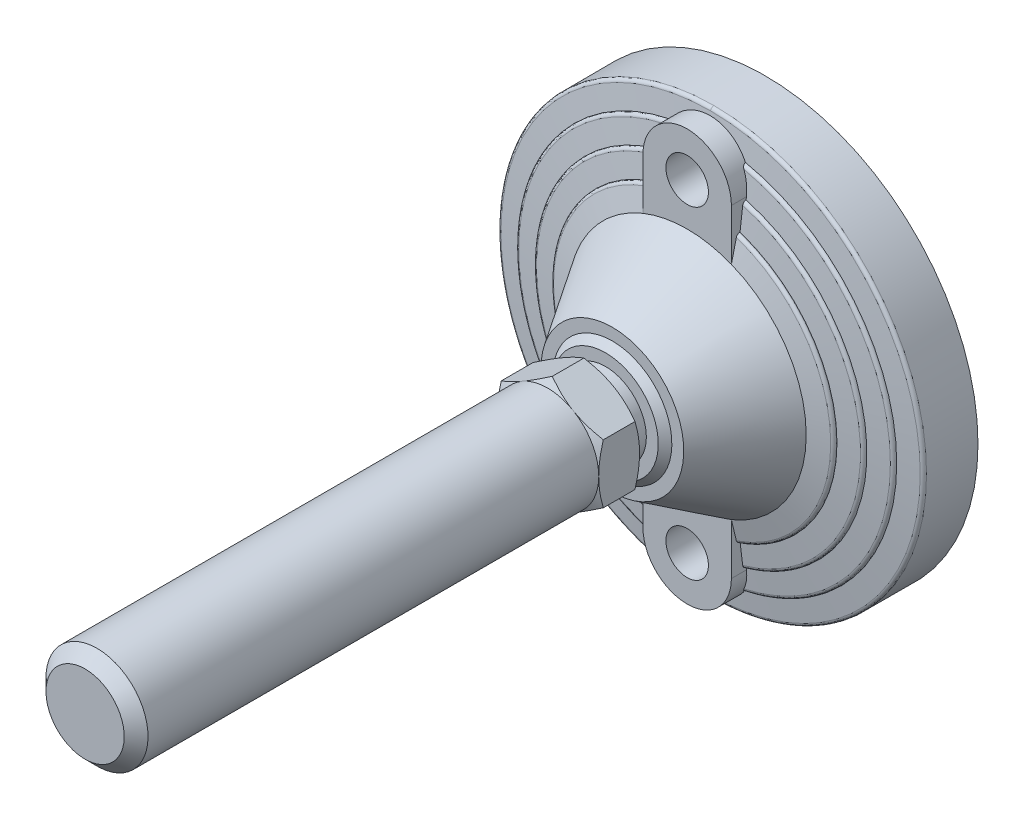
ISO-10303-21;
HEADER;
FILE_DESCRIPTION(('STEP AP214'),'2;1');
FILE_NAME('part.step','',(''),(''),'','','');
FILE_SCHEMA(('AUTOMOTIVE_DESIGN { 1 0 10303 214 1 1 1 1 }'));
ENDSEC;
DATA;
#1=APPLICATION_CONTEXT('core data for automotive mechanical design processes');
#2=APPLICATION_PROTOCOL_DEFINITION('international standard','automotive_design',2000,#1);
#3=PRODUCT_CONTEXT('',#1,'mechanical');
#4=PRODUCT('Part','Part','',(#3));
#5=PRODUCT_RELATED_PRODUCT_CATEGORY('part','',(#4));
#6=PRODUCT_DEFINITION_FORMATION('','',#4);
#7=PRODUCT_DEFINITION_CONTEXT('part definition',#1,'design');
#8=PRODUCT_DEFINITION('design','',#6,#7);
#9=PRODUCT_DEFINITION_SHAPE('','',#8);
#10=(LENGTH_UNIT() NAMED_UNIT(*) SI_UNIT(.MILLI.,.METRE.));
#11=(NAMED_UNIT(*) PLANE_ANGLE_UNIT() SI_UNIT($,.RADIAN.));
#12=(NAMED_UNIT(*) SI_UNIT($,.STERADIAN.) SOLID_ANGLE_UNIT());
#13=UNCERTAINTY_MEASURE_WITH_UNIT(LENGTH_MEASURE(1.E-05),#10,'distance_accuracy_value','');
#14=(GEOMETRIC_REPRESENTATION_CONTEXT(3) GLOBAL_UNCERTAINTY_ASSIGNED_CONTEXT((#13)) GLOBAL_UNIT_ASSIGNED_CONTEXT((#10,
#11,#12)) REPRESENTATION_CONTEXT('',''));
#15=CARTESIAN_POINT('',(0.,0.,0.));
#16=DIRECTION('',(0.,0.,1.));
#17=DIRECTION('',(1.,0.,0.));
#18=AXIS2_PLACEMENT_3D('',#15,#16,#17);
#19=CARTESIAN_POINT('',(-15.,17.528354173,52.));
#20=DIRECTION('',(0.,0.,1.));
#21=DIRECTION('',(0.,-1.,0.));
#22=AXIS2_PLACEMENT_3D('',#19,#20,#21);
#23=PLANE('',#22);
#24=CARTESIAN_POINT('',(0.,0.,52.));
#25=DIRECTION('',(0.,0.,-1.));
#26=DIRECTION('',(1.,0.,0.));
#27=AXIS2_PLACEMENT_3D('',#24,#25,#26);
#28=CIRCLE('',#27,12.);
#29=CARTESIAN_POINT('',(12.,0.,52.));
#30=VERTEX_POINT('',#29);
#31=EDGE_CURVE('E495',#30,#30,#28,.T.);
#32=ORIENTED_EDGE('',*,*,#31,.F.);
#33=EDGE_LOOP('',(#32));
#34=FACE_BOUND('',#33,.T.);
#35=CARTESIAN_POINT('',(0.,0.,52.));
#36=DIRECTION('',(0.,0.,1.));
#37=DIRECTION('',(0.,-1.,0.));
#38=AXIS2_PLACEMENT_3D('',#35,#36,#37);
#39=CIRCLE('',#38,15.);
#40=CARTESIAN_POINT('',(7.50000000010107,-12.9903810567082,52.));
#41=VERTEX_POINT('',#40);
#42=CARTESIAN_POINT('',(-7.50000000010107,-12.9903810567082,52.));
#43=VERTEX_POINT('',#42);
#44=EDGE_CURVE('E26',#41,#43,#39,.F.);
#45=ORIENTED_EDGE('',*,*,#44,.T.);
#46=CARTESIAN_POINT('',(-15.,0.,52.));
#47=VERTEX_POINT('',#46);
#48=EDGE_CURVE('E9',#43,#47,#39,.F.);
#49=ORIENTED_EDGE('',*,*,#48,.T.);
#50=CARTESIAN_POINT('',(-7.50000000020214,12.9903810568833,52.));
#51=VERTEX_POINT('',#50);
#52=EDGE_CURVE('E25',#47,#51,#39,.F.);
#53=ORIENTED_EDGE('',*,*,#52,.T.);
#54=CARTESIAN_POINT('',(7.50000000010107,12.9903810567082,52.));
#55=VERTEX_POINT('',#54);
#56=EDGE_CURVE('E239',#51,#55,#39,.F.);
#57=ORIENTED_EDGE('',*,*,#56,.T.);
#58=CARTESIAN_POINT('',(0.,0.,52.));
#59=DIRECTION('',(0.,0.,-1.));
#60=DIRECTION('',(0.,1.,0.));
#61=AXIS2_PLACEMENT_3D('',#58,#59,#60);
#62=CIRCLE('',#61,15.);
#63=CARTESIAN_POINT('',(15.,0.,52.));
#64=VERTEX_POINT('',#63);
#65=EDGE_CURVE('E253',#55,#64,#62,.T.);
#66=ORIENTED_EDGE('',*,*,#65,.T.);
#67=EDGE_CURVE('E262',#64,#41,#39,.F.);
#68=ORIENTED_EDGE('',*,*,#67,.T.);
#69=EDGE_LOOP('',(#45,#49,#53,#57,#66,#68));
#70=FACE_BOUND('',#69,.T.);
#71=ADVANCED_FACE('F14',(#34,#70),#23,.F.);
#72=CARTESIAN_POINT('',(0.,0.,52.));
#73=DIRECTION('',(0.,0.,-1.));
#74=DIRECTION('',(1.,0.,0.));
#75=AXIS2_PLACEMENT_3D('',#72,#73,#74);
#76=CYLINDRICAL_SURFACE('',#75,12.);
#77=CARTESIAN_POINT('',(0.,0.,47.));
#78=DIRECTION('',(0.,0.,-1.));
#79=DIRECTION('',(1.,0.,0.));
#80=AXIS2_PLACEMENT_3D('',#77,#78,#79);
#81=CIRCLE('',#80,12.);
#82=CARTESIAN_POINT('',(12.,0.,47.));
#83=VERTEX_POINT('',#82);
#84=EDGE_CURVE('E901',#83,#83,#81,.F.);
#85=ORIENTED_EDGE('',*,*,#84,.T.);
#86=EDGE_LOOP('',(#85));
#87=FACE_BOUND('',#86,.T.);
#88=ORIENTED_EDGE('',*,*,#31,.T.);
#89=EDGE_LOOP('',(#88));
#90=FACE_BOUND('',#89,.T.);
#91=ADVANCED_FACE('F515',(#87,#90),#76,.T.);
#92=CARTESIAN_POINT('',(-15.739975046,-15.686,47.));
#93=DIRECTION('',(0.,0.,-1.));
#94=DIRECTION('',(0.,1.,0.));
#95=AXIS2_PLACEMENT_3D('',#92,#93,#94);
#96=PLANE('',#95);
#97=ORIENTED_EDGE('',*,*,#84,.F.);
#98=EDGE_LOOP('',(#97));
#99=FACE_BOUND('',#98,.T.);
#100=CARTESIAN_POINT('',(0.,0.,47.));
#101=DIRECTION('',(0.,0.,-1.));
#102=DIRECTION('',(0.,1.,0.));
#103=AXIS2_PLACEMENT_3D('',#100,#101,#102);
#104=CIRCLE('',#103,15.5);
#105=CARTESIAN_POINT('',(0.,15.5,47.));
#106=VERTEX_POINT('',#105);
#107=EDGE_CURVE('E898',#106,#106,#104,.T.);
#108=ORIENTED_EDGE('',*,*,#107,.F.);
#109=EDGE_LOOP('',(#108));
#110=FACE_BOUND('',#109,.T.);
#111=ADVANCED_FACE('F518',(#99,#110),#96,.F.);
#112=CARTESIAN_POINT('',(0.,0.,47.));
#113=DIRECTION('',(0.,0.,-1.));
#114=DIRECTION('',(0.,1.,0.));
#115=AXIS2_PLACEMENT_3D('',#112,#113,#114);
#116=CONICAL_SURFACE('',#115,15.5,0.785398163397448);
#117=CARTESIAN_POINT('',(0.,0.,45.));
#118=DIRECTION('',(0.,0.,-1.));
#119=DIRECTION('',(0.,1.,0.));
#120=AXIS2_PLACEMENT_3D('',#117,#118,#119);
#121=CIRCLE('',#120,17.5);
#122=CARTESIAN_POINT('',(0.,17.5,45.));
#123=VERTEX_POINT('',#122);
#124=EDGE_CURVE('E893',#123,#123,#121,.F.);
#125=ORIENTED_EDGE('',*,*,#124,.T.);
#126=EDGE_LOOP('',(#125));
#127=FACE_BOUND('',#126,.T.);
#128=ORIENTED_EDGE('',*,*,#107,.T.);
#129=EDGE_LOOP('',(#128));
#130=FACE_BOUND('',#129,.T.);
#131=ADVANCED_FACE('F521',(#127,#130),#116,.T.);
#132=CARTESIAN_POINT('',(0.,-47.5,0.));
#133=DIRECTION('',(0.,0.,1.));
#134=DIRECTION('',(0.,-1.,0.));
#135=AXIS2_PLACEMENT_3D('',#132,#133,#134);
#136=CYLINDRICAL_SURFACE('',#135,6.25);
#137=CARTESIAN_POINT('',(0.,-47.5,0.));
#138=DIRECTION('',(0.,0.,1.));
#139=DIRECTION('',(0.,-1.,0.));
#140=AXIS2_PLACEMENT_3D('',#137,#138,#139);
#141=CIRCLE('',#140,6.25);
#142=CARTESIAN_POINT('',(0.,-53.75,0.));
#143=VERTEX_POINT('',#142);
#144=EDGE_CURVE('E890',#143,#143,#141,.F.);
#145=ORIENTED_EDGE('',*,*,#144,.T.);
#146=EDGE_LOOP('',(#145));
#147=FACE_BOUND('',#146,.T.);
#148=CARTESIAN_POINT('',(0.,-47.5,23.));
#149=DIRECTION('',(0.,0.,1.));
#150=DIRECTION('',(0.,-1.,0.));
#151=AXIS2_PLACEMENT_3D('',#148,#149,#150);
#152=CIRCLE('',#151,6.25);
#153=CARTESIAN_POINT('',(0.,-53.75,23.));
#154=VERTEX_POINT('',#153);
#155=EDGE_CURVE('E368',#154,#154,#152,.T.);
#156=ORIENTED_EDGE('',*,*,#155,.T.);
#157=EDGE_LOOP('',(#156));
#158=FACE_BOUND('',#157,.T.);
#159=ADVANCED_FACE('F527',(#147,#158),#136,.F.);
#160=CARTESIAN_POINT('',(-21.325127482,-21.252,45.));
#161=DIRECTION('',(0.,0.,-1.));
#162=DIRECTION('',(0.,1.,0.));
#163=AXIS2_PLACEMENT_3D('',#160,#161,#162);
#164=PLANE('',#163);
#165=ORIENTED_EDGE('',*,*,#124,.F.);
#166=EDGE_LOOP('',(#165));
#167=FACE_BOUND('',#166,.T.);
#168=CARTESIAN_POINT('',(0.,0.,45.));
#169=DIRECTION('',(0.,0.,-1.));
#170=DIRECTION('',(0.,1.,0.));
#171=AXIS2_PLACEMENT_3D('',#168,#169,#170);
#172=CIRCLE('',#171,21.);
#173=CARTESIAN_POINT('',(0.,21.,45.));
#174=VERTEX_POINT('',#173);
#175=EDGE_CURVE('E469',#174,#174,#172,.T.);
#176=ORIENTED_EDGE('',*,*,#175,.F.);
#177=EDGE_LOOP('',(#176));
#178=FACE_BOUND('',#177,.T.);
#179=ADVANCED_FACE('F523',(#167,#178),#164,.F.);
#180=CARTESIAN_POINT('',(-63.467641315,63.25,0.));
#181=DIRECTION('',(0.,0.,1.));
#182=DIRECTION('',(0.,-1.,0.));
#183=AXIS2_PLACEMENT_3D('',#180,#181,#182);
#184=PLANE('',#183);
#185=ORIENTED_EDGE('',*,*,#144,.F.);
#186=EDGE_LOOP('',(#185));
#187=FACE_BOUND('',#186,.T.);
#188=CARTESIAN_POINT('',(0.,47.5,0.));
#189=DIRECTION('',(0.,0.,1.));
#190=DIRECTION('',(0.,-1.,0.));
#191=AXIS2_PLACEMENT_3D('',#188,#189,#190);
#192=CIRCLE('',#191,6.25);
#193=CARTESIAN_POINT('',(0.,41.25,0.));
#194=VERTEX_POINT('',#193);
#195=EDGE_CURVE('E855',#194,#194,#192,.T.);
#196=ORIENTED_EDGE('',*,*,#195,.T.);
#197=EDGE_LOOP('',(#196));
#198=FACE_BOUND('',#197,.T.);
#199=CARTESIAN_POINT('',(0.,0.,0.));
#200=DIRECTION('',(0.,0.,-1.));
#201=DIRECTION('',(1.,0.,0.));
#202=AXIS2_PLACEMENT_3D('',#199,#200,#201);
#203=CIRCLE('',#202,62.5);
#204=CARTESIAN_POINT('',(62.5,0.,0.));
#205=VERTEX_POINT('',#204);
#206=EDGE_CURVE('E477',#205,#205,#203,.F.);
#207=ORIENTED_EDGE('',*,*,#206,.F.);
#208=EDGE_LOOP('',(#207));
#209=FACE_BOUND('',#208,.T.);
#210=ADVANCED_FACE('F526',(#187,#198,#209),#184,.F.);
#211=CARTESIAN_POINT('',(0.,0.,23.));
#212=DIRECTION('',(0.,0.,-1.));
#213=DIRECTION('',(0.,1.,0.));
#214=AXIS2_PLACEMENT_3D('',#211,#212,#213);
#215=CONICAL_SURFACE('',#214,35.,1.32154418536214);
#216=CARTESIAN_POINT('',(0.,0.,23.));
#217=DIRECTION('',(0.,0.,-1.));
#218=DIRECTION('',(0.,1.,0.));
#219=AXIS2_PLACEMENT_3D('',#216,#217,#218);
#220=CIRCLE('',#219,35.);
#221=CARTESIAN_POINT('',(12.9999999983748,-32.4961536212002,22.9999999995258));
#222=VERTEX_POINT('',#221);
#223=CARTESIAN_POINT('',(13.0000000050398,32.4961536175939,22.9999999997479));
#224=VERTEX_POINT('',#223);
#225=EDGE_CURVE('E466',#222,#224,#220,.F.);
#226=ORIENTED_EDGE('',*,*,#225,.F.);
#227=CARTESIAN_POINT('',(13.0000000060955,-38.6172483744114,21.5372089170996));
#228=CARTESIAN_POINT('',(13.0000000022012,-38.1074186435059,21.6602002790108));
#229=CARTESIAN_POINT('',(13.0000000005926,-37.5975329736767,21.7829600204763));
#230=CARTESIAN_POINT('',(12.9999999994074,-36.5776365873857,22.0279559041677));
#231=CARTESIAN_POINT('',(12.9999999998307,-36.0676258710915,22.1501920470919));
#232=CARTESIAN_POINT('',(13.0000000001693,-35.0474647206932,22.3940807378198));
#233=CARTESIAN_POINT('',(13.0000000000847,-34.5373142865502,22.5157332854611));
#234=CARTESIAN_POINT('',(12.9999999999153,-33.5168560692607,22.7583795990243));
#235=CARTESIAN_POINT('',(12.9999999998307,-33.0065482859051,22.8793733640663));
#236=CARTESIAN_POINT('',(13.,-32.496153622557,22.9999999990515));
#237=B_SPLINE_CURVE_WITH_KNOTS('',3,(#227,#228,#229,#230,#231,#232,#233,#234,#235,#236),
.UNSPECIFIED.,.F.,.F.,(4,2,2,2,4),(0.,1.57336555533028,3.14672901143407,4.72009290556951,
6.2934589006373),.UNSPECIFIED.);
#238=CARTESIAN_POINT('',(13.,-38.6172483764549,21.5372089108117));
#239=VERTEX_POINT('',#238);
#240=EDGE_CURVE('E577',#239,#222,#237,.T.);
#241=ORIENTED_EDGE('',*,*,#240,.F.);
#242=CARTESIAN_POINT('',(0.,0.,21.53720891));
#243=DIRECTION('',(0.,0.,-1.));
#244=DIRECTION('',(0.,1.,0.));
#245=AXIS2_PLACEMENT_3D('',#242,#243,#244);
#246=CIRCLE('',#245,40.746679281);
#247=CARTESIAN_POINT('',(13.,38.6172483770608,21.5372089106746));
#248=VERTEX_POINT('',#247);
#249=EDGE_CURVE('E487',#248,#239,#246,.T.);
#250=ORIENTED_EDGE('',*,*,#249,.F.);
#251=CARTESIAN_POINT('',(13.,32.4961536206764,22.999999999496));
#252=CARTESIAN_POINT('',(13.,33.0065482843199,22.8793733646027));
#253=CARTESIAN_POINT('',(13.,33.5168560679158,22.758379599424));
#254=CARTESIAN_POINT('',(13.,34.5373142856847,22.515733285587));
#255=CARTESIAN_POINT('',(13.,35.0474647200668,22.3940807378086));
#256=CARTESIAN_POINT('',(13.,36.0676258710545,22.1501920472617));
#257=CARTESIAN_POINT('',(13.,36.577636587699,22.0279559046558));
#258=CARTESIAN_POINT('',(13.,37.597532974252,21.7829600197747));
#259=CARTESIAN_POINT('',(13.,38.1074186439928,21.6602002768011));
#260=CARTESIAN_POINT('',(13.,38.6172483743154,21.5372089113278));
#261=B_SPLINE_CURVE_WITH_KNOTS('',3,(#251,#252,#253,#254,#255,#256,#257,#258,#259,#260),
.UNSPECIFIED.,.F.,.F.,(4,2,2,2,4),(0.,1.57336599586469,3.1467298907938,4.72009334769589,
6.29345890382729),.UNSPECIFIED.);
#262=EDGE_CURVE('E850',#224,#248,#261,.T.);
#263=ORIENTED_EDGE('',*,*,#262,.F.);
#264=EDGE_LOOP('',(#226,#241,#250,#263));
#265=FACE_BOUND('',#264,.T.);
#266=ADVANCED_FACE('F531',(#265),#215,.T.);
#267=CARTESIAN_POINT('',(12.406354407,39.602176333,20.568111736));
#268=CARTESIAN_POINT('',(59.707464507,24.78394183,20.568111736));
#269=CARTESIAN_POINT('',(59.707464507,-24.78394183,20.568111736));
#270=CARTESIAN_POINT('',(12.406354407,-39.602176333,20.568111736));
#271=CARTESIAN_POINT('',(12.406354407,39.602176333,21.044046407));
#272=CARTESIAN_POINT('',(59.707464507,24.78394183,21.044046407));
#273=CARTESIAN_POINT('',(59.707464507,-24.78394183,21.044046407));
#274=CARTESIAN_POINT('',(12.406354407,-39.602176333,21.044046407));
#275=CARTESIAN_POINT('',(12.31903347,39.323440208,21.419805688));
#276=CARTESIAN_POINT('',(59.287219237,24.609502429,21.419805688));
#277=CARTESIAN_POINT('',(59.287219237,-24.609502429,21.419805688));
#278=CARTESIAN_POINT('',(12.31903347,-39.323440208,21.419805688));
#279=CARTESIAN_POINT('',(12.18115046,38.883305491,21.53720891));
#280=CARTESIAN_POINT('',(58.623636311,24.334056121,21.53720891));
#281=CARTESIAN_POINT('',(58.623636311,-24.334056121,21.53720891));
#282=CARTESIAN_POINT('',(12.18115046,-38.883305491,21.53720891));
#283=(BOUNDED_SURFACE() B_SPLINE_SURFACE(3,3,((#267,#268,#269,#270),(#271,#272,#273,#274),(#275,
#276,#277,#278),(#279,#280,#281,#282)),.UNSPECIFIED.,.F.,.F.,
.F.) B_SPLINE_SURFACE_WITH_KNOTS((4,4),(4,4),(0.,1.),(0.,1.),
.UNSPECIFIED.) GEOMETRIC_REPRESENTATION_ITEM() RATIONAL_B_SPLINE_SURFACE(((1.,0.532632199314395,
0.532632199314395,1.),(0.85967907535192,0.457892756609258,0.457892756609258,0.85967907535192),
(0.85967907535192,0.457892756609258,0.457892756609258,0.85967907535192),(1.,0.532632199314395,
0.532632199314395,1.))) REPRESENTATION_ITEM('') SURFACE());
#284=CARTESIAN_POINT('',(13.,-39.4112927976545,20.5681117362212));
#285=CARTESIAN_POINT('',(13.,-39.411293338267,20.5952104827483));
#286=CARTESIAN_POINT('',(13.,-39.4101321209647,20.6222958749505));
#287=CARTESIAN_POINT('',(13.,-39.4055044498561,20.6762650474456));
#288=CARTESIAN_POINT('',(13.,-39.4020383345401,20.7031488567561));
#289=CARTESIAN_POINT('',(13.,-39.3882336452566,20.7831079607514));
#290=CARTESIAN_POINT('',(13.,-39.3744885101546,20.8356344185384));
#291=CARTESIAN_POINT('',(13.,-39.3384084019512,20.9376087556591));
#292=CARTESIAN_POINT('',(13.,-39.3160736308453,20.9870567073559));
#293=CARTESIAN_POINT('',(13.,-39.2635909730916,21.081601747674));
#294=CARTESIAN_POINT('',(13.,-39.233444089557,21.1266993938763));
#295=CARTESIAN_POINT('',(13.,-39.165605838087,21.2123360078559));
#296=CARTESIAN_POINT('',(13.,-39.1277714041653,21.2527614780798));
#297=CARTESIAN_POINT('',(13.,-39.0461074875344,21.3270714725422));
#298=CARTESIAN_POINT('',(13.,-39.0022718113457,21.360949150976));
#299=CARTESIAN_POINT('',(13.,-38.9043172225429,21.425052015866));
#300=CARTESIAN_POINT('',(13.,-38.8495953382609,21.4543647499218));
#301=CARTESIAN_POINT('',(13.,-38.7644641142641,21.4909906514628));
#302=CARTESIAN_POINT('',(13.,-38.7355751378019,21.5019763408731));
#303=CARTESIAN_POINT('',(13.,-38.6769796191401,21.5214626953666));
#304=CARTESIAN_POINT('',(13.,-38.6472733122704,21.5299640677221));
#305=CARTESIAN_POINT('',(13.,-38.6172483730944,21.5372089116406));
#306=B_SPLINE_CURVE_WITH_KNOTS('',3,(#284,#285,#286,#287,#288,#289,#290,#291,#292,#293,#294,
#295,#296,#297,#298,#299,#300,#301,#302,#303,#304,#305),.UNSPECIFIED.,.F.,.F.,(4,2,2,2,2,2,2,2,
2,2,4),(0.,0.0812450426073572,0.162478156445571,0.324519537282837,0.486557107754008,
0.648573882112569,0.813939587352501,0.979477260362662,1.16468654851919,1.25731455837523,
1.34991617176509),.UNSPECIFIED.);
#307=CARTESIAN_POINT('',(13.,-39.4112928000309,20.5681117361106));
#308=VERTEX_POINT('',#307);
#309=EDGE_CURVE('E364',#308,#239,#306,.T.);
#310=CARTESIAN_POINT('',(0.,0.,20.568111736));
#311=DIRECTION('',(0.,0.,-1.));
#312=DIRECTION('',(0.,1.,0.));
#313=AXIS2_PLACEMENT_3D('',#310,#311,#312);
#314=CIRCLE('',#313,41.5);
#315=CARTESIAN_POINT('',(13.,39.4112928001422,20.5681117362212));
#316=VERTEX_POINT('',#315);
#317=EDGE_CURVE('E485',#316,#308,#314,.T.);
#318=CARTESIAN_POINT('',(13.,38.6172483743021,21.5372089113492));
#319=CARTESIAN_POINT('',(13.,38.6757273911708,21.5231434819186));
#320=CARTESIAN_POINT('',(13.,38.7330575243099,21.5042077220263));
#321=CARTESIAN_POINT('',(13.,38.8438981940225,21.4570874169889));
#322=CARTESIAN_POINT('',(13.,38.8974017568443,21.4288864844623));
#323=CARTESIAN_POINT('',(13.,38.9989209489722,21.363734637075));
#324=CARTESIAN_POINT('',(13.,39.0469285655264,21.3267711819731));
#325=CARTESIAN_POINT('',(13.,39.135707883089,21.2450475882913));
#326=CARTESIAN_POINT('',(13.,39.1764870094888,21.2002955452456));
#327=CARTESIAN_POINT('',(13.,39.247988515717,21.1059931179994));
#328=CARTESIAN_POINT('',(13.,39.2790300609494,21.0566848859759));
#329=CARTESIAN_POINT('',(13.,39.3318958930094,20.9533393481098));
#330=CARTESIAN_POINT('',(13.,39.3537228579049,20.899303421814));
#331=CARTESIAN_POINT('',(13.,39.3839717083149,20.7991363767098));
#332=CARTESIAN_POINT('',(13.,39.3941848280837,20.7535382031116));
#333=CARTESIAN_POINT('',(13.,39.4078594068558,20.6613400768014));
#334=CARTESIAN_POINT('',(13.,39.411320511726,20.6147400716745));
#335=CARTESIAN_POINT('',(13.,39.4112927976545,20.5681117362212));
#336=B_SPLINE_CURVE_WITH_KNOTS('',3,(#318,#319,#320,#321,#322,#323,#324,#325,#326,#327,#328,
#329,#330,#331,#332,#333,#334,#335),.UNSPECIFIED.,.F.,.F.,(4,2,2,2,2,2,2,2,4),(0.,
0.180276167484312,0.360872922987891,0.541729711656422,0.722399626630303,0.896310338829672,
1.07017047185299,1.20986981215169,1.34957647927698),.UNSPECIFIED.);
#337=EDGE_CURVE('E373',#248,#316,#336,.T.);
#338=ORIENTED_EDGE('',*,*,#249,.T.);
#339=ORIENTED_EDGE('',*,*,#309,.F.);
#340=ORIENTED_EDGE('',*,*,#317,.F.);
#341=ORIENTED_EDGE('',*,*,#337,.F.);
#342=EDGE_LOOP('',(#338,#339,#340,#341));
#343=FACE_BOUND('',#342,.T.);
#344=ADVANCED_FACE('F889',(#343),#283,.T.);
#345=CARTESIAN_POINT('',(0.,0.,20.568111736));
#346=DIRECTION('',(0.,0.,-1.));
#347=DIRECTION('',(0.,1.,0.));
#348=AXIS2_PLACEMENT_3D('',#345,#346,#347);
#349=CYLINDRICAL_SURFACE('',#348,41.5);
#350=CARTESIAN_POINT('',(0.,0.,20.454545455));
#351=DIRECTION('',(0.,0.,-1.));
#352=DIRECTION('',(0.,1.,0.));
#353=AXIS2_PLACEMENT_3D('',#350,#351,#352);
#354=CIRCLE('',#353,41.5);
#355=CARTESIAN_POINT('',(13.,39.4112928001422,20.454545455));
#356=VERTEX_POINT('',#355);
#357=CARTESIAN_POINT('',(13.,-39.4112928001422,20.4545454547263));
#358=VERTEX_POINT('',#357);
#359=EDGE_CURVE('E360',#356,#358,#354,.T.);
#360=ORIENTED_EDGE('',*,*,#359,.F.);
#361=DIRECTION('',(0.,0.,-1.));
#362=VECTOR('',#361,1.);
#363=CARTESIAN_POINT('',(13.,39.4112928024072,20.7755712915));
#364=LINE('',#363,#362);
#365=EDGE_CURVE('E369',#316,#356,#364,.T.);
#366=ORIENTED_EDGE('',*,*,#365,.F.);
#367=ORIENTED_EDGE('',*,*,#317,.T.);
#368=DIRECTION('',(0.,0.,1.));
#369=VECTOR('',#368,1.);
#370=CARTESIAN_POINT('',(13.,-39.4112928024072,20.7755712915));
#371=LINE('',#370,#369);
#372=EDGE_CURVE('E361',#358,#308,#371,.T.);
#373=ORIENTED_EDGE('',*,*,#372,.F.);
#374=EDGE_LOOP('',(#360,#366,#367,#373));
#375=FACE_BOUND('',#374,.T.);
#376=ADVANCED_FACE('F887',(#375),#349,.T.);
#377=CARTESIAN_POINT('',(0.,0.,20.454545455));
#378=DIRECTION('',(0.,0.,-1.));
#379=DIRECTION('',(0.,1.,0.));
#380=AXIS2_PLACEMENT_3D('',#377,#378,#379);
#381=CONICAL_SURFACE('',#380,41.5,1.4442041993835);
#382=ORIENTED_EDGE('',*,*,#359,.T.);
#383=CARTESIAN_POINT('',(13.0000000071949,-45.8176832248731,19.6748403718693));
#384=CARTESIAN_POINT('',(13.0000000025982,-45.2838642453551,19.7402005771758));
#385=CARTESIAN_POINT('',(13.0000000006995,-44.7500350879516,19.8054777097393));
#386=CARTESIAN_POINT('',(12.9999999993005,-43.6823542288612,19.9358466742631));
#387=CARTESIAN_POINT('',(12.9999999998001,-43.1485025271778,20.0009385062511));
#388=CARTESIAN_POINT('',(13.0000000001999,-42.0807742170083,20.1309177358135));
#389=CARTESIAN_POINT('',(13.0000000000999,-41.5468976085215,20.1958051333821));
#390=CARTESIAN_POINT('',(12.9999999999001,-40.4791166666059,20.3253520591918));
#391=CARTESIAN_POINT('',(12.9999999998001,-39.9452123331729,20.390011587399));
#392=CARTESIAN_POINT('',(13.,-39.4112928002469,20.4545454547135));
#393=B_SPLINE_CURVE_WITH_KNOTS('',3,(#383,#384,#385,#386,#387,#388,#389,#390,#391,#392),
.UNSPECIFIED.,.F.,.F.,(4,2,2,2,4),(0.,1.61341623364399,3.22683222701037,4.84024826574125,
6.45366454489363),.UNSPECIFIED.);
#394=CARTESIAN_POINT('',(13.,-45.8176832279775,19.6748403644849));
#395=VERTEX_POINT('',#394);
#396=EDGE_CURVE('E365',#395,#358,#393,.T.);
#397=ORIENTED_EDGE('',*,*,#396,.F.);
#398=CARTESIAN_POINT('',(-7.48558333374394E-10,0.,19.674840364));
#399=DIRECTION('',(0.,0.,-1.));
#400=DIRECTION('',(0.,1.,0.));
#401=AXIS2_PLACEMENT_3D('',#398,#399,#400);
#402=CIRCLE('',#401,47.6262542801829);
#403=CARTESIAN_POINT('',(13.,45.8176832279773,19.6748403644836));
#404=VERTEX_POINT('',#403);
#405=EDGE_CURVE('E357',#404,#395,#402,.T.);
#406=ORIENTED_EDGE('',*,*,#405,.F.);
#407=CARTESIAN_POINT('',(12.999999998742,39.4112928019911,20.4545454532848));
#408=CARTESIAN_POINT('',(12.9999999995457,39.9452123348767,20.3900115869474));
#409=CARTESIAN_POINT('',(12.9999999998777,40.4791166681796,20.3253520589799));
#410=CARTESIAN_POINT('',(13.0000000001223,41.5468976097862,20.1958051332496));
#411=CARTESIAN_POINT('',(13.0000000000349,42.080774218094,20.1309177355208));
#412=CARTESIAN_POINT('',(12.9999999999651,43.1485025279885,20.000938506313));
#413=CARTESIAN_POINT('',(12.9999999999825,43.6823542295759,19.9358466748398));
#414=CARTESIAN_POINT('',(13.0000000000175,44.7500350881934,19.8054777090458));
#415=CARTESIAN_POINT('',(13.0000000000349,45.2838642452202,19.7402005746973));
#416=CARTESIAN_POINT('',(13.,45.817683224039,19.6748403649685));
#417=B_SPLINE_CURVE_WITH_KNOTS('',3,(#407,#408,#409,#410,#411,#412,#413,#414,#415,#416),
.UNSPECIFIED.,.F.,.F.,(4,2,2,2,4),(0.,1.61341627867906,3.226832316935,4.84024830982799,
6.45366454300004),.UNSPECIFIED.);
#418=EDGE_CURVE('E372',#356,#404,#417,.T.);
#419=ORIENTED_EDGE('',*,*,#418,.F.);
#420=EDGE_LOOP('',(#382,#397,#406,#419));
#421=FACE_BOUND('',#420,.T.);
#422=ADVANCED_FACE('F591',(#421),#381,.T.);
#423=CARTESIAN_POINT('',(12.269850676,46.922284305,18.669623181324));
#424=CARTESIAN_POINT('',(72.557631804,31.157449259,18.6696231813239));
#425=CARTESIAN_POINT('',(72.557631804,-31.157449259,18.6696231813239));
#426=CARTESIAN_POINT('',(12.269850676,-46.922284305,18.669623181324));
#427=CARTESIAN_POINT('',(12.269850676,46.922284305,18.6740296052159));
#428=CARTESIAN_POINT('',(72.557631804,31.157449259,18.674029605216));
#429=CARTESIAN_POINT('',(72.557631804,-31.157449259,18.674029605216));
#430=CARTESIAN_POINT('',(12.269850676,-46.922284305,18.6740296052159));
#431=CARTESIAN_POINT('',(12.269850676,46.922284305,18.678436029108));
#432=CARTESIAN_POINT('',(72.557631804,31.157449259,18.678436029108));
#433=CARTESIAN_POINT('',(72.557631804,-31.157449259,18.678436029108));
#434=CARTESIAN_POINT('',(12.269850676,-46.922284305,18.678436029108));
#435=CARTESIAN_POINT('',(12.269850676,46.922284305,18.682842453));
#436=CARTESIAN_POINT('',(72.557631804,31.157449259,18.682842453));
#437=CARTESIAN_POINT('',(72.557631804,-31.157449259,18.682842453));
#438=CARTESIAN_POINT('',(12.269850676,-46.922284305,18.682842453));
#439=CARTESIAN_POINT('',(12.269850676,46.922284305,19.211436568));
#440=CARTESIAN_POINT('',(72.557631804,31.157449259,19.211436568));
#441=CARTESIAN_POINT('',(72.557631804,-31.157449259,19.211436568));
#442=CARTESIAN_POINT('',(12.269850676,-46.922284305,19.211436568));
#443=CARTESIAN_POINT('',(12.181461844,46.584268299,19.608103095));
#444=CARTESIAN_POINT('',(72.034945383,30.93299905,19.608103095));
#445=CARTESIAN_POINT('',(72.034945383,-30.93299905,19.608103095));
#446=CARTESIAN_POINT('',(12.181461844,-46.584268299,19.608103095));
#447=CARTESIAN_POINT('',(12.048804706,46.076961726,19.674840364));
#448=CARTESIAN_POINT('',(71.250478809,30.596136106,19.674840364));
#449=CARTESIAN_POINT('',(71.250478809,-30.596136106,19.674840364));
#450=CARTESIAN_POINT('',(12.048804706,-46.076961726,19.674840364));
#451=(BOUNDED_SURFACE() B_SPLINE_SURFACE(3,3,((#423,#424,#425,#426),(#427,#428,#429,#430),(#431,
#432,#433,#434),(#435,#436,#437,#438),(#439,#440,#441,#442),(#443,#444,#445,#446),(#447,#448,
#449,#450)),.UNSPECIFIED.,.F.,.F.,.F.) B_SPLINE_SURFACE_WITH_KNOTS((4,3,4),(4,4),(-0.01,0.,1.),
(0.,1.),.UNSPECIFIED.) GEOMETRIC_REPRESENTATION_ITEM() RATIONAL_B_SPLINE_SURFACE(((1.,
0.501991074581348,0.501991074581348,1.),(1.,0.501991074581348,0.501991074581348,1.),(1.,
0.501991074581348,0.501991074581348,1.),(1.,0.501991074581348,0.501991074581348,1.),
(0.833611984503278,0.418465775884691,0.418465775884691,0.833611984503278),(0.833611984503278,
0.418465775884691,0.418465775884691,0.833611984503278),(1.,0.501991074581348,0.501991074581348,1.))) REPRESENTATION_ITEM('') SURFACE());
#452=CARTESIAN_POINT('',(13.,-46.7252608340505,18.6777848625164));
#453=CARTESIAN_POINT('',(13.,-46.7253979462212,18.7054287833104));
#454=CARTESIAN_POINT('',(13.,-46.7243484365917,18.7330653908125));
#455=CARTESIAN_POINT('',(13.,-46.719887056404,18.788143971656));
#456=CARTESIAN_POINT('',(13.,-46.7164754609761,18.8155859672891));
#457=CARTESIAN_POINT('',(13.,-46.7027375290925,18.8972169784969));
#458=CARTESIAN_POINT('',(13.,-46.688908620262,18.9508576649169));
#459=CARTESIAN_POINT('',(13.,-46.6523707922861,19.0550506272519));
#460=CARTESIAN_POINT('',(13.,-46.6296523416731,19.1055995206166));
#461=CARTESIAN_POINT('',(13.,-46.5760978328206,19.2021956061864));
#462=CARTESIAN_POINT('',(13.,-46.545261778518,19.2482428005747));
#463=CARTESIAN_POINT('',(13.,-46.4762858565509,19.3348542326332));
#464=CARTESIAN_POINT('',(13.,-46.438110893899,19.3753904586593));
#465=CARTESIAN_POINT('',(13.,-46.3556866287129,19.4497572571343));
#466=CARTESIAN_POINT('',(13.,-46.311434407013,19.4835845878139));
#467=CARTESIAN_POINT('',(13.,-46.2164675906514,19.5448274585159));
#468=CARTESIAN_POINT('',(13.,-46.1655796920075,19.5719736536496));
#469=CARTESIAN_POINT('',(13.,-46.0601083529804,19.6176355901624));
#470=CARTESIAN_POINT('',(13.,-46.0055288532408,19.6361603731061));
#471=CARTESIAN_POINT('',(13.,-45.9281089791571,19.6556819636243));
#472=CARTESIAN_POINT('',(13.,-45.9061721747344,19.6604842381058));
#473=CARTESIAN_POINT('',(13.,-45.8620822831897,19.6686997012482));
#474=CARTESIAN_POINT('',(13.,-45.8399296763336,19.672115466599));
#475=CARTESIAN_POINT('',(13.0000000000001,-45.817683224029,19.674840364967));
#476=B_SPLINE_CURVE_WITH_KNOTS('',3,(#452,#453,#454,#455,#456,#457,#458,#459,#460,#461,#462,
#463,#464,#465,#466,#467,#468,#469,#470,#471,#472,#473,#474,#475),.UNSPECIFIED.,.F.,.F.,(4,2,2,
2,2,2,2,2,2,2,2,4),(0.,0.0828810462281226,0.165752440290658,0.331061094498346,0.496547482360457,
0.662033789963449,0.828332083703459,0.99471053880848,1.1669783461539,1.33906508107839,
1.40639957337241,1.47360835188),.UNSPECIFIED.);
#477=CARTESIAN_POINT('',(13.0000000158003,-46.7252608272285,18.6777848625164));
#478=VERTEX_POINT('',#477);
#479=EDGE_CURVE('E576',#478,#395,#476,.T.);
#480=CARTESIAN_POINT('',(13.0000000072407,46.725260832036,18.6727272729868));
#481=CARTESIAN_POINT('',(13.3212147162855,46.6358917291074,18.6727272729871));
#482=CARTESIAN_POINT('',(13.6414983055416,46.543212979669,18.6727272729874));
#483=CARTESIAN_POINT('',(14.2801231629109,46.3512597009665,18.672727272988));
#484=CARTESIAN_POINT('',(14.5984642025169,46.2519844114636,18.6727272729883));
#485=CARTESIAN_POINT('',(15.5526106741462,45.9435979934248,18.6727272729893));
#486=CARTESIAN_POINT('',(16.1852411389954,45.7245656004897,18.6727272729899));
#487=CARTESIAN_POINT('',(17.4409289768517,45.260491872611,18.6727272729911));
#488=CARTESIAN_POINT('',(18.0639854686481,45.0154481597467,18.6727272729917));
#489=CARTESIAN_POINT('',(19.3000708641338,44.4995075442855,18.672727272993));
#490=CARTESIAN_POINT('',(19.9130888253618,44.228584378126,18.6727272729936));
#491=CARTESIAN_POINT('',(21.1274202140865,43.6615551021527,18.6727272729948));
#492=CARTESIAN_POINT('',(21.7287319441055,43.3654453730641,18.6727272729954));
#493=CARTESIAN_POINT('',(23.5288179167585,42.4321391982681,18.6727272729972));
#494=CARTESIAN_POINT('',(24.70797851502,41.7565378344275,18.6727272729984));
#495=CARTESIAN_POINT('',(27.0057517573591,40.3086198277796,18.6727272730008));
#496=CARTESIAN_POINT('',(28.124340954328,39.5362661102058,18.672727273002));
#497=CARTESIAN_POINT('',(30.2940548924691,37.899455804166,18.6727272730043));
#498=CARTESIAN_POINT('',(31.3451007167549,37.0348945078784,18.6727272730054));
#499=CARTESIAN_POINT('',(33.3707378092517,35.220625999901,18.6727272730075));
#500=CARTESIAN_POINT('',(34.3453363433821,34.2709268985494,18.6727272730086));
#501=CARTESIAN_POINT('',(36.21413180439,32.2900336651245,18.6727272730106));
#502=CARTESIAN_POINT('',(37.1080775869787,31.2586025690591,18.6727272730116));
#503=CARTESIAN_POINT('',(38.8059105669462,29.1240638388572,18.6727272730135));
#504=CARTESIAN_POINT('',(39.6097954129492,28.0209543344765,18.6727272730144));
#505=CARTESIAN_POINT('',(41.1215543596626,25.7512426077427,18.6727272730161));
#506=CARTESIAN_POINT('',(41.8294551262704,24.5846581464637,18.6727272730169));
#507=CARTESIAN_POINT('',(43.1444737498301,22.196015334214,18.6727272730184));
#508=CARTESIAN_POINT('',(43.7515922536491,20.9739573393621,18.6727272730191));
#509=CARTESIAN_POINT('',(44.8608053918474,18.4828923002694,18.6727272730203));
#510=CARTESIAN_POINT('',(45.362887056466,17.2138794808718,18.6727272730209));
#511=CARTESIAN_POINT('',(46.2583633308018,14.6380667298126,18.6727272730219));
#512=CARTESIAN_POINT('',(46.6517577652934,13.3312667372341,18.6727272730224));
#513=CARTESIAN_POINT('',(47.3270705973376,10.6891374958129,18.6727272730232));
#514=CARTESIAN_POINT('',(47.6089860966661,9.35380750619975,18.6727272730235));
#515=CARTESIAN_POINT('',(48.0593220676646,6.66414532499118,18.672727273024));
#516=CARTESIAN_POINT('',(48.2277425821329,5.30981314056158,18.6727272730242));
#517=CARTESIAN_POINT('',(48.4498861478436,2.59183878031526,18.6727272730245));
#518=CARTESIAN_POINT('',(48.5036145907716,1.22819704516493,18.6727272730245));
#519=CARTESIAN_POINT('',(48.4960080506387,-1.49876561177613,18.6727272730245));
#520=CARTESIAN_POINT('',(48.4346730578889,-2.86208653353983,18.6727272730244));
#521=CARTESIAN_POINT('',(48.197367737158,-5.57880747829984,18.6727272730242));
#522=CARTESIAN_POINT('',(48.0213896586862,-6.93220682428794,18.672727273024));
#523=CARTESIAN_POINT('',(47.5560413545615,-9.61936956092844,18.6727272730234));
#524=CARTESIAN_POINT('',(47.2666711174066,-10.953132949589,18.6727272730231));
#525=CARTESIAN_POINT('',(46.5765756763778,-13.5916227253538,18.6727272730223));
#526=CARTESIAN_POINT('',(46.1758433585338,-14.8963472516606,18.6727272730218));
#527=CARTESIAN_POINT('',(45.2658742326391,-17.4674022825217,18.6727272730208));
#528=CARTESIAN_POINT('',(44.756637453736,-18.7337327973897,18.6727272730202));
#529=CARTESIAN_POINT('',(43.633416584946,-21.2187182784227,18.6727272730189));
#530=CARTESIAN_POINT('',(43.0194530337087,-22.4373825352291,18.6727272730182));
#531=CARTESIAN_POINT('',(41.6909757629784,-24.8187625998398,18.6727272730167));
#532=CARTESIAN_POINT('',(40.9764619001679,-25.9814783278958,18.6727272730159));
#533=CARTESIAN_POINT('',(39.7063025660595,-27.8655028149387,18.6727272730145));
#534=CARTESIAN_POINT('',(39.1770724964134,-28.604776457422,18.6727272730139));
#535=CARTESIAN_POINT('',(38.077880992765,-30.0524665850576,18.6727272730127));
#536=CARTESIAN_POINT('',(37.5079195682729,-30.7608830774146,18.6727272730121));
#537=CARTESIAN_POINT('',(36.3291070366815,-32.1445499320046,18.6727272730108));
#538=CARTESIAN_POINT('',(35.7202564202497,-32.8198007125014,18.6727272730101));
#539=CARTESIAN_POINT('',(34.465364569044,-34.1352484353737,18.6727272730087));
#540=CARTESIAN_POINT('',(33.819310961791,-34.7754335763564,18.672727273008));
#541=CARTESIAN_POINT('',(32.492229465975,-36.0184899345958,18.6727272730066));
#542=CARTESIAN_POINT('',(31.8112009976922,-36.6213605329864,18.6727272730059));
#543=CARTESIAN_POINT('',(30.4163089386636,-37.7878929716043,18.6727272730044));
#544=CARTESIAN_POINT('',(29.7024437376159,-38.351552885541,18.6727272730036));
#545=CARTESIAN_POINT('',(28.1769516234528,-39.4879139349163,18.672727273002));
#546=CARTESIAN_POINT('',(27.3623770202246,-40.0566641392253,18.6727272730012));
#547=CARTESIAN_POINT('',(25.6997855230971,-41.1431320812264,18.6727272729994));
#548=CARTESIAN_POINT('',(24.8517655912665,-41.6608451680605,18.6727272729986));
#549=CARTESIAN_POINT('',(23.1254909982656,-42.6432641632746,18.6727272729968));
#550=CARTESIAN_POINT('',(22.2472346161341,-43.1079670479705,18.6727272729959));
#551=CARTESIAN_POINT('',(20.4623876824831,-43.9832963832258,18.6727272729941));
#552=CARTESIAN_POINT('',(19.5557530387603,-44.393832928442,18.6727272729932));
#553=CARTESIAN_POINT('',(17.7189637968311,-45.1583612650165,18.6727272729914));
#554=CARTESIAN_POINT('',(16.7888095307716,-45.5123538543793,18.6727272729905));
#555=CARTESIAN_POINT('',(14.9085132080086,-46.1625049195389,18.6727272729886));
#556=CARTESIAN_POINT('',(13.9583713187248,-46.4586638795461,18.6727272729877));
#557=CARTESIAN_POINT('',(13.0000000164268,-46.7252608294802,18.6727272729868));
#558=B_SPLINE_CURVE_WITH_KNOTS('',3,(#480,#481,#482,#483,#484,#485,#486,#487,#488,#489,#490,
#491,#492,#493,#494,#495,#496,#497,#498,#499,#500,#501,#502,#503,#504,#505,#506,#507,#508,#509,
#510,#511,#512,#513,#514,#515,#516,#517,#518,#519,#520,#521,#522,#523,#524,#525,#526,#527,#528,
#529,#530,#531,#532,#533,#534,#535,#536,#537,#538,#539,#540,#541,#542,#543,#544,#545,#546,#547,
#548,#549,#550,#551,#552,#553,#554,#555,#556,#557),.UNSPECIFIED.,.F.,.F.,(4,2,2,2,2,2,2,2,2,2,2,
2,2,2,2,2,2,2,2,2,2,2,2,2,2,2,2,2,2,2,2,2,2,2,2,2,2,2,4),(0.,1.00020816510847,2.00053180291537,
4.00833027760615,6.01631246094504,8.02635452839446,10.0366859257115,14.1084282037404,
18.1817355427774,22.2597186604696,26.3373137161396,30.4271967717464,34.5171865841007,
38.6060377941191,42.6948627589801,46.7841923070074,50.8735284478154,54.9629708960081,
59.0524118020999,63.1416604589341,67.2309094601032,71.3204349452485,75.4099608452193,
79.4997480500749,83.589534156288,87.6785191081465,91.7675098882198,94.4937471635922,
97.2199838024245,99.9461860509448,102.673300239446,105.400459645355,108.12775293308,
111.106299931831,114.085118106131,117.064106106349,120.047978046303,123.031807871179,
126.015612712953),.UNSPECIFIED.);
#559=CARTESIAN_POINT('',(13.0000000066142,46.7252608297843,18.6777848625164));
#560=VERTEX_POINT('',#559);
#561=EDGE_CURVE('E378',#560,#478,#558,.T.);
#562=CARTESIAN_POINT('',(13.,45.817683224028,19.6748403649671));
#563=CARTESIAN_POINT('',(13.,45.8768916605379,19.6676266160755));
#564=CARTESIAN_POINT('',(13.,45.9354849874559,19.6554311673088));
#565=CARTESIAN_POINT('',(13.,46.0498761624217,19.6214764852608));
#566=CARTESIAN_POINT('',(13.,46.105671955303,19.5997103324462));
#567=CARTESIAN_POINT('',(13.,46.2128716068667,19.5469963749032));
#568=CARTESIAN_POINT('',(13.,46.2642705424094,19.5160384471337));
#569=CARTESIAN_POINT('',(13.,46.3367247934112,19.4633763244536));
#570=CARTESIAN_POINT('',(13.,46.3600988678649,19.4447881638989));
#571=CARTESIAN_POINT('',(13.,46.4051654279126,19.4056252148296));
#572=CARTESIAN_POINT('',(13.,46.4268560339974,19.3850482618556));
#573=CARTESIAN_POINT('',(13.,46.4880645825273,19.3216088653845));
#574=CARTESIAN_POINT('',(13.,46.5249454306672,19.2761439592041));
#575=CARTESIAN_POINT('',(13.,46.5901806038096,19.1794685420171));
#576=CARTESIAN_POINT('',(13.,46.6185381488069,19.1282602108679));
#577=CARTESIAN_POINT('',(13.,46.6534889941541,19.0492930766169));
#578=CARTESIAN_POINT('',(13.,46.6637514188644,19.0231112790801));
#579=CARTESIAN_POINT('',(13.,46.681971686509,18.9699855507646));
#580=CARTESIAN_POINT('',(13.,46.6899313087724,18.943042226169));
#581=CARTESIAN_POINT('',(13.,46.7102220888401,18.8614024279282));
#582=CARTESIAN_POINT('',(13.,46.7190275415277,18.8057552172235));
#583=CARTESIAN_POINT('',(13.,46.7237631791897,18.7378782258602));
#584=CARTESIAN_POINT('',(13.,46.724374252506,18.7258595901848));
#585=CARTESIAN_POINT('',(13.,46.7251497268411,18.7018236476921));
#586=CARTESIAN_POINT('',(13.,46.725314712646,18.6898063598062));
#587=CARTESIAN_POINT('',(13.,46.7252608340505,18.6777848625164));
#588=B_SPLINE_CURVE_WITH_KNOTS('',3,(#562,#563,#564,#565,#566,#567,#568,#569,#570,#571,#572,
#573,#574,#575,#576,#577,#578,#579,#580,#581,#582,#583,#584,#585,#586,#587),.UNSPECIFIED.,.F.,
.F.,(4,2,2,2,2,2,2,2,2,2,2,2,4),(0.,0.178718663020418,0.357566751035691,0.536612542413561,
0.62610724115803,0.715700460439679,0.890396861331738,1.06502718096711,1.14929679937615,
1.23350112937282,1.40145320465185,1.43755286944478,1.47360518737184),.UNSPECIFIED.);
#589=EDGE_CURVE('E875',#404,#560,#588,.T.);
#590=ORIENTED_EDGE('',*,*,#405,.T.);
#591=ORIENTED_EDGE('',*,*,#479,.F.);
#592=ORIENTED_EDGE('',*,*,#561,.F.);
#593=ORIENTED_EDGE('',*,*,#589,.F.);
#594=EDGE_LOOP('',(#590,#591,#592,#593));
#595=FACE_BOUND('',#594,.T.);
#596=ADVANCED_FACE('F584',(#595),#451,.T.);
#597=CARTESIAN_POINT('',(0.,62.5,15.119206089));
#598=CARTESIAN_POINT('',(125.,62.5,15.119206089));
#599=CARTESIAN_POINT('',(125.,-62.5,15.119206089));
#600=CARTESIAN_POINT('',(0.,-62.5,15.119206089));
#601=CARTESIAN_POINT('',(0.,62.5,15.647800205));
#602=CARTESIAN_POINT('',(125.,62.5,15.647800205));
#603=CARTESIAN_POINT('',(125.,-62.5,15.647800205));
#604=CARTESIAN_POINT('',(0.,-62.5,15.647800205));
#605=CARTESIAN_POINT('',(0.,62.150618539,16.044466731));
#606=CARTESIAN_POINT('',(124.301237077,62.150618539,16.044466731));
#607=CARTESIAN_POINT('',(124.301237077,-62.150618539,16.044466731));
#608=CARTESIAN_POINT('',(0.,-62.150618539,16.044466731));
#609=CARTESIAN_POINT('',(0.,61.62625428,16.111204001));
#610=CARTESIAN_POINT('',(123.252508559,61.6262542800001,16.111204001));
#611=CARTESIAN_POINT('',(123.252508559,-61.6262542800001,16.111204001));
#612=CARTESIAN_POINT('',(0.,-61.62625428,16.111204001));
#613=(BOUNDED_SURFACE() B_SPLINE_SURFACE(3,3,((#597,#598,#599,#600),(#601,#602,#603,#604),(#605,
#606,#607,#608),(#609,#610,#611,#612)),.UNSPECIFIED.,.F.,.F.,
.F.) B_SPLINE_SURFACE_WITH_KNOTS((4,4),(4,4),(0.,1.),(0.,1.),
.UNSPECIFIED.) GEOMETRIC_REPRESENTATION_ITEM() RATIONAL_B_SPLINE_SURFACE(((1.,0.333333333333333,
0.333333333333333,1.),(0.833611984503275,0.277870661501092,0.277870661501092,0.833611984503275),
(0.833611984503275,0.277870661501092,0.277870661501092,0.833611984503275),(1.,0.333333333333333,
0.333333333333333,1.))) REPRESENTATION_ITEM('') SURFACE());
#614=CARTESIAN_POINT('',(0.,0.,15.119206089));
#615=DIRECTION('',(0.,0.,1.));
#616=DIRECTION('',(-1.,0.,0.));
#617=AXIS2_PLACEMENT_3D('',#614,#615,#616);
#618=CIRCLE('',#617,62.5);
#619=CARTESIAN_POINT('',(-9.61422321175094E-09,-62.5,15.119206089));
#620=VERTEX_POINT('',#619);
#621=CARTESIAN_POINT('',(-2.80605088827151E-09,62.5,15.119206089));
#622=VERTEX_POINT('',#621);
#623=EDGE_CURVE('E359',#620,#622,#618,.T.);
#624=CARTESIAN_POINT('',(0.,62.5,15.119206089));
#625=CARTESIAN_POINT('',(0.,62.5,15.647800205));
#626=CARTESIAN_POINT('',(0.,62.150618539,16.044466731));
#627=CARTESIAN_POINT('',(0.,61.62625428,16.111204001));
#628=(BOUNDED_CURVE() B_SPLINE_CURVE(3,(#624,#625,#626,#627),.UNSPECIFIED.,.F.,
.F.) B_SPLINE_CURVE_WITH_KNOTS((4,4),(0.,1.),
.UNSPECIFIED.) CURVE() GEOMETRIC_REPRESENTATION_ITEM() RATIONAL_B_SPLINE_CURVE((1.,
0.833611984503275,0.833611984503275,1.)) REPRESENTATION_ITEM(''));
#629=CARTESIAN_POINT('',(-8.30046746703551E-09,61.6262542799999,16.1112040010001));
#630=VERTEX_POINT('',#629);
#631=EDGE_CURVE('E440',#630,#622,#628,.F.);
#632=CARTESIAN_POINT('',(0.,0.,16.1112040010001));
#633=DIRECTION('',(0.,0.,-1.));
#634=DIRECTION('',(0.,1.,0.));
#635=AXIS2_PLACEMENT_3D('',#632,#633,#634);
#636=CIRCLE('',#635,61.62625428);
#637=CARTESIAN_POINT('',(-1.57996950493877E-08,-61.6262542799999,16.1112040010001));
#638=VERTEX_POINT('',#637);
#639=EDGE_CURVE('E377',#638,#630,#636,.F.);
#640=CARTESIAN_POINT('',(0.,-62.5,15.119206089));
#641=CARTESIAN_POINT('',(0.,-62.5,15.647800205));
#642=CARTESIAN_POINT('',(0.,-62.150618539,16.044466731));
#643=CARTESIAN_POINT('',(0.,-61.62625428,16.111204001));
#644=(BOUNDED_CURVE() B_SPLINE_CURVE(3,(#640,#641,#642,#643),.UNSPECIFIED.,.F.,
.F.) B_SPLINE_CURVE_WITH_KNOTS((4,4),(0.,1.),
.UNSPECIFIED.) CURVE() GEOMETRIC_REPRESENTATION_ITEM() RATIONAL_B_SPLINE_CURVE((1.,
0.833611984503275,0.833611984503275,1.)) REPRESENTATION_ITEM(''));
#645=EDGE_CURVE('E444',#620,#638,#644,.T.);
#646=ORIENTED_EDGE('',*,*,#623,.T.);
#647=ORIENTED_EDGE('',*,*,#631,.F.);
#648=ORIENTED_EDGE('',*,*,#639,.F.);
#649=ORIENTED_EDGE('',*,*,#645,.F.);
#650=EDGE_LOOP('',(#646,#647,#648,#649));
#651=FACE_BOUND('',#650,.T.);
#652=ADVANCED_FACE('F590',(#651),#613,.T.);
#653=CARTESIAN_POINT('',(0.,0.,15.119206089));
#654=DIRECTION('',(0.,0.,-1.));
#655=DIRECTION('',(1.,0.,0.));
#656=AXIS2_PLACEMENT_3D('',#653,#654,#655);
#657=CYLINDRICAL_SURFACE('',#656,62.5);
#658=ORIENTED_EDGE('',*,*,#623,.F.);
#659=CARTESIAN_POINT('',(0.,0.,15.119206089));
#660=DIRECTION('',(0.,0.,1.));
#661=DIRECTION('',(-1.,0.,0.));
#662=AXIS2_PLACEMENT_3D('',#659,#660,#661);
#663=CIRCLE('',#662,62.5);
#664=EDGE_CURVE('E443',#622,#620,#663,.T.);
#665=ORIENTED_EDGE('',*,*,#664,.F.);
#666=EDGE_LOOP('',(#658,#665));
#667=FACE_BOUND('',#666,.T.);
#668=ORIENTED_EDGE('',*,*,#206,.T.);
#669=EDGE_LOOP('',(#668));
#670=FACE_BOUND('',#669,.T.);
#671=ADVANCED_FACE('F538',(#667,#670),#657,.T.);
#672=CARTESIAN_POINT('',(13.,-47.5,18.551142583));
#673=DIRECTION('',(1.,0.,0.));
#674=DIRECTION('',(0.,1.,0.));
#675=AXIS2_PLACEMENT_3D('',#672,#673,#674);
#676=PLANE('',#675);
#677=ORIENTED_EDGE('',*,*,#372,.T.);
#678=ORIENTED_EDGE('',*,*,#309,.T.);
#679=ORIENTED_EDGE('',*,*,#240,.T.);
#680=DIRECTION('',(0.,-1.,0.));
#681=VECTOR('',#680,1.);
#682=CARTESIAN_POINT('',(13.,-46.5204431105,23.));
#683=LINE('',#682,#681);
#684=CARTESIAN_POINT('',(13.,-47.5000000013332,23.));
#685=VERTEX_POINT('',#684);
#686=EDGE_CURVE('E366',#222,#685,#683,.T.);
#687=ORIENTED_EDGE('',*,*,#686,.T.);
#688=DIRECTION('',(0.,0.,1.));
#689=VECTOR('',#688,1.);
#690=CARTESIAN_POINT('',(13.,-47.5000000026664,19.6070363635));
#691=LINE('',#690,#689);
#692=CARTESIAN_POINT('',(13.,-47.4999998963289,18.5776765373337));
#693=VERTEX_POINT('',#692);
#694=EDGE_CURVE('E471',#693,#685,#691,.T.);
#695=ORIENTED_EDGE('',*,*,#694,.F.);
#696=CARTESIAN_POINT('',(13.,-46.7246498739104,18.67280218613));
#697=CARTESIAN_POINT('',(13.,-46.8538759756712,18.656957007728));
#698=CARTESIAN_POINT('',(13.,-46.983101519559,18.641107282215));
#699=CARTESIAN_POINT('',(13.,-47.241551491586,18.6093987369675));
#700=CARTESIAN_POINT('',(13.,-47.3707759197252,18.593539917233));
#701=CARTESIAN_POINT('',(13.,-47.4999997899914,18.5776765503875));
#702=B_SPLINE_CURVE_WITH_KNOTS('',3,(#696,#697,#698,#699,#700,#701),.UNSPECIFIED.,.F.,.F.,(4,2,
4),(0.,0.390581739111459,0.781163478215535),.UNSPECIFIED.);
#703=EDGE_CURVE('E872',#478,#693,#702,.T.);
#704=ORIENTED_EDGE('',*,*,#703,.F.);
#705=ORIENTED_EDGE('',*,*,#479,.T.);
#706=ORIENTED_EDGE('',*,*,#396,.T.);
#707=EDGE_LOOP('',(#677,#678,#679,#687,#695,#704,#705,#706));
#708=FACE_BOUND('',#707,.T.);
#709=ADVANCED_FACE('F533',(#708),#676,.T.);
#710=CARTESIAN_POINT('',(-13.,-60.713024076,23.));
#711=DIRECTION('',(0.,0.,-1.));
#712=DIRECTION('',(0.,1.,0.));
#713=AXIS2_PLACEMENT_3D('',#710,#711,#712);
#714=PLANE('',#713);
#715=ORIENTED_EDGE('',*,*,#155,.F.);
#716=EDGE_LOOP('',(#715));
#717=FACE_BOUND('',#716,.T.);
#718=ORIENTED_EDGE('',*,*,#686,.F.);
#719=CARTESIAN_POINT('',(0.,0.,23.));
#720=DIRECTION('',(0.,0.,-1.));
#721=DIRECTION('',(0.,1.,0.));
#722=AXIS2_PLACEMENT_3D('',#719,#720,#721);
#723=CIRCLE('',#722,35.);
#724=CARTESIAN_POINT('',(-12.9999999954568,-32.4961536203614,23.));
#725=VERTEX_POINT('',#724);
#726=EDGE_CURVE('E858',#725,#222,#723,.F.);
#727=ORIENTED_EDGE('',*,*,#726,.F.);
#728=DIRECTION('',(0.,1.,0.));
#729=VECTOR('',#728,1.);
#730=CARTESIAN_POINT('',(-13.,-39.95306527,23.));
#731=LINE('',#730,#729);
#732=CARTESIAN_POINT('',(-13.,-47.5,23.));
#733=VERTEX_POINT('',#732);
#734=EDGE_CURVE('E379',#733,#725,#731,.T.);
#735=ORIENTED_EDGE('',*,*,#734,.F.);
#736=CARTESIAN_POINT('',(0.,-47.5,23.));
#737=DIRECTION('',(0.,0.,-1.));
#738=DIRECTION('',(0.,1.,0.));
#739=AXIS2_PLACEMENT_3D('',#736,#737,#738);
#740=CIRCLE('',#739,13.);
#741=EDGE_CURVE('E474',#685,#733,#740,.T.);
#742=ORIENTED_EDGE('',*,*,#741,.F.);
#743=EDGE_LOOP('',(#718,#727,#735,#742));
#744=FACE_BOUND('',#743,.T.);
#745=ADVANCED_FACE('F537',(#717,#744),#714,.F.);
#746=CARTESIAN_POINT('',(0.,0.,45.));
#747=DIRECTION('',(0.,0.,-1.));
#748=DIRECTION('',(0.,1.,0.));
#749=AXIS2_PLACEMENT_3D('',#746,#747,#748);
#750=CONICAL_SURFACE('',#749,21.,0.566729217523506);
#751=ORIENTED_EDGE('',*,*,#175,.T.);
#752=EDGE_LOOP('',(#751));
#753=FACE_BOUND('',#752,.T.);
#754=CARTESIAN_POINT('',(0.,0.,23.));
#755=DIRECTION('',(0.,0.,-1.));
#756=DIRECTION('',(0.,1.,0.));
#757=AXIS2_PLACEMENT_3D('',#754,#755,#756);
#758=CIRCLE('',#757,35.);
#759=CARTESIAN_POINT('',(-13.0000000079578,32.4961536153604,23.));
#760=VERTEX_POINT('',#759);
#761=EDGE_CURVE('E422',#725,#760,#758,.T.);
#762=ORIENTED_EDGE('',*,*,#761,.F.);
#763=ORIENTED_EDGE('',*,*,#726,.T.);
#764=ORIENTED_EDGE('',*,*,#225,.T.);
#765=CARTESIAN_POINT('',(0.,0.,23.));
#766=DIRECTION('',(0.,0.,-1.));
#767=DIRECTION('',(0.,1.,0.));
#768=AXIS2_PLACEMENT_3D('',#765,#766,#767);
#769=CIRCLE('',#768,35.);
#770=EDGE_CURVE('E392',#224,#760,#769,.F.);
#771=ORIENTED_EDGE('',*,*,#770,.T.);
#772=EDGE_LOOP('',(#762,#763,#764,#771));
#773=FACE_BOUND('',#772,.T.);
#774=ADVANCED_FACE('F857',(#753,#773),#750,.T.);
#775=CARTESIAN_POINT('',(0.,47.5,0.));
#776=DIRECTION('',(0.,0.,1.));
#777=DIRECTION('',(0.,-1.,0.));
#778=AXIS2_PLACEMENT_3D('',#775,#776,#777);
#779=CYLINDRICAL_SURFACE('',#778,6.25);
#780=ORIENTED_EDGE('',*,*,#195,.F.);
#781=EDGE_LOOP('',(#780));
#782=FACE_BOUND('',#781,.T.);
#783=CARTESIAN_POINT('',(0.,47.5,23.));
#784=DIRECTION('',(0.,0.,1.));
#785=DIRECTION('',(0.,-1.,0.));
#786=AXIS2_PLACEMENT_3D('',#783,#784,#785);
#787=CIRCLE('',#786,6.25);
#788=CARTESIAN_POINT('',(0.,41.25,23.));
#789=VERTEX_POINT('',#788);
#790=EDGE_CURVE('E465',#789,#789,#787,.T.);
#791=ORIENTED_EDGE('',*,*,#790,.T.);
#792=EDGE_LOOP('',(#791));
#793=FACE_BOUND('',#792,.T.);
#794=ADVANCED_FACE('F631',(#782,#793),#779,.F.);
#795=CARTESIAN_POINT('',(13.,32.40613054,18.551142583));
#796=DIRECTION('',(1.,0.,0.));
#797=DIRECTION('',(0.,1.,0.));
#798=AXIS2_PLACEMENT_3D('',#795,#796,#797);
#799=PLANE('',#798);
#800=DIRECTION('',(0.,0.,-1.));
#801=VECTOR('',#800,1.);
#802=CARTESIAN_POINT('',(13.,47.4999999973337,19.6070363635));
#803=LINE('',#802,#801);
#804=CARTESIAN_POINT('',(13.,47.4999999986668,23.));
#805=VERTEX_POINT('',#804);
#806=CARTESIAN_POINT('',(13.,47.4999999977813,18.5776765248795));
#807=VERTEX_POINT('',#806);
#808=EDGE_CURVE('E458',#805,#807,#803,.T.);
#809=ORIENTED_EDGE('',*,*,#808,.F.);
#810=DIRECTION('',(0.,-1.,0.));
#811=VECTOR('',#810,1.);
#812=CARTESIAN_POINT('',(13.,46.498076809,23.));
#813=LINE('',#812,#811);
#814=EDGE_CURVE('E389',#805,#224,#813,.T.);
#815=ORIENTED_EDGE('',*,*,#814,.T.);
#816=ORIENTED_EDGE('',*,*,#262,.T.);
#817=ORIENTED_EDGE('',*,*,#337,.T.);
#818=ORIENTED_EDGE('',*,*,#365,.T.);
#819=ORIENTED_EDGE('',*,*,#418,.T.);
#820=ORIENTED_EDGE('',*,*,#589,.T.);
#821=CARTESIAN_POINT('',(13.000000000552,47.4999999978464,18.5776765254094));
#822=CARTESIAN_POINT('',(13.000000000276,47.3707760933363,18.5935398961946));
#823=CARTESIAN_POINT('',(13.000000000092,47.2415516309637,18.6093987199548));
#824=CARTESIAN_POINT('',(12.999999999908,46.983101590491,18.6411072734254));
#825=CARTESIAN_POINT('',(12.999999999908,46.8538760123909,18.6569570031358));
#826=CARTESIAN_POINT('',(13.,46.7246498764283,18.6728021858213));
#827=B_SPLINE_CURVE_WITH_KNOTS('',3,(#821,#822,#823,#824,#825,#826),.UNSPECIFIED.,.F.,.F.,(4,2,
4),(0.,0.390581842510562,0.781163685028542),.UNSPECIFIED.);
#828=EDGE_CURVE('E621',#807,#560,#827,.T.);
#829=ORIENTED_EDGE('',*,*,#828,.F.);
#830=EDGE_LOOP('',(#809,#815,#816,#817,#818,#819,#820,#829));
#831=FACE_BOUND('',#830,.T.);
#832=ADVANCED_FACE('F629',(#831),#799,.T.);
#833=CARTESIAN_POINT('',(0.,0.,18.672727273));
#834=DIRECTION('',(0.,0.,-1.));
#835=DIRECTION('',(0.,1.,0.));
#836=AXIS2_PLACEMENT_3D('',#833,#834,#835);
#837=CONICAL_SURFACE('',#836,48.5,1.44420419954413);
#838=ORIENTED_EDGE('',*,*,#828,.T.);
#839=ORIENTED_EDGE('',*,*,#561,.T.);
#840=ORIENTED_EDGE('',*,*,#703,.T.);
#841=CARTESIAN_POINT('',(11.593256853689,-53.3818700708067,17.8930221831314));
#842=CARTESIAN_POINT('',(11.7613010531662,-53.0507456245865,17.9296661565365));
#843=CARTESIAN_POINT('',(11.9150335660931,-52.712485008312,17.9673922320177));
#844=CARTESIAN_POINT('',(12.1930253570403,-52.0241209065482,18.0448334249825));
#845=CARTESIAN_POINT('',(12.3172727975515,-51.6740127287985,18.0845493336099));
#846=CARTESIAN_POINT('',(12.5332133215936,-50.9714687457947,18.1649849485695));
#847=CARTESIAN_POINT('',(12.6254861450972,-50.6192069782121,18.2056706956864));
#848=CARTESIAN_POINT('',(12.7801065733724,-49.9085284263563,18.2885418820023));
#849=CARTESIAN_POINT('',(12.8424702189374,-49.5501150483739,18.3307265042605));
#850=CARTESIAN_POINT('',(12.9262918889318,-48.9107514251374,18.4067383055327));
#851=CARTESIAN_POINT('',(12.953801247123,-48.6305476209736,18.4403063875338));
#852=CARTESIAN_POINT('',(12.9907296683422,-48.066897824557,18.5083749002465));
#853=CARTESIAN_POINT('',(13.0000099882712,-47.7834433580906,18.5428804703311));
#854=CARTESIAN_POINT('',(13.,-47.4999997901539,18.5776765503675));
#855=B_SPLINE_CURVE_WITH_KNOTS('',3,(#841,#842,#843,#844,#845,#846,#847,#848,#849,#850,#851,
#852,#853,#854),.UNSPECIFIED.,.F.,.F.,(4,2,2,2,2,2,4),(0.,1.11904065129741,2.23852981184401,
3.33650467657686,4.43389001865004,5.28395886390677,6.14047297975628),.UNSPECIFIED.);
#856=CARTESIAN_POINT('',(11.5932568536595,-53.3818700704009,17.8930221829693));
#857=VERTEX_POINT('',#856);
#858=EDGE_CURVE('E475',#857,#693,#855,.T.);
#859=ORIENTED_EDGE('',*,*,#858,.F.);
#860=CARTESIAN_POINT('',(-6.43582409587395E-11,2.74086309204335E-13,17.893022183));
#861=DIRECTION('',(0.,0.,-1.));
#862=DIRECTION('',(0.,1.,0.));
#863=AXIS2_PLACEMENT_3D('',#860,#861,#862);
#864=CIRCLE('',#863,54.6262542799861);
#865=CARTESIAN_POINT('',(11.5932568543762,53.3818700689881,17.8930221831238));
#866=VERTEX_POINT('',#865);
#867=EDGE_CURVE('E374',#866,#857,#864,.T.);
#868=ORIENTED_EDGE('',*,*,#867,.F.);
#869=CARTESIAN_POINT('',(13.000000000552,47.4999999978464,18.5776765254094));
#870=CARTESIAN_POINT('',(13.0000412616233,47.8703415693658,18.5322107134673));
#871=CARTESIAN_POINT('',(12.9841765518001,48.2407469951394,18.4872383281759));
#872=CARTESIAN_POINT('',(12.9208802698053,48.9791698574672,18.3985010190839));
#873=CARTESIAN_POINT('',(12.8734342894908,49.3471861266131,18.3547366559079));
#874=CARTESIAN_POINT('',(12.7484369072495,50.0709315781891,18.2695070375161));
#875=CARTESIAN_POINT('',(12.6714831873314,50.4267608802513,18.2280137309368));
#876=CARTESIAN_POINT('',(12.4879990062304,51.1307124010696,18.1466643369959));
#877=CARTESIAN_POINT('',(12.3814849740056,51.4788387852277,18.1068073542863));
#878=CARTESIAN_POINT('',(12.1668531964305,52.0877128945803,18.0376853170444));
#879=CARTESIAN_POINT('',(12.0645073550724,52.3504706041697,18.0080576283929));
#880=CARTESIAN_POINT('',(11.8420691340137,52.8708603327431,17.9497450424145));
#881=CARTESIAN_POINT('',(11.7218478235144,53.1284382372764,17.9210690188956));
#882=CARTESIAN_POINT('',(11.5932568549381,53.3818700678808,17.8930221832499));
#883=B_SPLINE_CURVE_WITH_KNOTS('',3,(#869,#870,#871,#872,#873,#874,#875,#876,#877,#878,#879,
#880,#881,#882),.UNSPECIFIED.,.F.,.F.,(4,2,2,2,2,2,4),(0.,1.11903694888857,2.23858477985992,
3.33656129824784,4.43392880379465,5.28397257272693,6.14047502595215),.UNSPECIFIED.);
#884=EDGE_CURVE('E464',#807,#866,#883,.T.);
#885=ORIENTED_EDGE('',*,*,#884,.F.);
#886=EDGE_LOOP('',(#838,#839,#840,#859,#868,#885));
#887=FACE_BOUND('',#886,.T.);
#888=ADVANCED_FACE('F623',(#887),#837,.T.);
#889=CARTESIAN_POINT('',(10.12472555,54.568671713,16.887804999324));
#890=CARTESIAN_POINT('',(88.74549149,39.98129671,16.887804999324));
#891=CARTESIAN_POINT('',(88.74549149,-39.98129671,16.887804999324));
#892=CARTESIAN_POINT('',(10.12472555,-54.568671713,16.887804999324));
#893=CARTESIAN_POINT('',(10.12472555,54.568671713,16.892211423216));
#894=CARTESIAN_POINT('',(88.74549149,39.98129671,16.892211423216));
#895=CARTESIAN_POINT('',(88.74549149,-39.98129671,16.892211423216));
#896=CARTESIAN_POINT('',(10.12472555,-54.568671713,16.892211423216));
#897=CARTESIAN_POINT('',(10.12472555,54.568671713,16.896617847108));
#898=CARTESIAN_POINT('',(88.74549149,39.98129671,16.896617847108));
#899=CARTESIAN_POINT('',(88.74549149,-39.98129671,16.896617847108));
#900=CARTESIAN_POINT('',(10.12472555,-54.568671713,16.896617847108));
#901=CARTESIAN_POINT('',(10.12472555,54.568671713,16.901024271));
#902=CARTESIAN_POINT('',(88.74549149,39.98129671,16.901024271));
#903=CARTESIAN_POINT('',(88.74549149,-39.98129671,16.901024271));
#904=CARTESIAN_POINT('',(10.12472555,-54.568671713,16.901024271));
#905=CARTESIAN_POINT('',(10.12472555,54.5686717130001,17.429618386));
#906=CARTESIAN_POINT('',(88.74549149,39.98129671,17.429618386));
#907=CARTESIAN_POINT('',(88.74549149,-39.98129671,17.429618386));
#908=CARTESIAN_POINT('',(10.12472555,-54.5686717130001,17.429618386));
#909=CARTESIAN_POINT('',(10.060988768,54.225153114,17.826284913));
#910=CARTESIAN_POINT('',(88.186824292,39.729607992,17.826284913));
#911=CARTESIAN_POINT('',(88.186824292,-39.729607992,17.826284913));
#912=CARTESIAN_POINT('',(10.060988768,-54.225153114,17.826284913));
#913=CARTESIAN_POINT('',(9.965330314,53.709588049,17.893022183));
#914=CARTESIAN_POINT('',(87.348356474,39.351864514,17.893022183));
#915=CARTESIAN_POINT('',(87.348356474,-39.351864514,17.893022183));
#916=CARTESIAN_POINT('',(9.965330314,-53.709588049,17.893022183));
#917=(BOUNDED_SURFACE() B_SPLINE_SURFACE(3,3,((#889,#890,#891,#892),(#893,#894,#895,#896),(#897,
#898,#899,#900),(#901,#902,#903,#904),(#905,#906,#907,#908),(#909,#910,#911,#912),(#913,#914,
#915,#916)),.UNSPECIFIED.,.F.,.F.,.F.) B_SPLINE_SURFACE_WITH_KNOTS((4,3,4),(4,4),(-0.01,0.,1.),
(0.,1.),.UNSPECIFIED.) GEOMETRIC_REPRESENTATION_ITEM() RATIONAL_B_SPLINE_SURFACE(((1.,
0.454951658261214,0.454951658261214,1.),(1.,0.454951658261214,0.454951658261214,1.),(1.,
0.454951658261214,0.454951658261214,1.),(1.,0.454951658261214,0.454951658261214,1.),
(0.833611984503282,0.37925315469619,0.37925315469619,0.833611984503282),(0.833611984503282,
0.37925315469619,0.37925315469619,0.833611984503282),(1.,0.454951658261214,0.454951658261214,1.))) REPRESENTATION_ITEM('') SURFACE());
#918=CARTESIAN_POINT('',(0.,0.,16.890909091));
#919=DIRECTION('',(0.,0.,-1.));
#920=DIRECTION('',(0.,1.,0.));
#921=AXIS2_PLACEMENT_3D('',#918,#919,#920);
#922=CIRCLE('',#921,55.5);
#923=CARTESIAN_POINT('',(11.0210073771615,54.3947368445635,16.8959666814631));
#924=VERTEX_POINT('',#923);
#925=CARTESIAN_POINT('',(11.0210073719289,-54.3947368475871,16.8959666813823));
#926=VERTEX_POINT('',#925);
#927=EDGE_CURVE('E430',#924,#926,#922,.T.);
#928=CARTESIAN_POINT('',(11.5932568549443,53.3818700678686,17.8930221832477));
#929=CARTESIAN_POINT('',(11.5742588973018,53.4193168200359,17.888871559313));
#930=CARTESIAN_POINT('',(11.555158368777,53.4565124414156,17.8831357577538));
#931=CARTESIAN_POINT('',(11.5168510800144,53.5302460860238,17.8684898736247));
#932=CARTESIAN_POINT('',(11.4976442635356,53.5667837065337,17.8595779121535));
#933=CARTESIAN_POINT('',(11.4398026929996,53.6755694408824,17.827948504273));
#934=CARTESIAN_POINT('',(11.4011915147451,53.7465090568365,17.8003901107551));
#935=CARTESIAN_POINT('',(11.3310664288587,53.8727053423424,17.7372637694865));
#936=CARTESIAN_POINT('',(11.2993422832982,53.9287360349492,17.7034638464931));
#937=CARTESIAN_POINT('',(11.2382417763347,54.0349557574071,17.6261176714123));
#938=CARTESIAN_POINT('',(11.2088591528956,54.0851605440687,17.5825986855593));
#939=CARTESIAN_POINT('',(11.1609968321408,54.1658664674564,17.4977952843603));
#940=CARTESIAN_POINT('',(11.1416342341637,54.1981465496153,17.4587049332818));
#941=CARTESIAN_POINT('',(11.1061235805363,54.2568626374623,17.3750125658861));
#942=CARTESIAN_POINT('',(11.0899722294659,54.2833046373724,17.3304162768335));
#943=CARTESIAN_POINT('',(11.0645457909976,54.3246839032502,17.2447155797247));
#944=CARTESIAN_POINT('',(11.0545578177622,54.3408324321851,17.204409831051));
#945=CARTESIAN_POINT('',(11.0382174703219,54.36716815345,17.1212219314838));
#946=CARTESIAN_POINT('',(11.0318575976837,54.3773676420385,17.0783452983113));
#947=CARTESIAN_POINT('',(11.0253158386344,54.3878463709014,17.011905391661));
#948=CARTESIAN_POINT('',(11.0236343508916,54.3905364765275,16.9888429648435));
#949=CARTESIAN_POINT('',(11.0214382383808,54.3940481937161,16.9425113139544));
#950=CARTESIAN_POINT('',(11.0209241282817,54.3948689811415,16.9192420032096));
#951=CARTESIAN_POINT('',(11.0210073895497,54.394736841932,16.8959666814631));
#952=B_SPLINE_CURVE_WITH_KNOTS('',3,(#928,#929,#930,#931,#932,#933,#934,#935,#936,#937,#938,
#939,#940,#941,#942,#943,#944,#945,#946,#947,#948,#949,#950,#951),.UNSPECIFIED.,.F.,.F.,(4,2,2,
2,2,2,2,2,2,2,2,4),(0.,0.126511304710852,0.253097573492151,0.507880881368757,0.725288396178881,
0.942093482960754,1.10433476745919,1.26640868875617,1.399539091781,1.53239333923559,
1.60213777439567,1.67191295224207),.UNSPECIFIED.);
#953=EDGE_CURVE('E706',#866,#924,#952,.T.);
#954=CARTESIAN_POINT('',(11.0210073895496,-54.394736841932,16.8959666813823));
#955=CARTESIAN_POINT('',(11.0209229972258,-54.3948706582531,16.9190661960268));
#956=CARTESIAN_POINT('',(11.0214299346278,-54.3940613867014,16.9421693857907));
#957=CARTESIAN_POINT('',(11.0235945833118,-54.3906001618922,16.9881652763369));
#958=CARTESIAN_POINT('',(11.0252513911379,-54.3879496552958,17.0110581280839));
#959=CARTESIAN_POINT('',(11.0296648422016,-54.3808799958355,17.0562576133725));
#960=CARTESIAN_POINT('',(11.0324119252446,-54.3764762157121,17.0785675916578));
#961=CARTESIAN_POINT('',(11.0389383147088,-54.3659943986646,17.1226321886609));
#962=CARTESIAN_POINT('',(11.0427177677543,-54.3599161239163,17.1443867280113));
#963=CARTESIAN_POINT('',(11.055476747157,-54.3393489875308,17.2085228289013));
#964=CARTESIAN_POINT('',(11.0658887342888,-54.3225090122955,17.2498921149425));
#965=CARTESIAN_POINT('',(11.0898158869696,-54.2835467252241,17.3291278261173));
#966=CARTESIAN_POINT('',(11.1033381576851,-54.2614123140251,17.3669859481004));
#967=CARTESIAN_POINT('',(11.1384598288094,-54.2034507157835,17.4526827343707));
#968=CARTESIAN_POINT('',(11.1611616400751,-54.165636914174,17.4987283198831));
#969=CARTESIAN_POINT('',(11.2095892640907,-54.0838726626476,17.583136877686));
#970=CARTESIAN_POINT('',(11.2353209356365,-54.0399102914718,17.6214845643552));
#971=CARTESIAN_POINT('',(11.2968188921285,-53.9332517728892,17.7012510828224));
#972=CARTESIAN_POINT('',(11.3332423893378,-53.8689452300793,17.7400048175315));
#973=CARTESIAN_POINT('',(11.4074242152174,-53.7351050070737,17.8050561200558));
#974=CARTESIAN_POINT('',(11.4451825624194,-53.6655712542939,17.8313535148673));
#975=CARTESIAN_POINT('',(11.5014324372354,-53.5595886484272,17.8613792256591));
#976=CARTESIAN_POINT('',(11.5199102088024,-53.5243893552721,17.8697736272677));
#977=CARTESIAN_POINT('',(11.5567095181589,-53.453491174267,17.8836000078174));
#978=CARTESIAN_POINT('',(11.5750313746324,-53.4177944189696,17.8890420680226));
#979=CARTESIAN_POINT('',(11.5932568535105,-53.3818700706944,17.8930221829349));
#980=B_SPLINE_CURVE_WITH_KNOTS('',3,(#954,#955,#956,#957,#958,#959,#960,#961,#962,#963,#964,
#965,#966,#967,#968,#969,#970,#971,#972,#973,#974,#975,#976,#977,#978,#979),.UNSPECIFIED.,.F.,
.F.,(4,2,2,2,2,2,2,2,2,2,2,2,4),(0.,0.0692678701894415,0.138481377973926,0.207100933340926,
0.275730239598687,0.412641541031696,0.549868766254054,0.740100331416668,0.930705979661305,
1.17976894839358,1.42883537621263,1.55063397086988,1.67201400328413),.UNSPECIFIED.);
#981=EDGE_CURVE('E427',#926,#857,#980,.T.);
#982=ORIENTED_EDGE('',*,*,#927,.F.);
#983=ORIENTED_EDGE('',*,*,#953,.F.);
#984=ORIENTED_EDGE('',*,*,#867,.T.);
#985=ORIENTED_EDGE('',*,*,#981,.F.);
#986=EDGE_LOOP('',(#982,#983,#984,#985));
#987=FACE_BOUND('',#986,.T.);
#988=ADVANCED_FACE('F628',(#987),#917,.T.);
#989=CARTESIAN_POINT('',(0.,-62.5,15.119206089));
#990=CARTESIAN_POINT('',(-125.,-62.5,15.119206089));
#991=CARTESIAN_POINT('',(-125.,62.5,15.119206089));
#992=CARTESIAN_POINT('',(0.,62.5,15.119206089));
#993=CARTESIAN_POINT('',(0.,-62.5,15.647800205));
#994=CARTESIAN_POINT('',(-125.,-62.5,15.647800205));
#995=CARTESIAN_POINT('',(-125.,62.5,15.647800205));
#996=CARTESIAN_POINT('',(0.,62.5,15.647800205));
#997=CARTESIAN_POINT('',(0.,-62.150618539,16.044466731));
#998=CARTESIAN_POINT('',(-124.301237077,-62.150618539,16.044466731));
#999=CARTESIAN_POINT('',(-124.301237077,62.150618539,16.044466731));
#1000=CARTESIAN_POINT('',(0.,62.150618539,16.044466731));
#1001=CARTESIAN_POINT('',(0.,-61.62625428,16.111204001));
#1002=CARTESIAN_POINT('',(-123.252508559,-61.6262542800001,16.111204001));
#1003=CARTESIAN_POINT('',(-123.252508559,61.6262542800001,16.111204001));
#1004=CARTESIAN_POINT('',(0.,61.62625428,16.111204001));
#1005=(BOUNDED_SURFACE() B_SPLINE_SURFACE(3,3,((#989,#990,#991,#992),(#993,#994,#995,#996),
(#997,#998,#999,#1000),(#1001,#1002,#1003,#1004)),.UNSPECIFIED.,.F.,.F.,
.F.) B_SPLINE_SURFACE_WITH_KNOTS((4,4),(4,4),(0.,1.),(0.,1.),
.UNSPECIFIED.) GEOMETRIC_REPRESENTATION_ITEM() RATIONAL_B_SPLINE_SURFACE(((1.,0.333333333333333,
0.333333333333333,1.),(0.833611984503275,0.277870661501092,0.277870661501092,0.833611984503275),
(0.833611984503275,0.277870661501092,0.277870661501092,0.833611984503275),(1.,0.333333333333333,
0.333333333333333,1.))) REPRESENTATION_ITEM('') SURFACE());
#1006=CARTESIAN_POINT('',(0.,0.,16.1112040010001));
#1007=DIRECTION('',(0.,0.,-1.));
#1008=DIRECTION('',(0.,1.,0.));
#1009=AXIS2_PLACEMENT_3D('',#1006,#1007,#1008);
#1010=CIRCLE('',#1009,61.62625428);
#1011=EDGE_CURVE('E433',#630,#638,#1010,.F.);
#1012=ORIENTED_EDGE('',*,*,#631,.T.);
#1013=ORIENTED_EDGE('',*,*,#664,.T.);
#1014=ORIENTED_EDGE('',*,*,#645,.T.);
#1015=ORIENTED_EDGE('',*,*,#1011,.F.);
#1016=EDGE_LOOP('',(#1012,#1013,#1014,#1015));
#1017=FACE_BOUND('',#1016,.T.);
#1018=ADVANCED_FACE('F669',(#1017),#1005,.T.);
#1019=CARTESIAN_POINT('',(0.,-47.5,23.));
#1020=DIRECTION('',(0.,0.,-1.));
#1021=DIRECTION('',(0.,1.,0.));
#1022=AXIS2_PLACEMENT_3D('',#1019,#1020,#1021);
#1023=CYLINDRICAL_SURFACE('',#1022,13.);
#1024=CARTESIAN_POINT('',(11.0212529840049,-54.394344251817,16.8909518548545));
#1025=CARTESIAN_POINT('',(10.8279142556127,-54.7034885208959,16.857277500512));
#1026=CARTESIAN_POINT('',(10.6214505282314,-55.0045428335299,16.8247251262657));
#1027=CARTESIAN_POINT('',(10.1838418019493,-55.5883982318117,16.7619937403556));
#1028=CARTESIAN_POINT('',(9.95269731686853,-55.8711996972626,16.7318146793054));
#1029=CARTESIAN_POINT('',(9.46740937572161,-56.4163523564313,16.6739724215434));
#1030=CARTESIAN_POINT('',(9.21327751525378,-56.678713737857,16.6463079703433));
#1031=CARTESIAN_POINT('',(8.68370436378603,-57.1812448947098,16.5935909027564));
#1032=CARTESIAN_POINT('',(8.40826348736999,-57.4214151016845,16.5685382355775));
#1033=CARTESIAN_POINT('',(7.83782458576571,-57.8779598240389,16.521130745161));
#1034=CARTESIAN_POINT('',(7.54281473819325,-58.0943197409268,16.4987775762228));
#1035=CARTESIAN_POINT('',(6.93547493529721,-58.5014930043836,16.4568757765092));
#1036=CARTESIAN_POINT('',(6.62314503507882,-58.692306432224,16.4373271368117));
#1037=CARTESIAN_POINT('',(5.98347109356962,-59.0469378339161,16.4011162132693));
#1038=CARTESIAN_POINT('',(5.65613123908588,-59.2107632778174,16.3844531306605));
#1039=CARTESIAN_POINT('',(4.98869237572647,-59.5102765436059,16.3540716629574));
#1040=CARTESIAN_POINT('',(4.64859345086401,-59.6459645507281,16.3403532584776));
#1041=CARTESIAN_POINT('',(3.95859762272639,-59.8880172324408,16.3159327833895));
#1042=CARTESIAN_POINT('',(3.60871655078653,-59.9944265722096,16.3052261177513));
#1043=CARTESIAN_POINT('',(2.90115937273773,-60.1774131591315,16.2868421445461));
#1044=CARTESIAN_POINT('',(2.54348325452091,-60.2539903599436,16.2791648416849));
#1045=CARTESIAN_POINT('',(1.82281990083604,-60.3767606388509,16.2668675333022));
#1046=CARTESIAN_POINT('',(1.45983150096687,-60.4229469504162,16.262248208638));
#1047=CARTESIAN_POINT('',(0.731228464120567,-60.4845665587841,16.2560871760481));
#1048=CARTESIAN_POINT('',(0.365613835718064,-60.4999999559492,16.2545454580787));
#1049=CARTESIAN_POINT('',(-0.364119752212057,-60.5000000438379,16.2545454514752));
#1050=CARTESIAN_POINT('',(-0.728238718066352,-60.4846926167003,16.256074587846));
#1051=CARTESIAN_POINT('',(-1.45388119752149,-60.4235754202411,16.262185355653));
#1052=CARTESIAN_POINT('',(-1.81540471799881,-60.3777657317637,16.2667669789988));
#1053=CARTESIAN_POINT('',(-2.53319266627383,-60.2559952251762,16.2789639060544));
#1054=CARTESIAN_POINT('',(-2.88945838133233,-60.1800419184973,16.2865784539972));
#1055=CARTESIAN_POINT('',(-3.59429038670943,-59.9985402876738,16.3048124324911));
#1056=CARTESIAN_POINT('',(-3.94285668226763,-59.8929919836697,16.3154318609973));
#1057=CARTESIAN_POINT('',(-4.62977653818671,-59.6530863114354,16.3396338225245));
#1058=CARTESIAN_POINT('',(-4.96813131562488,-59.5187323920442,16.3532160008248));
#1059=CARTESIAN_POINT('',(-5.63227981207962,-59.2221876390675,16.3832923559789));
#1060=CARTESIAN_POINT('',(-5.9580734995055,-59.0599967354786,16.3997865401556));
#1061=CARTESIAN_POINT('',(-6.5948984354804,-58.7089052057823,16.4356288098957));
#1062=CARTESIAN_POINT('',(-6.90592525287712,-58.5199966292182,16.45497774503));
#1063=CARTESIAN_POINT('',(-7.51093018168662,-58.1168765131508,16.4964507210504));
#1064=CARTESIAN_POINT('',(-7.80490813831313,-57.9026647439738,16.5185747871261));
#1065=CARTESIAN_POINT('',(-8.37802701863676,-57.4470929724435,16.5658633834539));
#1066=CARTESIAN_POINT('',(-8.65687938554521,-57.2053740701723,16.5910685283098));
#1067=CARTESIAN_POINT('',(-9.19291505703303,-56.6992507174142,16.6441454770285));
#1068=CARTESIAN_POINT('',(-9.45009760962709,-56.4348454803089,16.672017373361));
#1069=CARTESIAN_POINT('',(-9.94109957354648,-55.8851277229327,16.730330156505));
#1070=CARTESIAN_POINT('',(-10.1749040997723,-55.5998020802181,16.76077265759));
#1071=CARTESIAN_POINT('',(-10.6173529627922,-55.0105165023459,16.8240792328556));
#1072=CARTESIAN_POINT('',(-10.8259970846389,-54.7065564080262,16.8569433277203));
#1073=CARTESIAN_POINT('',(-11.0212529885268,-54.3943442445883,16.8909518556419));
#1074=B_SPLINE_CURVE_WITH_KNOTS('',3,(#1024,#1025,#1026,#1027,#1028,#1029,#1030,#1031,#1032,
#1033,#1034,#1035,#1036,#1037,#1038,#1039,#1040,#1041,#1042,#1043,#1044,#1045,#1046,#1047,#1048,
#1049,#1050,#1051,#1052,#1053,#1054,#1055,#1056,#1057,#1058,#1059,#1060,#1061,#1062,#1063,#1064,
#1065,#1066,#1067,#1068,#1069,#1070,#1071,#1072,#1073),.UNSPECIFIED.,.F.,.F.,(4,2,2,2,2,2,2,2,2,
2,2,2,2,2,2,2,2,2,2,2,2,2,2,2,4),(0.,1.09819800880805,2.19637315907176,3.29399740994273,
4.3916003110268,5.48987246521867,6.58814112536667,7.68610528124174,8.78406220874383,
9.88033477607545,10.9766090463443,12.0731273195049,13.1696420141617,14.2616756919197,
15.3537064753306,16.4454653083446,17.5372233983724,18.6288508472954,19.7204810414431,
20.8124367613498,21.9044023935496,23.0127408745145,24.1211178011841,25.2301960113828,
26.3392836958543),.UNSPECIFIED.);
#1075=CARTESIAN_POINT('',(-11.02100738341,-54.3947368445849,16.8959666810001));
#1076=VERTEX_POINT('',#1075);
#1077=EDGE_CURVE('E437',#926,#1076,#1074,.T.);
#1078=ORIENTED_EDGE('',*,*,#1077,.F.);
#1079=ORIENTED_EDGE('',*,*,#981,.T.);
#1080=ORIENTED_EDGE('',*,*,#858,.T.);
#1081=ORIENTED_EDGE('',*,*,#694,.T.);
#1082=ORIENTED_EDGE('',*,*,#741,.T.);
#1083=DIRECTION('',(0.,0.,1.));
#1084=VECTOR('',#1083,1.);
#1085=CARTESIAN_POINT('',(-13.,-47.5,20.7755712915));
#1086=LINE('',#1085,#1084);
#1087=CARTESIAN_POINT('',(-13.,-47.500000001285,18.5776765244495));
#1088=VERTEX_POINT('',#1087);
#1089=EDGE_CURVE('E383',#1088,#733,#1086,.T.);
#1090=ORIENTED_EDGE('',*,*,#1089,.F.);
#1091=CARTESIAN_POINT('',(-11.5932568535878,-53.3818700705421,17.8930221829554));
#1092=CARTESIAN_POINT('',(-11.7613010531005,-53.0507456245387,17.9296661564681));
#1093=CARTESIAN_POINT('',(-11.915033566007,-52.7124850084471,17.9673922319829));
#1094=CARTESIAN_POINT('',(-12.1930253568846,-52.024120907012,18.0448334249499));
#1095=CARTESIAN_POINT('',(-12.3172727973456,-51.6740127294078,18.0845493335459));
#1096=CARTESIAN_POINT('',(-12.5332133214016,-50.9714687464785,18.1649849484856));
#1097=CARTESIAN_POINT('',(-12.6254861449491,-50.6192069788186,18.2056706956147));
#1098=CARTESIAN_POINT('',(-12.7801065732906,-49.9085284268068,18.2885418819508));
#1099=CARTESIAN_POINT('',(-12.8424702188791,-49.550115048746,18.3307265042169));
#1100=CARTESIAN_POINT('',(-12.926291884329,-48.9107514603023,18.4067383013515));
#1101=CARTESIAN_POINT('',(-12.9538012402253,-48.6305476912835,18.4403063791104));
#1102=CARTESIAN_POINT('',(-12.9907296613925,-48.0668979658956,18.5083748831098));
#1103=CARTESIAN_POINT('',(-13.0000099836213,-47.783443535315,18.5428804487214));
#1104=CARTESIAN_POINT('',(-13.,-47.5000000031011,18.5776765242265));
#1105=B_SPLINE_CURVE_WITH_KNOTS('',3,(#1091,#1092,#1093,#1094,#1095,#1096,#1097,#1098,#1099,
#1100,#1101,#1102,#1103,#1104),.UNSPECIFIED.,.F.,.F.,(4,2,2,2,2,2,4),(0.,1.11904065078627,
2.2385298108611,3.33650467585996,4.43389001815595,5.28395875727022,6.1404727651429),.UNSPECIFIED.);
#1106=CARTESIAN_POINT('',(-11.5932568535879,-53.381870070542,17.8930221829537));
#1107=VERTEX_POINT('',#1106);
#1108=EDGE_CURVE('E406',#1107,#1088,#1105,.T.);
#1109=ORIENTED_EDGE('',*,*,#1108,.F.);
#1110=CARTESIAN_POINT('',(-11.0210073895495,-54.394736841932,16.895966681));
#1111=CARTESIAN_POINT('',(-11.0209229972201,-54.3948706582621,16.9190661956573));
#1112=CARTESIAN_POINT('',(-11.0214299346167,-54.3940613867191,16.9421693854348));
#1113=CARTESIAN_POINT('',(-11.0235945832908,-54.3906001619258,16.988165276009));
#1114=CARTESIAN_POINT('',(-11.0252513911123,-54.3879496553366,17.0110581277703));
#1115=CARTESIAN_POINT('',(-11.0296648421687,-54.3808799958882,17.0562576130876));
#1116=CARTESIAN_POINT('',(-11.0324119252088,-54.3764762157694,17.0785675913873));
#1117=CARTESIAN_POINT('',(-11.0389383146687,-54.3659943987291,17.1226321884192));
#1118=CARTESIAN_POINT('',(-11.0427177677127,-54.3599161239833,17.1443867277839));
#1119=CARTESIAN_POINT('',(-11.0554767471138,-54.3393489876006,17.2085228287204));
#1120=CARTESIAN_POINT('',(-11.0658887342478,-54.3225090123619,17.2498921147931));
#1121=CARTESIAN_POINT('',(-11.0898158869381,-54.2835467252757,17.3291278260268));
#1122=CARTESIAN_POINT('',(-11.1033381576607,-54.2614123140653,17.3669859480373));
#1123=CARTESIAN_POINT('',(-11.1384598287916,-54.2034507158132,17.4526827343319));
#1124=CARTESIAN_POINT('',(-11.161161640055,-54.1656369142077,17.4987283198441));
#1125=CARTESIAN_POINT('',(-11.2095892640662,-54.0838726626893,17.5831368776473));
#1126=CARTESIAN_POINT('',(-11.2353209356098,-54.0399102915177,17.621484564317));
#1127=CARTESIAN_POINT('',(-11.2968188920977,-53.9332517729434,17.7012510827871));
#1128=CARTESIAN_POINT('',(-11.333242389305,-53.8689452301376,17.7400048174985));
#1129=CARTESIAN_POINT('',(-11.4074242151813,-53.7351050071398,17.8050561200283));
#1130=CARTESIAN_POINT('',(-11.4451825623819,-53.6655712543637,17.8313535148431));
#1131=CARTESIAN_POINT('',(-11.5014324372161,-53.5595886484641,17.8613792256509));
#1132=CARTESIAN_POINT('',(-11.5199102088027,-53.5243893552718,17.8697736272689));
#1133=CARTESIAN_POINT('',(-11.5567095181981,-53.4534911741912,17.8836000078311));
#1134=CARTESIAN_POINT('',(-11.5750313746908,-53.4177944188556,17.8890420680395));
#1135=CARTESIAN_POINT('',(-11.593256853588,-53.3818700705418,17.8930221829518));
#1136=B_SPLINE_CURVE_WITH_KNOTS('',3,(#1110,#1111,#1112,#1113,#1114,#1115,#1116,#1117,#1118,
#1119,#1120,#1121,#1122,#1123,#1124,#1125,#1126,#1127,#1128,#1129,#1130,#1131,#1132,#1133,#1134,
#1135),.UNSPECIFIED.,.F.,.F.,(4,2,2,2,2,2,2,2,2,2,2,2,4),(0.,0.069267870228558,
0.138481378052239,0.207100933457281,0.275730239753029,0.412641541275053,0.549868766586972,
0.740100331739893,0.930705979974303,1.17976894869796,1.42883537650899,1.5506339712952,
1.67201400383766),.UNSPECIFIED.);
#1137=EDGE_CURVE('E407',#1076,#1107,#1136,.T.);
#1138=ORIENTED_EDGE('',*,*,#1137,.F.);
#1139=EDGE_LOOP('',(#1078,#1079,#1080,#1081,#1082,#1090,#1109,#1138));
#1140=FACE_BOUND('',#1139,.T.);
#1141=ADVANCED_FACE('F664',(#1140),#1023,.T.);
#1142=CARTESIAN_POINT('',(-13.,-32.40613054,18.551142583));
#1143=DIRECTION('',(-1.,0.,0.));
#1144=DIRECTION('',(0.,-1.,0.));
#1145=AXIS2_PLACEMENT_3D('',#1142,#1143,#1144);
#1146=PLANE('',#1145);
#1147=ORIENTED_EDGE('',*,*,#1089,.T.);
#1148=ORIENTED_EDGE('',*,*,#734,.T.);
#1149=CARTESIAN_POINT('',(-13.0000000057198,-38.617248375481,21.5372089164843));
#1150=CARTESIAN_POINT('',(-13.0000000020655,-38.1074186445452,21.6602002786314));
#1151=CARTESIAN_POINT('',(-13.0000000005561,-37.5975329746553,21.7829600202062));
#1152=CARTESIAN_POINT('',(-12.9999999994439,-36.5776365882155,22.0279559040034));
#1153=CARTESIAN_POINT('',(-12.9999999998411,-36.0676258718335,22.1501920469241));
#1154=CARTESIAN_POINT('',(-13.0000000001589,-35.0474647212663,22.3940807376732));
#1155=CARTESIAN_POINT('',(-13.0000000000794,-34.5373142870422,22.515733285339));
#1156=CARTESIAN_POINT('',(-12.9999999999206,-33.5168560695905,22.7583795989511));
#1157=CARTESIAN_POINT('',(-12.9999999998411,-33.0065482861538,22.8793733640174));
#1158=CARTESIAN_POINT('',(-13.,-32.496153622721,22.9999999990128));
#1159=B_SPLINE_CURVE_WITH_KNOTS('',3,(#1149,#1150,#1151,#1152,#1153,#1154,#1155,#1156,#1157,
#1158),.UNSPECIFIED.,.F.,.F.,(4,2,2,2,4),(0.,1.57336555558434,3.14672901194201,4.72009290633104,
6.29345890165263),.UNSPECIFIED.);
#1160=CARTESIAN_POINT('',(-13.,-38.6172483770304,21.5372089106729));
#1161=VERTEX_POINT('',#1160);
#1162=EDGE_CURVE('E382',#1161,#725,#1159,.T.);
#1163=ORIENTED_EDGE('',*,*,#1162,.F.);
#1164=CARTESIAN_POINT('',(-13.,-39.4112927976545,20.5681117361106));
#1165=CARTESIAN_POINT('',(-13.,-39.4112933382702,20.5952104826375));
#1166=CARTESIAN_POINT('',(-13.,-39.4101321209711,20.6222958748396));
#1167=CARTESIAN_POINT('',(-13.,-39.4055044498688,20.6762650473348));
#1168=CARTESIAN_POINT('',(-13.,-39.402038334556,20.7031488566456));
#1169=CARTESIAN_POINT('',(-13.,-39.3882336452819,20.7831079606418));
#1170=CARTESIAN_POINT('',(-13.,-39.3744885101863,20.8356344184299));
#1171=CARTESIAN_POINT('',(-13.,-39.3384084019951,20.937608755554));
#1172=CARTESIAN_POINT('',(-13.,-39.3160736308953,20.9870567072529));
#1173=CARTESIAN_POINT('',(-13.,-39.263590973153,21.0816017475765));
#1174=CARTESIAN_POINT('',(-13.,-39.2334440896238,21.126699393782));
#1175=CARTESIAN_POINT('',(-13.,-39.1656058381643,21.2123360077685));
#1176=CARTESIAN_POINT('',(-13.,-39.1277714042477,21.2527614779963));
#1177=CARTESIAN_POINT('',(-13.,-39.0461074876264,21.327071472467));
#1178=CARTESIAN_POINT('',(-13.,-39.0022718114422,21.3609491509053));
#1179=CARTESIAN_POINT('',(-13.,-38.9043172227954,21.4250520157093));
#1180=CARTESIAN_POINT('',(-13.,-38.849595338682,21.4543647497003));
#1181=CARTESIAN_POINT('',(-13.,-38.764464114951,21.4909906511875));
#1182=CARTESIAN_POINT('',(-13.,-38.7355751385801,21.501976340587));
#1183=CARTESIAN_POINT('',(-13.,-38.6769796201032,21.5214626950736));
#1184=CARTESIAN_POINT('',(-13.,-38.6472733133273,21.529964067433));
#1185=CARTESIAN_POINT('',(-13.,-38.6172483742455,21.5372089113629));
#1186=B_SPLINE_CURVE_WITH_KNOTS('',3,(#1164,#1165,#1166,#1167,#1168,#1169,#1170,#1171,#1172,
#1173,#1174,#1175,#1176,#1177,#1178,#1179,#1180,#1181,#1182,#1183,#1184,#1185),.UNSPECIFIED.,
.F.,.F.,(4,2,2,2,2,2,2,2,2,2,4),(0.,0.0812450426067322,0.162478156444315,0.324519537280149,
0.486557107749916,0.64857388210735,0.813939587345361,0.979477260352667,1.16468654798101,
1.25731455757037,1.34991617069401),.UNSPECIFIED.);
#1187=CARTESIAN_POINT('',(-13.000000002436,-39.4112927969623,20.5681117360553));
#1188=VERTEX_POINT('',#1187);
#1189=EDGE_CURVE('E387',#1188,#1161,#1186,.T.);
#1190=ORIENTED_EDGE('',*,*,#1189,.F.);
#1191=DIRECTION('',(0.,0.,1.));
#1192=VECTOR('',#1191,1.);
#1193=CARTESIAN_POINT('',(-13.000000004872,-39.4112927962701,20.5113285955));
#1194=LINE('',#1193,#1192);
#1195=CARTESIAN_POINT('',(-13.000000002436,-39.4112927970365,20.4545454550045));
#1196=VERTEX_POINT('',#1195);
#1197=EDGE_CURVE('E416',#1196,#1188,#1194,.T.);
#1198=ORIENTED_EDGE('',*,*,#1197,.F.);
#1199=CARTESIAN_POINT('',(-13.0000000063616,-45.8176832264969,19.6748403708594));
#1200=CARTESIAN_POINT('',(-13.0000000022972,-45.2838642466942,19.7402005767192));
#1201=CARTESIAN_POINT('',(-13.0000000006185,-44.7500350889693,19.8054777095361));
#1202=CARTESIAN_POINT('',(-12.9999999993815,-43.6823542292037,19.9358466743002));
#1203=CARTESIAN_POINT('',(-12.9999999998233,-43.1485025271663,20.0009385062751));
#1204=CARTESIAN_POINT('',(-13.0000000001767,-42.0807742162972,20.1309177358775));
#1205=CARTESIAN_POINT('',(-13.0000000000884,-41.5468976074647,20.1958051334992));
#1206=CARTESIAN_POINT('',(-12.9999999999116,-40.4791166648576,20.325352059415));
#1207=CARTESIAN_POINT('',(-12.9999999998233,-39.9452123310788,20.390011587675));
#1208=CARTESIAN_POINT('',(-13.,-39.4112927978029,20.454545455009));
#1209=B_SPLINE_CURVE_WITH_KNOTS('',3,(#1199,#1200,#1201,#1202,#1203,#1204,#1205,#1206,#1207,
#1208),.UNSPECIFIED.,.F.,.F.,(4,2,2,2,4),(0.,1.61341623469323,3.22683222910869,4.84024826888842,
6.45366454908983),.UNSPECIFIED.);
#1210=CARTESIAN_POINT('',(-13.0000000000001,-45.8176832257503,19.6748403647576));
#1211=VERTEX_POINT('',#1210);
#1212=EDGE_CURVE('E417',#1211,#1196,#1209,.T.);
#1213=ORIENTED_EDGE('',*,*,#1212,.F.);
#1214=CARTESIAN_POINT('',(-13.,-46.7252608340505,18.6777848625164));
#1215=CARTESIAN_POINT('',(-13.,-46.7253979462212,18.7054287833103));
#1216=CARTESIAN_POINT('',(-13.,-46.7243484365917,18.7330653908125));
#1217=CARTESIAN_POINT('',(-13.,-46.719887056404,18.7881439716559));
#1218=CARTESIAN_POINT('',(-13.,-46.7164754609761,18.815585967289));
#1219=CARTESIAN_POINT('',(-13.,-46.7027375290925,18.8972169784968));
#1220=CARTESIAN_POINT('',(-13.,-46.6889086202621,18.9508576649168));
#1221=CARTESIAN_POINT('',(-13.,-46.6523707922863,19.0550506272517));
#1222=CARTESIAN_POINT('',(-13.,-46.6296523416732,19.1055995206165));
#1223=CARTESIAN_POINT('',(-13.,-46.5760978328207,19.2021956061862));
#1224=CARTESIAN_POINT('',(-13.,-46.5452617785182,19.2482428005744));
#1225=CARTESIAN_POINT('',(-13.,-46.4762858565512,19.3348542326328));
#1226=CARTESIAN_POINT('',(-13.,-46.4381108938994,19.3753904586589));
#1227=CARTESIAN_POINT('',(-13.,-46.3556866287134,19.4497572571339));
#1228=CARTESIAN_POINT('',(-13.,-46.3114344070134,19.4835845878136));
#1229=CARTESIAN_POINT('',(-13.,-46.2164675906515,19.544827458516));
#1230=CARTESIAN_POINT('',(-13.,-46.1655796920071,19.5719736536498));
#1231=CARTESIAN_POINT('',(-13.,-46.0601083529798,19.6176355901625));
#1232=CARTESIAN_POINT('',(-13.,-46.0055288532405,19.6361603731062));
#1233=CARTESIAN_POINT('',(-13.,-45.9281089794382,19.6556819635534));
#1234=CARTESIAN_POINT('',(-13.,-45.9061721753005,19.6604842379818));
#1235=CARTESIAN_POINT('',(-13.,-45.8620822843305,19.668699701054));
#1236=CARTESIAN_POINT('',(-13.0000000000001,-45.8399296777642,19.6721154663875));
#1237=CARTESIAN_POINT('',(-13.0000000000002,-45.8176832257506,19.6748403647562));
#1238=B_SPLINE_CURVE_WITH_KNOTS('',3,(#1214,#1215,#1216,#1217,#1218,#1219,#1220,#1221,#1222,
#1223,#1224,#1225,#1226,#1227,#1228,#1229,#1230,#1231,#1232,#1233,#1234,#1235,#1236,#1237),
.UNSPECIFIED.,.F.,.F.,(4,2,2,2,2,2,2,2,2,2,2,4),(0.,0.0828810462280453,0.165752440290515,
0.331061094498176,0.496547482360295,0.662033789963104,0.828332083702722,0.994710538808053,
1.16697834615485,1.33906508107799,1.4063995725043,1.4736083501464),.UNSPECIFIED.);
#1239=CARTESIAN_POINT('',(-13.0000000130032,-46.7252608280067,18.6777848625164));
#1240=VERTEX_POINT('',#1239);
#1241=EDGE_CURVE('E421',#1240,#1211,#1238,.T.);
#1242=ORIENTED_EDGE('',*,*,#1241,.F.);
#1243=CARTESIAN_POINT('',(-12.9999999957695,-47.5000000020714,18.5776765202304));
#1244=CARTESIAN_POINT('',(-12.9999999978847,-47.3707760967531,18.5935398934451));
#1245=CARTESIAN_POINT('',(-12.9999999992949,-47.2415516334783,18.6093987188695));
#1246=CARTESIAN_POINT('',(-13.0000000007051,-46.9831015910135,18.641107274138));
#1247=CARTESIAN_POINT('',(-13.0000000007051,-46.8538760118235,18.6569570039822));
#1248=CARTESIAN_POINT('',(-13.,-46.7246498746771,18.672802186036));
#1249=B_SPLINE_CURVE_WITH_KNOTS('',3,(#1243,#1244,#1245,#1246,#1247,#1248),.UNSPECIFIED.,.F.,
.F.,(4,2,4),(0.,0.390581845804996,0.781163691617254),.UNSPECIFIED.);
#1250=EDGE_CURVE('E1416',#1088,#1240,#1249,.T.);
#1251=ORIENTED_EDGE('',*,*,#1250,.F.);
#1252=EDGE_LOOP('',(#1147,#1148,#1163,#1190,#1198,#1213,#1242,#1251));
#1253=FACE_BOUND('',#1252,.T.);
#1254=ADVANCED_FACE('F668',(#1253),#1146,.T.);
#1255=CARTESIAN_POINT('',(0.,0.,23.));
#1256=DIRECTION('',(0.,0.,-1.));
#1257=DIRECTION('',(0.,1.,0.));
#1258=AXIS2_PLACEMENT_3D('',#1255,#1256,#1257);
#1259=CONICAL_SURFACE('',#1258,35.,1.32154418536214);
#1260=ORIENTED_EDGE('',*,*,#761,.T.);
#1261=CARTESIAN_POINT('',(-13.0000000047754,38.6172483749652,21.5372089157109));
#1262=CARTESIAN_POINT('',(-13.0000000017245,38.10741864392,21.6602002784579));
#1263=CARTESIAN_POINT('',(-13.0000000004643,37.5975329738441,21.7829600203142));
#1264=CARTESIAN_POINT('',(-12.9999999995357,36.5776365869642,22.0279559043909));
#1265=CARTESIAN_POINT('',(-12.9999999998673,36.0676258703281,22.1501920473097));
#1266=CARTESIAN_POINT('',(-13.0000000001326,35.0474647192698,22.3940807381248));
#1267=CARTESIAN_POINT('',(-13.0000000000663,34.5373142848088,22.5157332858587));
#1268=CARTESIAN_POINT('',(-12.9999999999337,33.5168560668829,22.7583795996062));
#1269=CARTESIAN_POINT('',(-12.9999999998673,33.0065482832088,22.8793733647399));
#1270=CARTESIAN_POINT('',(-13.,32.4961536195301,22.9999999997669));
#1271=B_SPLINE_CURVE_WITH_KNOTS('',3,(#1261,#1262,#1263,#1264,#1265,#1266,#1267,#1268,#1269,
#1270),.UNSPECIFIED.,.F.,.F.,(4,2,2,2,4),(0.,1.57336555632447,3.14672901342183,4.72009290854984,
6.2934589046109),.UNSPECIFIED.);
#1272=CARTESIAN_POINT('',(-13.,38.6172483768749,21.5372089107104));
#1273=VERTEX_POINT('',#1272);
#1274=EDGE_CURVE('E402',#1273,#760,#1271,.T.);
#1275=ORIENTED_EDGE('',*,*,#1274,.F.);
#1276=CARTESIAN_POINT('',(0.,0.,21.53720891));
#1277=DIRECTION('',(0.,0.,-1.));
#1278=DIRECTION('',(0.,1.,0.));
#1279=AXIS2_PLACEMENT_3D('',#1276,#1277,#1278);
#1280=CIRCLE('',#1279,40.746679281);
#1281=EDGE_CURVE('E388',#1161,#1273,#1280,.T.);
#1282=ORIENTED_EDGE('',*,*,#1281,.F.);
#1283=ORIENTED_EDGE('',*,*,#1162,.T.);
#1284=EDGE_LOOP('',(#1260,#1275,#1282,#1283));
#1285=FACE_BOUND('',#1284,.T.);
#1286=ADVANCED_FACE('F673',(#1285),#1259,.T.);
#1287=CARTESIAN_POINT('',(-12.269850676,-46.922284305,18.669623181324));
#1288=CARTESIAN_POINT('',(-72.557631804,-31.157449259,18.6696231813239));
#1289=CARTESIAN_POINT('',(-72.557631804,31.157449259,18.6696231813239));
#1290=CARTESIAN_POINT('',(-12.269850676,46.922284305,18.669623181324));
#1291=CARTESIAN_POINT('',(-12.269850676,-46.922284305,18.6740296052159));
#1292=CARTESIAN_POINT('',(-72.557631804,-31.157449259,18.674029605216));
#1293=CARTESIAN_POINT('',(-72.557631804,31.157449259,18.674029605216));
#1294=CARTESIAN_POINT('',(-12.269850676,46.922284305,18.6740296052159));
#1295=CARTESIAN_POINT('',(-12.269850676,-46.922284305,18.678436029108));
#1296=CARTESIAN_POINT('',(-72.557631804,-31.157449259,18.678436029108));
#1297=CARTESIAN_POINT('',(-72.557631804,31.157449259,18.678436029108));
#1298=CARTESIAN_POINT('',(-12.269850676,46.922284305,18.678436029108));
#1299=CARTESIAN_POINT('',(-12.269850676,-46.922284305,18.682842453));
#1300=CARTESIAN_POINT('',(-72.557631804,-31.157449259,18.682842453));
#1301=CARTESIAN_POINT('',(-72.557631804,31.157449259,18.682842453));
#1302=CARTESIAN_POINT('',(-12.269850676,46.922284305,18.682842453));
#1303=CARTESIAN_POINT('',(-12.269850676,-46.922284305,19.211436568));
#1304=CARTESIAN_POINT('',(-72.5576318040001,-31.157449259,19.211436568));
#1305=CARTESIAN_POINT('',(-72.5576318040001,31.157449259,19.211436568));
#1306=CARTESIAN_POINT('',(-12.269850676,46.922284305,19.211436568));
#1307=CARTESIAN_POINT('',(-12.181461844,-46.584268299,19.608103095));
#1308=CARTESIAN_POINT('',(-72.0349453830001,-30.93299905,19.608103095));
#1309=CARTESIAN_POINT('',(-72.0349453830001,30.93299905,19.608103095));
#1310=CARTESIAN_POINT('',(-12.181461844,46.584268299,19.608103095));
#1311=CARTESIAN_POINT('',(-12.048804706,-46.076961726,19.674840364));
#1312=CARTESIAN_POINT('',(-71.250478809,-30.596136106,19.674840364));
#1313=CARTESIAN_POINT('',(-71.250478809,30.596136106,19.674840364));
#1314=CARTESIAN_POINT('',(-12.048804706,46.076961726,19.674840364));
#1315=(BOUNDED_SURFACE() B_SPLINE_SURFACE(3,3,((#1287,#1288,#1289,#1290),(#1291,#1292,#1293,
#1294),(#1295,#1296,#1297,#1298),(#1299,#1300,#1301,#1302),(#1303,#1304,#1305,#1306),(#1307,
#1308,#1309,#1310),(#1311,#1312,#1313,#1314)),.UNSPECIFIED.,.F.,.F.,
.F.) B_SPLINE_SURFACE_WITH_KNOTS((4,3,4),(4,4),(-0.01,0.,1.),(0.,1.),
.UNSPECIFIED.) GEOMETRIC_REPRESENTATION_ITEM() RATIONAL_B_SPLINE_SURFACE(((1.,0.501991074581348,
0.501991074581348,1.),(1.,0.501991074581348,0.501991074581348,1.),(1.,0.501991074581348,
0.501991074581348,1.),(1.,0.501991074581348,0.501991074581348,1.),(0.833611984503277,
0.41846577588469,0.41846577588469,0.833611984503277),(0.833611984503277,0.41846577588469,
0.41846577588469,0.833611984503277),(1.,0.501991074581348,0.501991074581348,1.))) REPRESENTATION_ITEM('') SURFACE());
#1316=CARTESIAN_POINT('',(0.,0.,18.672727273));
#1317=DIRECTION('',(0.,0.,-1.));
#1318=DIRECTION('',(0.,1.,0.));
#1319=AXIS2_PLACEMENT_3D('',#1316,#1317,#1318);
#1320=CIRCLE('',#1319,48.5);
#1321=CARTESIAN_POINT('',(-13.0000000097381,46.725260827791,18.6777848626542));
#1322=VERTEX_POINT('',#1321);
#1323=EDGE_CURVE('E1413',#1240,#1322,#1320,.T.);
#1324=CARTESIAN_POINT('',(0.,0.,19.6748403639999));
#1325=DIRECTION('',(0.,0.,-1.));
#1326=DIRECTION('',(0.,1.,0.));
#1327=AXIS2_PLACEMENT_3D('',#1324,#1325,#1326);
#1328=CIRCLE('',#1327,47.62625428);
#1329=CARTESIAN_POINT('',(-13.,45.8176832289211,19.6748403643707));
#1330=VERTEX_POINT('',#1329);
#1331=EDGE_CURVE('E418',#1330,#1211,#1328,.F.);
#1332=CARTESIAN_POINT('',(-13.,46.7252608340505,18.6777848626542));
#1333=CARTESIAN_POINT('',(-13.,46.7253979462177,18.7054287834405));
#1334=CARTESIAN_POINT('',(-13.,46.7243484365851,18.7330653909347));
#1335=CARTESIAN_POINT('',(-13.,46.7198870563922,18.7881439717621));
#1336=CARTESIAN_POINT('',(-13.,46.7164754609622,18.8155859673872));
#1337=CARTESIAN_POINT('',(-13.,46.7027375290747,18.8972169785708));
#1338=CARTESIAN_POINT('',(-13.,46.6889086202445,18.9508576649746));
#1339=CARTESIAN_POINT('',(-13.,46.6523707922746,19.0550506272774));
#1340=CARTESIAN_POINT('',(-13.,46.6296523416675,19.1055995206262));
#1341=CARTESIAN_POINT('',(-13.,46.5760978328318,19.2021956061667));
#1342=CARTESIAN_POINT('',(-13.,46.5452617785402,19.2482428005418));
#1343=CARTESIAN_POINT('',(-13.,46.4762858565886,19.3348542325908));
#1344=CARTESIAN_POINT('',(-13.,46.4381108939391,19.375390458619));
#1345=CARTESIAN_POINT('',(-13.,46.3556866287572,19.4497572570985));
#1346=CARTESIAN_POINT('',(-13.,46.311434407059,19.4835845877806));
#1347=CARTESIAN_POINT('',(-13.,46.2164675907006,19.5448274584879));
#1348=CARTESIAN_POINT('',(-13.,46.1655796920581,19.5719736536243));
#1349=CARTESIAN_POINT('',(-13.,46.0601083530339,19.6176355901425));
#1350=CARTESIAN_POINT('',(-13.,46.0055288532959,19.636160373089));
#1351=CARTESIAN_POINT('',(-13.,45.928108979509,19.6556819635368));
#1352=CARTESIAN_POINT('',(-13.,45.9061721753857,19.6604842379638));
#1353=CARTESIAN_POINT('',(-13.,45.8620822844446,19.6686997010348));
#1354=CARTESIAN_POINT('',(-13.,45.8399296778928,19.6721154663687));
#1355=CARTESIAN_POINT('',(-13.0000000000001,45.8176832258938,19.6748403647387));
#1356=B_SPLINE_CURVE_WITH_KNOTS('',3,(#1332,#1333,#1334,#1335,#1336,#1337,#1338,#1339,#1340,
#1341,#1342,#1343,#1344,#1345,#1346,#1347,#1348,#1349,#1350,#1351,#1352,#1353,#1354,#1355),
.UNSPECIFIED.,.F.,.F.,(4,2,2,2,2,2,2,2,2,2,2,4),(0.,0.0828810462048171,0.16575244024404,
0.331061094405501,0.496547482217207,0.662033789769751,0.828332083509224,0.994710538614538,
1.16697834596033,1.33906508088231,1.40639957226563,1.47360834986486),.UNSPECIFIED.);
#1357=EDGE_CURVE('E788',#1322,#1330,#1356,.T.);
#1358=ORIENTED_EDGE('',*,*,#1323,.F.);
#1359=ORIENTED_EDGE('',*,*,#1241,.T.);
#1360=ORIENTED_EDGE('',*,*,#1331,.F.);
#1361=ORIENTED_EDGE('',*,*,#1357,.F.);
#1362=EDGE_LOOP('',(#1358,#1359,#1360,#1361));
#1363=FACE_BOUND('',#1362,.T.);
#1364=ADVANCED_FACE('F794',(#1363),#1315,.T.);
#1365=CARTESIAN_POINT('',(0.,0.,20.454545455));
#1366=DIRECTION('',(0.,0.,-1.));
#1367=DIRECTION('',(0.,1.,0.));
#1368=AXIS2_PLACEMENT_3D('',#1365,#1366,#1367);
#1369=CONICAL_SURFACE('',#1368,41.5,1.4442041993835);
#1370=CARTESIAN_POINT('',(0.,0.,20.454545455));
#1371=DIRECTION('',(0.,0.,-1.));
#1372=DIRECTION('',(0.,1.,0.));
#1373=AXIS2_PLACEMENT_3D('',#1370,#1371,#1372);
#1374=CIRCLE('',#1373,41.5);
#1375=CARTESIAN_POINT('',(-13.,39.4112928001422,20.4545454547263));
#1376=VERTEX_POINT('',#1375);
#1377=EDGE_CURVE('E413',#1376,#1196,#1374,.F.);
#1378=ORIENTED_EDGE('',*,*,#1377,.F.);
#1379=CARTESIAN_POINT('',(-13.0000000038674,45.8176832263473,19.6748403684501));
#1380=CARTESIAN_POINT('',(-13.0000000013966,45.2838642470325,19.7402005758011));
#1381=CARTESIAN_POINT('',(-13.000000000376,44.7500350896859,19.8054777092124));
#1382=CARTESIAN_POINT('',(-12.999999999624,43.6823542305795,19.9358466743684));
#1383=CARTESIAN_POINT('',(-12.9999999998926,43.1485025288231,20.0009385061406));
#1384=CARTESIAN_POINT('',(-13.0000000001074,42.0807742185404,20.1309177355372));
#1385=CARTESIAN_POINT('',(-13.0000000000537,41.5468976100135,20.1958051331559));
#1386=CARTESIAN_POINT('',(-12.9999999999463,40.4791166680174,20.3253520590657));
#1387=CARTESIAN_POINT('',(-12.9999999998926,39.9452123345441,20.390011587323));
#1388=CARTESIAN_POINT('',(-13.,39.4112928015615,20.4545454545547));
#1389=B_SPLINE_CURVE_WITH_KNOTS('',3,(#1379,#1380,#1381,#1382,#1383,#1384,#1385,#1386,#1387,
#1388),.UNSPECIFIED.,.F.,.F.,(4,2,2,2,4),(0.,1.61341623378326,3.22683222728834,4.84024826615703,
6.45366454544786),.UNSPECIFIED.);
#1390=EDGE_CURVE('E397',#1330,#1376,#1389,.T.);
#1391=ORIENTED_EDGE('',*,*,#1390,.F.);
#1392=ORIENTED_EDGE('',*,*,#1331,.T.);
#1393=ORIENTED_EDGE('',*,*,#1212,.T.);
#1394=EDGE_LOOP('',(#1378,#1391,#1392,#1393));
#1395=FACE_BOUND('',#1394,.T.);
#1396=ADVANCED_FACE('F790',(#1395),#1369,.T.);
#1397=CARTESIAN_POINT('',(0.,0.,20.568111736));
#1398=DIRECTION('',(0.,0.,-1.));
#1399=DIRECTION('',(0.,1.,0.));
#1400=AXIS2_PLACEMENT_3D('',#1397,#1398,#1399);
#1401=CYLINDRICAL_SURFACE('',#1400,41.5);
#1402=ORIENTED_EDGE('',*,*,#1377,.T.);
#1403=ORIENTED_EDGE('',*,*,#1197,.T.);
#1404=CARTESIAN_POINT('',(-2.87002192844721E-10,0.,20.568111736));
#1405=DIRECTION('',(0.,0.,1.));
#1406=DIRECTION('',(-1.,0.,0.));
#1407=AXIS2_PLACEMENT_3D('',#1404,#1405,#1406);
#1408=CIRCLE('',#1407,41.4999999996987);
#1409=CARTESIAN_POINT('',(-13.,39.4112928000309,20.5681117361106));
#1410=VERTEX_POINT('',#1409);
#1411=EDGE_CURVE('E384',#1410,#1188,#1408,.T.);
#1412=ORIENTED_EDGE('',*,*,#1411,.F.);
#1413=DIRECTION('',(0.,0.,1.));
#1414=VECTOR('',#1413,1.);
#1415=CARTESIAN_POINT('',(-13.,39.4112928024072,20.7755712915));
#1416=LINE('',#1415,#1414);
#1417=EDGE_CURVE('E393',#1376,#1410,#1416,.T.);
#1418=ORIENTED_EDGE('',*,*,#1417,.F.);
#1419=EDGE_LOOP('',(#1402,#1403,#1412,#1418));
#1420=FACE_BOUND('',#1419,.T.);
#1421=ADVANCED_FACE('F793',(#1420),#1401,.T.);
#1422=CARTESIAN_POINT('',(-12.406354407,-39.602176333,20.568111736));
#1423=CARTESIAN_POINT('',(-59.707464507,-24.78394183,20.568111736));
#1424=CARTESIAN_POINT('',(-59.707464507,24.78394183,20.568111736));
#1425=CARTESIAN_POINT('',(-12.406354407,39.602176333,20.568111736));
#1426=CARTESIAN_POINT('',(-12.406354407,-39.602176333,21.044046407));
#1427=CARTESIAN_POINT('',(-59.707464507,-24.78394183,21.044046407));
#1428=CARTESIAN_POINT('',(-59.707464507,24.78394183,21.044046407));
#1429=CARTESIAN_POINT('',(-12.406354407,39.602176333,21.044046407));
#1430=CARTESIAN_POINT('',(-12.31903347,-39.323440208,21.419805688));
#1431=CARTESIAN_POINT('',(-59.287219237,-24.609502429,21.419805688));
#1432=CARTESIAN_POINT('',(-59.287219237,24.609502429,21.419805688));
#1433=CARTESIAN_POINT('',(-12.31903347,39.323440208,21.419805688));
#1434=CARTESIAN_POINT('',(-12.18115046,-38.883305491,21.53720891));
#1435=CARTESIAN_POINT('',(-58.623636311,-24.334056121,21.53720891));
#1436=CARTESIAN_POINT('',(-58.623636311,24.334056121,21.53720891));
#1437=CARTESIAN_POINT('',(-12.18115046,38.883305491,21.53720891));
#1438=(BOUNDED_SURFACE() B_SPLINE_SURFACE(3,3,((#1422,#1423,#1424,#1425),(#1426,#1427,#1428,
#1429),(#1430,#1431,#1432,#1433),(#1434,#1435,#1436,#1437)),.UNSPECIFIED.,.F.,.F.,
.F.) B_SPLINE_SURFACE_WITH_KNOTS((4,4),(4,4),(0.,1.),(0.,1.),
.UNSPECIFIED.) GEOMETRIC_REPRESENTATION_ITEM() RATIONAL_B_SPLINE_SURFACE(((1.,0.532632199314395,
0.532632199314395,1.),(0.859679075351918,0.457892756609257,0.457892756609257,0.859679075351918),
(0.859679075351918,0.457892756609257,0.457892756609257,0.859679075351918),(1.,0.532632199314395,
0.532632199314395,1.))) REPRESENTATION_ITEM('') SURFACE());
#1439=CARTESIAN_POINT('',(-13.,39.4112927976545,20.5681117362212));
#1440=CARTESIAN_POINT('',(-13.,39.411293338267,20.5952104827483));
#1441=CARTESIAN_POINT('',(-13.,39.4101321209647,20.6222958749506));
#1442=CARTESIAN_POINT('',(-13.,39.4055044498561,20.6762650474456));
#1443=CARTESIAN_POINT('',(-13.,39.4020383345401,20.7031488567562));
#1444=CARTESIAN_POINT('',(-13.,39.3882336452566,20.7831079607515));
#1445=CARTESIAN_POINT('',(-13.,39.3744885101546,20.8356344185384));
#1446=CARTESIAN_POINT('',(-13.,39.3384084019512,20.937608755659));
#1447=CARTESIAN_POINT('',(-13.,39.3160736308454,20.9870567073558));
#1448=CARTESIAN_POINT('',(-13.,39.2635909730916,21.0816017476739));
#1449=CARTESIAN_POINT('',(-13.,39.233444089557,21.1266993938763));
#1450=CARTESIAN_POINT('',(-13.,39.1656058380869,21.212336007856));
#1451=CARTESIAN_POINT('',(-13.,39.1277714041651,21.2527614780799));
#1452=CARTESIAN_POINT('',(-13.,39.0461074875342,21.3270714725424));
#1453=CARTESIAN_POINT('',(-13.,39.0022718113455,21.3609491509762));
#1454=CARTESIAN_POINT('',(-13.,38.904317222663,21.4250520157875));
#1455=CARTESIAN_POINT('',(-13.,38.8495953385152,21.4543647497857));
#1456=CARTESIAN_POINT('',(-13.,38.7644641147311,21.4909906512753));
#1457=CARTESIAN_POINT('',(-13.,38.7355751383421,21.5019763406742));
#1458=CARTESIAN_POINT('',(-13.,38.6769796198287,21.5214626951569));
#1459=CARTESIAN_POINT('',(-13.,38.6472733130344,21.5299640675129));
#1460=CARTESIAN_POINT('',(-13.,38.6172483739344,21.537208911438));
#1461=B_SPLINE_CURVE_WITH_KNOTS('',3,(#1439,#1440,#1441,#1442,#1443,#1444,#1445,#1446,#1447,
#1448,#1449,#1450,#1451,#1452,#1453,#1454,#1455,#1456,#1457,#1458,#1459,#1460),.UNSPECIFIED.,
.F.,.F.,(4,2,2,2,2,2,2,2,2,2,4),(0.,0.0812450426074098,0.162478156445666,0.324519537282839,
0.486557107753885,0.648573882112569,0.813939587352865,0.979477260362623,1.16468654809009,
1.2573145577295,1.34991617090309),.UNSPECIFIED.);
#1462=EDGE_CURVE('E396',#1410,#1273,#1461,.T.);
#1463=ORIENTED_EDGE('',*,*,#1411,.T.);
#1464=ORIENTED_EDGE('',*,*,#1189,.T.);
#1465=ORIENTED_EDGE('',*,*,#1281,.T.);
#1466=ORIENTED_EDGE('',*,*,#1462,.F.);
#1467=EDGE_LOOP('',(#1463,#1464,#1465,#1466));
#1468=FACE_BOUND('',#1467,.T.);
#1469=ADVANCED_FACE('F714',(#1468),#1438,.T.);
#1470=CARTESIAN_POINT('',(-13.,32.32813054,23.));
#1471=DIRECTION('',(0.,0.,-1.));
#1472=DIRECTION('',(0.,1.,0.));
#1473=AXIS2_PLACEMENT_3D('',#1470,#1471,#1472);
#1474=PLANE('',#1473);
#1475=ORIENTED_EDGE('',*,*,#790,.F.);
#1476=EDGE_LOOP('',(#1475));
#1477=FACE_BOUND('',#1476,.T.);
#1478=ORIENTED_EDGE('',*,*,#770,.F.);
#1479=ORIENTED_EDGE('',*,*,#814,.F.);
#1480=CARTESIAN_POINT('',(0.,47.5,23.));
#1481=DIRECTION('',(0.,0.,-1.));
#1482=DIRECTION('',(0.,1.,0.));
#1483=AXIS2_PLACEMENT_3D('',#1480,#1481,#1482);
#1484=CIRCLE('',#1483,13.);
#1485=CARTESIAN_POINT('',(-13.,47.4999999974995,23.));
#1486=VERTEX_POINT('',#1485);
#1487=EDGE_CURVE('E733',#1486,#805,#1484,.T.);
#1488=ORIENTED_EDGE('',*,*,#1487,.F.);
#1489=DIRECTION('',(0.,1.,0.));
#1490=VECTOR('',#1489,1.);
#1491=CARTESIAN_POINT('',(-13.,39.95306527,23.));
#1492=LINE('',#1491,#1490);
#1493=EDGE_CURVE('E398',#760,#1486,#1492,.T.);
#1494=ORIENTED_EDGE('',*,*,#1493,.F.);
#1495=EDGE_LOOP('',(#1478,#1479,#1488,#1494));
#1496=FACE_BOUND('',#1495,.T.);
#1497=ADVANCED_FACE('F712',(#1477,#1496),#1474,.F.);
#1498=CARTESIAN_POINT('',(0.,0.,16.890909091));
#1499=DIRECTION('',(0.,0.,-1.));
#1500=DIRECTION('',(0.,1.,0.));
#1501=AXIS2_PLACEMENT_3D('',#1498,#1499,#1500);
#1502=CONICAL_SURFACE('',#1501,55.5,1.44420419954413);
#1503=ORIENTED_EDGE('',*,*,#927,.T.);
#1504=ORIENTED_EDGE('',*,*,#1077,.T.);
#1505=CARTESIAN_POINT('',(0.,0.,16.890909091));
#1506=DIRECTION('',(0.,0.,-1.));
#1507=DIRECTION('',(0.,1.,0.));
#1508=AXIS2_PLACEMENT_3D('',#1505,#1506,#1507);
#1509=CIRCLE('',#1508,55.5);
#1510=CARTESIAN_POINT('',(-11.0210073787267,54.3947368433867,16.8959666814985));
#1511=VERTEX_POINT('',#1510);
#1512=EDGE_CURVE('E436',#1511,#1076,#1509,.F.);
#1513=ORIENTED_EDGE('',*,*,#1512,.F.);
#1514=CARTESIAN_POINT('',(11.0212529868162,54.394344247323,16.890951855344));
#1515=CARTESIAN_POINT('',(10.827914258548,54.703488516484,16.8572775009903));
#1516=CARTESIAN_POINT('',(10.6214505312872,55.0045428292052,16.8247251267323));
#1517=CARTESIAN_POINT('',(10.1838418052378,55.5883982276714,16.7619937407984));
#1518=CARTESIAN_POINT('',(9.95269732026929,55.8711996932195,16.731814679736));
#1519=CARTESIAN_POINT('',(9.46740937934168,56.4163523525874,16.6739724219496));
#1520=CARTESIAN_POINT('',(9.21327751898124,56.6787137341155,16.6463079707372));
#1521=CARTESIAN_POINT('',(8.68370436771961,57.1812448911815,16.5935909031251));
#1522=CARTESIAN_POINT('',(8.40826349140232,57.4214150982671,16.5685382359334));
#1523=CARTESIAN_POINT('',(7.83782458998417,57.877959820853,16.5211307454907));
#1524=CARTESIAN_POINT('',(7.54281474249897,58.0943197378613,16.4987775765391));
#1525=CARTESIAN_POINT('',(6.93547493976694,58.5014930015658,16.4568757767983));
#1526=CARTESIAN_POINT('',(6.62314503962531,58.6923064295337,16.4373271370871));
#1527=CARTESIAN_POINT('',(5.98347109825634,59.0469378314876,16.4011162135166));
#1528=CARTESIAN_POINT('',(5.65613124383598,59.2107632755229,16.3844531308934));
#1529=CARTESIAN_POINT('',(4.98869238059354,59.5102765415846,16.3540716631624));
#1530=CARTESIAN_POINT('',(4.64859345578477,59.6459645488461,16.340353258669));
#1531=CARTESIAN_POINT('',(3.95859762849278,59.8880172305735,16.3159327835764));
#1532=CARTESIAN_POINT('',(3.60871655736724,59.994426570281,16.3052261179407));
#1533=CARTESIAN_POINT('',(2.90115938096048,60.1774131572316,16.2868421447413));
#1534=CARTESIAN_POINT('',(2.54348326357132,60.2539903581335,16.2791648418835));
#1535=CARTESIAN_POINT('',(1.82281991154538,60.3767606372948,16.2668675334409));
#1536=CARTESIAN_POINT('',(1.45983151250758,60.4229469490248,16.2622482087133));
#1537=CARTESIAN_POINT('',(0.731228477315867,60.4845665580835,16.256087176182));
#1538=CARTESIAN_POINT('',(0.365613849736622,60.4999999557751,16.2545454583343));
#1539=CARTESIAN_POINT('',(-0.364119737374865,60.500000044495,16.2545454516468));
#1540=CARTESIAN_POINT('',(-0.728238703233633,60.4846926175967,16.25607458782));
#1541=CARTESIAN_POINT('',(-1.45388118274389,60.4235754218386,16.2621853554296));
#1542=CARTESIAN_POINT('',(-1.81540470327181,60.3777657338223,16.2667669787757));
#1543=CARTESIAN_POINT('',(-2.53319265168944,60.25599522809,16.2789639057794));
#1544=CARTESIAN_POINT('',(-2.88945836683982,60.1800419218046,16.28657845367));
#1545=CARTESIAN_POINT('',(-3.59429037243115,59.9985402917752,16.3048124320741));
#1546=CARTESIAN_POINT('',(-3.9428566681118,59.8929919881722,16.3154318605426));
#1547=CARTESIAN_POINT('',(-4.62977652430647,59.6530863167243,16.3396338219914));
#1548=CARTESIAN_POINT('',(-4.96813130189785,59.5187323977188,16.3532160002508));
#1549=CARTESIAN_POINT('',(-5.63227979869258,59.2221876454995,16.383292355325));
#1550=CARTESIAN_POINT('',(-5.95807348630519,59.0599967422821,16.3997865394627));
#1551=CARTESIAN_POINT('',(-6.59489842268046,58.7089052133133,16.4356288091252));
#1552=CARTESIAN_POINT('',(-6.90592524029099,58.5199966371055,16.4549777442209));
#1553=CARTESIAN_POINT('',(-7.5109301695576,58.1168765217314,16.4964507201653));
#1554=CARTESIAN_POINT('',(-7.80490812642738,57.9026647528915,16.5185747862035));
#1555=CARTESIAN_POINT('',(-8.37802700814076,57.447092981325,16.5658633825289));
#1556=CARTESIAN_POINT('',(-8.65687937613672,57.2053740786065,16.5910685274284));
#1557=CARTESIAN_POINT('',(-9.19291504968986,56.6992507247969,16.6441454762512));
#1558=CARTESIAN_POINT('',(-9.45009760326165,56.4348454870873,16.6720173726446));
#1559=CARTESIAN_POINT('',(-9.94109956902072,55.885127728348,16.730330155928));
#1560=CARTESIAN_POINT('',(-10.1749040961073,55.5998020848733,16.7607726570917));
#1561=CARTESIAN_POINT('',(-10.6173529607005,55.0105165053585,16.8240792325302));
#1562=CARTESIAN_POINT('',(-10.8259970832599,54.7065564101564,16.8569433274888));
#1563=CARTESIAN_POINT('',(-11.021252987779,54.3943442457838,16.8909518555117));
#1564=B_SPLINE_CURVE_WITH_KNOTS('',3,(#1514,#1515,#1516,#1517,#1518,#1519,#1520,#1521,#1522,
#1523,#1524,#1525,#1526,#1527,#1528,#1529,#1530,#1531,#1532,#1533,#1534,#1535,#1536,#1537,#1538,
#1539,#1540,#1541,#1542,#1543,#1544,#1545,#1546,#1547,#1548,#1549,#1550,#1551,#1552,#1553,#1554,
#1555,#1556,#1557,#1558,#1559,#1560,#1561,#1562,#1563),.UNSPECIFIED.,.F.,.F.,(4,2,2,2,2,2,2,2,2,
2,2,2,2,2,2,2,2,2,2,2,2,2,2,2,4),(0.,1.0981980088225,2.19637315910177,3.29399740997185,
4.39160031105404,5.48987246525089,6.58814112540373,7.68610528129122,8.78406220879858,
9.88033477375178,10.9766090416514,12.0731273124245,13.1696420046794,14.2616756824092,
15.3537064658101,16.4454652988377,17.5372233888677,18.6288508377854,19.7204810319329,
20.8124367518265,21.9044023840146,23.012740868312,24.1211177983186,25.230196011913,
26.3392836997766),.UNSPECIFIED.);
#1565=EDGE_CURVE('E731',#924,#1511,#1564,.T.);
#1566=ORIENTED_EDGE('',*,*,#1565,.F.);
#1567=EDGE_LOOP('',(#1503,#1504,#1513,#1566));
#1568=FACE_BOUND('',#1567,.T.);
#1569=ORIENTED_EDGE('',*,*,#1011,.T.);
#1570=ORIENTED_EDGE('',*,*,#639,.T.);
#1571=EDGE_LOOP('',(#1569,#1570));
#1572=FACE_BOUND('',#1571,.T.);
#1573=ADVANCED_FACE('F707',(#1568,#1572),#1502,.T.);
#1574=CARTESIAN_POINT('',(-10.12472555,-54.568671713,16.887804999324));
#1575=CARTESIAN_POINT('',(-88.74549149,-39.98129671,16.887804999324));
#1576=CARTESIAN_POINT('',(-88.74549149,39.98129671,16.887804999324));
#1577=CARTESIAN_POINT('',(-10.12472555,54.568671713,16.887804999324));
#1578=CARTESIAN_POINT('',(-10.12472555,-54.568671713,16.892211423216));
#1579=CARTESIAN_POINT('',(-88.74549149,-39.98129671,16.892211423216));
#1580=CARTESIAN_POINT('',(-88.74549149,39.98129671,16.892211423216));
#1581=CARTESIAN_POINT('',(-10.12472555,54.568671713,16.892211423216));
#1582=CARTESIAN_POINT('',(-10.12472555,-54.568671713,16.896617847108));
#1583=CARTESIAN_POINT('',(-88.74549149,-39.98129671,16.896617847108));
#1584=CARTESIAN_POINT('',(-88.74549149,39.98129671,16.896617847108));
#1585=CARTESIAN_POINT('',(-10.12472555,54.568671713,16.896617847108));
#1586=CARTESIAN_POINT('',(-10.12472555,-54.568671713,16.901024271));
#1587=CARTESIAN_POINT('',(-88.74549149,-39.98129671,16.901024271));
#1588=CARTESIAN_POINT('',(-88.74549149,39.98129671,16.901024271));
#1589=CARTESIAN_POINT('',(-10.12472555,54.568671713,16.901024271));
#1590=CARTESIAN_POINT('',(-10.12472555,-54.5686717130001,17.429618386));
#1591=CARTESIAN_POINT('',(-88.74549149,-39.98129671,17.429618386));
#1592=CARTESIAN_POINT('',(-88.74549149,39.98129671,17.429618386));
#1593=CARTESIAN_POINT('',(-10.12472555,54.5686717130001,17.429618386));
#1594=CARTESIAN_POINT('',(-10.060988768,-54.225153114,17.826284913));
#1595=CARTESIAN_POINT('',(-88.186824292,-39.729607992,17.826284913));
#1596=CARTESIAN_POINT('',(-88.186824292,39.729607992,17.826284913));
#1597=CARTESIAN_POINT('',(-10.060988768,54.225153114,17.826284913));
#1598=CARTESIAN_POINT('',(-9.965330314,-53.709588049,17.893022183));
#1599=CARTESIAN_POINT('',(-87.348356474,-39.351864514,17.893022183));
#1600=CARTESIAN_POINT('',(-87.348356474,39.351864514,17.893022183));
#1601=CARTESIAN_POINT('',(-9.965330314,53.709588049,17.893022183));
#1602=(BOUNDED_SURFACE() B_SPLINE_SURFACE(3,3,((#1574,#1575,#1576,#1577),(#1578,#1579,#1580,
#1581),(#1582,#1583,#1584,#1585),(#1586,#1587,#1588,#1589),(#1590,#1591,#1592,#1593),(#1594,
#1595,#1596,#1597),(#1598,#1599,#1600,#1601)),.UNSPECIFIED.,.F.,.F.,
.F.) B_SPLINE_SURFACE_WITH_KNOTS((4,3,4),(4,4),(-0.01,0.,1.),(0.,1.),
.UNSPECIFIED.) GEOMETRIC_REPRESENTATION_ITEM() RATIONAL_B_SPLINE_SURFACE(((1.,0.454951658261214,
0.454951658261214,1.),(1.,0.454951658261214,0.454951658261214,1.),(1.,0.454951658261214,
0.454951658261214,1.),(1.,0.454951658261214,0.454951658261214,1.),(0.833611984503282,
0.37925315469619,0.37925315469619,0.833611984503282),(0.833611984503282,0.37925315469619,
0.37925315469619,0.833611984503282),(1.,0.454951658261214,0.454951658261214,1.))) REPRESENTATION_ITEM('') SURFACE());
#1603=CARTESIAN_POINT('',(0.,0.,17.893022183));
#1604=DIRECTION('',(0.,0.,-1.));
#1605=DIRECTION('',(0.,1.,0.));
#1606=AXIS2_PLACEMENT_3D('',#1603,#1604,#1605);
#1607=CIRCLE('',#1606,54.62625428);
#1608=CARTESIAN_POINT('',(-11.5932568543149,53.3818700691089,17.893022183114));
#1609=VERTEX_POINT('',#1608);
#1610=EDGE_CURVE('E403',#1609,#1107,#1607,.F.);
#1611=CARTESIAN_POINT('',(-11.0210073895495,54.394736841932,16.8959666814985));
#1612=CARTESIAN_POINT('',(-11.0209229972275,54.3948706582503,16.9190661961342));
#1613=CARTESIAN_POINT('',(-11.021429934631,54.3940613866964,16.9421693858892));
#1614=CARTESIAN_POINT('',(-11.0235945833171,54.3906001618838,16.9881652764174));
#1615=CARTESIAN_POINT('',(-11.0252513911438,54.3879496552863,17.0110581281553));
#1616=CARTESIAN_POINT('',(-11.0296648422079,54.3808799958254,17.0562576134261));
#1617=CARTESIAN_POINT('',(-11.0324119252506,54.3764762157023,17.0785675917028));
#1618=CARTESIAN_POINT('',(-11.0389383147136,54.3659943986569,17.122632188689));
#1619=CARTESIAN_POINT('',(-11.042717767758,54.3599161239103,17.144386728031));
#1620=CARTESIAN_POINT('',(-11.0554767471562,54.339348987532,17.2085228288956));
#1621=CARTESIAN_POINT('',(-11.0658887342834,54.3225090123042,17.2498921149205));
#1622=CARTESIAN_POINT('',(-11.0898158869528,54.2835467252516,17.3291278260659));
#1623=CARTESIAN_POINT('',(-11.1033381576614,54.261412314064,17.3669859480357));
#1624=CARTESIAN_POINT('',(-11.1384598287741,54.2034507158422,17.4526827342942));
#1625=CARTESIAN_POINT('',(-11.1611616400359,54.1656369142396,17.4987283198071));
#1626=CARTESIAN_POINT('',(-11.2095892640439,54.0838726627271,17.5831368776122));
#1627=CARTESIAN_POINT('',(-11.235320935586,54.0399102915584,17.621484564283));
#1628=CARTESIAN_POINT('',(-11.2968188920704,53.9332517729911,17.7012510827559));
#1629=CARTESIAN_POINT('',(-11.3332423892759,53.8689452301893,17.7400048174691));
#1630=CARTESIAN_POINT('',(-11.4074242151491,53.7351050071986,17.8050561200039));
#1631=CARTESIAN_POINT('',(-11.4451825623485,53.6655712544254,17.8313535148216));
#1632=CARTESIAN_POINT('',(-11.5014324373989,53.55958864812,17.8613792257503));
#1633=CARTESIAN_POINT('',(-11.5199102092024,53.5243893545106,17.8697736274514));
#1634=CARTESIAN_POINT('',(-11.556709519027,53.4534911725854,17.8836000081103));
#1635=CARTESIAN_POINT('',(-11.575031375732,53.4177944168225,17.8890420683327));
#1636=CARTESIAN_POINT('',(-11.5932568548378,53.3818700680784,17.8930221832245));
#1637=B_SPLINE_CURVE_WITH_KNOTS('',3,(#1611,#1612,#1613,#1614,#1615,#1616,#1617,#1618,#1619,
#1620,#1621,#1622,#1623,#1624,#1625,#1626,#1627,#1628,#1629,#1630,#1631,#1632,#1633,#1634,#1635,
#1636),.UNSPECIFIED.,.F.,.F.,(4,2,2,2,2,2,2,2,2,2,2,2,4),(0.,0.0692678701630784,
0.138481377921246,0.20710093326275,0.275730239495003,0.412641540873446,0.549868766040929,
0.740100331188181,0.930705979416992,1.17976894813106,1.42883537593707,1.5506339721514,
1.67201400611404),.UNSPECIFIED.);
#1638=EDGE_CURVE('E759',#1511,#1609,#1637,.T.);
#1639=ORIENTED_EDGE('',*,*,#1610,.F.);
#1640=ORIENTED_EDGE('',*,*,#1638,.F.);
#1641=ORIENTED_EDGE('',*,*,#1512,.T.);
#1642=ORIENTED_EDGE('',*,*,#1137,.T.);
#1643=EDGE_LOOP('',(#1639,#1640,#1641,#1642));
#1644=FACE_BOUND('',#1643,.T.);
#1645=ADVANCED_FACE('F711',(#1644),#1602,.T.);
#1646=CARTESIAN_POINT('',(0.,0.,18.672727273));
#1647=DIRECTION('',(0.,0.,-1.));
#1648=DIRECTION('',(0.,1.,0.));
#1649=AXIS2_PLACEMENT_3D('',#1646,#1647,#1648);
#1650=CONICAL_SURFACE('',#1649,48.5,1.44420419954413);
#1651=CARTESIAN_POINT('',(-13.,47.499999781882,18.577676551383));
#1652=CARTESIAN_POINT('',(-13.,47.3707759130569,18.5935399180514));
#1653=CARTESIAN_POINT('',(-13.,47.2415514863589,18.6093987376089));
#1654=CARTESIAN_POINT('',(-13.,46.9831015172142,18.6411072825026));
#1655=CARTESIAN_POINT('',(-13.,46.8538759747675,18.6569570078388));
#1656=CARTESIAN_POINT('',(-13.,46.7246498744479,18.6728021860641));
#1657=B_SPLINE_CURVE_WITH_KNOTS('',3,(#1651,#1652,#1653,#1654,#1655,#1656),.UNSPECIFIED.,.F.,
.F.,(4,2,4),(0.,0.390581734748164,0.781163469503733),.UNSPECIFIED.);
#1658=CARTESIAN_POINT('',(-13.,47.4999998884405,18.577676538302));
#1659=VERTEX_POINT('',#1658);
#1660=EDGE_CURVE('E401',#1659,#1322,#1657,.T.);
#1661=ORIENTED_EDGE('',*,*,#1660,.F.);
#1662=CARTESIAN_POINT('',(-11.5932568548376,53.3818700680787,17.893022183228));
#1663=CARTESIAN_POINT('',(-11.7613010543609,53.0507456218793,17.9296661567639));
#1664=CARTESIAN_POINT('',(-11.9150335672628,52.712485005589,17.9673922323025));
#1665=CARTESIAN_POINT('',(-12.1930253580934,52.0241209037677,18.0448334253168));
#1666=CARTESIAN_POINT('',(-12.3172727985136,51.6740127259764,18.0845493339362));
#1667=CARTESIAN_POINT('',(-12.5332133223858,50.9714687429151,18.164984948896));
#1668=CARTESIAN_POINT('',(-12.6254861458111,50.6192069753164,18.2056706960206));
#1669=CARTESIAN_POINT('',(-12.7801065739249,49.9085284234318,18.2885418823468));
#1670=CARTESIAN_POINT('',(-12.8424702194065,49.5501150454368,18.3307265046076));
#1671=CARTESIAN_POINT('',(-12.9262918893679,48.9107514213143,18.4067383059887));
#1672=CARTESIAN_POINT('',(-12.9538012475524,48.6305476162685,18.4403063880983));
#1673=CARTESIAN_POINT('',(-12.9907296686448,48.0668978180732,18.5083749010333));
#1674=CARTESIAN_POINT('',(-13.000009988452,47.7834433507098,18.5428804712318));
#1675=CARTESIAN_POINT('',(-13.,47.499999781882,18.577676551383));
#1676=B_SPLINE_CURVE_WITH_KNOTS('',3,(#1662,#1663,#1664,#1665,#1666,#1667,#1668,#1669,#1670,
#1671,#1672,#1673,#1674,#1675),.UNSPECIFIED.,.F.,.F.,(4,2,2,2,2,2,4),(0.,1.11904065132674,
2.23852981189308,3.33650467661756,4.43389001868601,5.2839588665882,6.14047298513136),.UNSPECIFIED.);
#1677=EDGE_CURVE('E412',#1609,#1659,#1676,.T.);
#1678=ORIENTED_EDGE('',*,*,#1677,.F.);
#1679=ORIENTED_EDGE('',*,*,#1610,.T.);
#1680=ORIENTED_EDGE('',*,*,#1108,.T.);
#1681=ORIENTED_EDGE('',*,*,#1250,.T.);
#1682=ORIENTED_EDGE('',*,*,#1323,.T.);
#1683=EDGE_LOOP('',(#1661,#1678,#1679,#1680,#1681,#1682));
#1684=FACE_BOUND('',#1683,.T.);
#1685=ADVANCED_FACE('F739',(#1684),#1650,.T.);
#1686=CARTESIAN_POINT('',(-13.,47.5,18.551142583));
#1687=DIRECTION('',(-1.,0.,0.));
#1688=DIRECTION('',(0.,-1.,0.));
#1689=AXIS2_PLACEMENT_3D('',#1686,#1687,#1688);
#1690=PLANE('',#1689);
#1691=ORIENTED_EDGE('',*,*,#1417,.T.);
#1692=ORIENTED_EDGE('',*,*,#1462,.T.);
#1693=ORIENTED_EDGE('',*,*,#1274,.T.);
#1694=ORIENTED_EDGE('',*,*,#1493,.T.);
#1695=DIRECTION('',(0.,0.,1.));
#1696=VECTOR('',#1695,1.);
#1697=CARTESIAN_POINT('',(-13.,47.499999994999,19.6070363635));
#1698=LINE('',#1697,#1696);
#1699=EDGE_CURVE('E408',#1659,#1486,#1698,.T.);
#1700=ORIENTED_EDGE('',*,*,#1699,.F.);
#1701=ORIENTED_EDGE('',*,*,#1660,.T.);
#1702=ORIENTED_EDGE('',*,*,#1357,.T.);
#1703=ORIENTED_EDGE('',*,*,#1390,.T.);
#1704=EDGE_LOOP('',(#1691,#1692,#1693,#1694,#1700,#1701,#1702,#1703));
#1705=FACE_BOUND('',#1704,.T.);
#1706=ADVANCED_FACE('F16',(#1705),#1690,.T.);
#1707=CARTESIAN_POINT('',(0.,47.5,23.));
#1708=DIRECTION('',(0.,0.,-1.));
#1709=DIRECTION('',(0.,1.,0.));
#1710=AXIS2_PLACEMENT_3D('',#1707,#1708,#1709);
#1711=CYLINDRICAL_SURFACE('',#1710,13.);
#1712=ORIENTED_EDGE('',*,*,#1677,.T.);
#1713=ORIENTED_EDGE('',*,*,#1699,.T.);
#1714=ORIENTED_EDGE('',*,*,#1487,.T.);
#1715=ORIENTED_EDGE('',*,*,#808,.T.);
#1716=ORIENTED_EDGE('',*,*,#884,.T.);
#1717=ORIENTED_EDGE('',*,*,#953,.T.);
#1718=ORIENTED_EDGE('',*,*,#1565,.T.);
#1719=ORIENTED_EDGE('',*,*,#1638,.T.);
#1720=EDGE_LOOP('',(#1712,#1713,#1714,#1715,#1716,#1717,#1718,#1719));
#1721=FACE_BOUND('',#1720,.T.);
#1722=ADVANCED_FACE('F735',(#1721),#1711,.T.);
#1723=CARTESIAN_POINT('',(0.,0.,54.9581454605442));
#1724=DIRECTION('',(0.,0.,1.));
#1725=DIRECTION('',(0.,-1.,0.));
#1726=AXIS2_PLACEMENT_3D('',#1723,#1724,#1725);
#1727=CONICAL_SURFACE('',#1726,20.123658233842,1.0471975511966);
#1728=CARTESIAN_POINT('',(15.0002,-8.66013856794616,53.3398126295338));
#1729=CARTESIAN_POINT('',(14.6705058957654,-8.85048754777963,53.229921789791));
#1730=CARTESIAN_POINT('',(14.3395258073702,-9.04157899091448,53.1250175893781));
#1731=CARTESIAN_POINT('',(13.674911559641,-9.42529420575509,52.9265685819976));
#1732=CARTESIAN_POINT('',(13.3412765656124,-9.617918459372,52.8330275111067));
#1733=CARTESIAN_POINT('',(12.6707077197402,-10.0050715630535,52.6585621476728));
#1734=CARTESIAN_POINT('',(12.3337679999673,-10.1996038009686,52.5776677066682));
#1735=CARTESIAN_POINT('',(11.6575472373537,-10.5900200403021,52.4302326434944));
#1736=CARTESIAN_POINT('',(11.318266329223,-10.7859039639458,52.363691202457));
#1737=CARTESIAN_POINT('',(10.6460568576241,-11.1740042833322,52.2477923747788));
#1738=CARTESIAN_POINT('',(10.3131781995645,-11.3661918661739,52.1980513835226));
#1739=CARTESIAN_POINT('',(9.64589556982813,-11.7514476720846,52.1146467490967));
#1740=CARTESIAN_POINT('',(9.31149156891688,-11.9445159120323,52.0809834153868));
#1741=CARTESIAN_POINT('',(8.64212181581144,-12.3309767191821,52.0305840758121));
#1742=CARTESIAN_POINT('',(8.30715720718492,-12.5243686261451,52.0138279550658));
#1743=CARTESIAN_POINT('',(7.63691878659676,-12.9113309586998,51.9976033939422));
#1744=CARTESIAN_POINT('',(7.30164498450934,-13.1049013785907,51.9981344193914));
#1745=CARTESIAN_POINT('',(6.67485311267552,-13.4667798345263,52.0152766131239));
#1746=CARTESIAN_POINT('',(6.3832903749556,-13.6351136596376,52.0297968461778));
#1747=CARTESIAN_POINT('',(5.80083556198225,-13.9713941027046,52.0716371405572));
#1748=CARTESIAN_POINT('',(5.50994353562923,-14.1393406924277,52.0989581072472));
#1749=CARTESIAN_POINT('',(4.92898814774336,-14.4747554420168,52.1659235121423));
#1750=CARTESIAN_POINT('',(4.63892567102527,-14.6422230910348,52.2055781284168));
#1751=CARTESIAN_POINT('',(4.06016058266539,-14.9763732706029,52.2965151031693));
#1752=CARTESIAN_POINT('',(3.77145806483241,-15.1430557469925,52.3477982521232));
#1753=CARTESIAN_POINT('',(2.89508556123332,-15.6490296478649,52.5203868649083));
#1754=CARTESIAN_POINT('',(2.30995340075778,-15.986855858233,52.6589011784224));
#1755=CARTESIAN_POINT('',(1.14841408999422,-16.6574708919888,52.9732719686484));
#1756=CARTESIAN_POINT('',(0.571992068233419,-16.9902683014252,53.1490546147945));
#1757=CARTESIAN_POINT('',(-0.000199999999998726,-17.3206235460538,53.3398126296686));
#1758=B_SPLINE_CURVE_WITH_KNOTS('',3,(#1728,#1729,#1730,#1731,#1732,#1733,#1734,#1735,#1736,
#1737,#1738,#1739,#1740,#1741,#1742,#1743,#1744,#1745,#1746,#1747,#1748,#1749,#1750,#1751,#1752,
#1753,#1754,#1755,#1756,#1757),.UNSPECIFIED.,.F.,.F.,(4,2,2,2,2,2,2,2,2,2,2,2,2,2,4),(0.,
1.18875411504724,2.37789802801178,3.56980778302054,4.76164951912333,5.92407379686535,
7.08652044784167,8.24758247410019,9.40860862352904,10.4193068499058,11.4300765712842,
12.4416826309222,13.4533574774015,15.5211962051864,17.5849760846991),.UNSPECIFIED.);
#1759=CARTESIAN_POINT('',(0.,-17.320508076,53.3397459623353));
#1760=VERTEX_POINT('',#1759);
#1761=EDGE_CURVE('E317',#41,#1760,#1758,.T.);
#1762=ORIENTED_EDGE('',*,*,#1761,.T.);
#1763=CARTESIAN_POINT('',(0.000200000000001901,-17.3206235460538,53.3398126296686));
#1764=CARTESIAN_POINT('',(-0.329494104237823,-17.1302745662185,53.2299217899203));
#1765=CARTESIAN_POINT('',(-0.660474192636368,-16.9391831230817,53.1250175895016));
#1766=CARTESIAN_POINT('',(-1.32508844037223,-16.5554679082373,52.9265685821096));
#1767=CARTESIAN_POINT('',(-1.65872343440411,-16.3628436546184,52.8330275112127));
#1768=CARTESIAN_POINT('',(-2.32929228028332,-15.9756905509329,52.6585621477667));
#1769=CARTESIAN_POINT('',(-2.66623200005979,-15.7811583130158,52.5776677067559));
#1770=CARTESIAN_POINT('',(-3.34245276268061,-15.3907420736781,52.4302326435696));
#1771=CARTESIAN_POINT('',(-3.681733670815,-15.1948581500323,52.3636912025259));
#1772=CARTESIAN_POINT('',(-4.35394314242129,-14.8067578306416,52.2477923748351));
#1773=CARTESIAN_POINT('',(-4.68682180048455,-14.6145702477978,52.1980513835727));
#1774=CARTESIAN_POINT('',(-5.35410443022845,-14.2293144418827,52.1146467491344));
#1775=CARTESIAN_POINT('',(-5.68850843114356,-14.0362462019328,52.0809834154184));
#1776=CARTESIAN_POINT('',(-6.35787818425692,-13.6497853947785,52.0305840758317));
#1777=CARTESIAN_POINT('',(-6.69284279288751,-13.4563934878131,52.0138279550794));
#1778=CARTESIAN_POINT('',(-7.36308121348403,-13.0694311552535,51.9976033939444));
#1779=CARTESIAN_POINT('',(-7.69835501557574,-12.8758607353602,51.998134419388));
#1780=CARTESIAN_POINT('',(-8.32514688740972,-12.5139822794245,52.0152766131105));
#1781=CARTESIAN_POINT('',(-8.6167096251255,-12.3456484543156,52.0297968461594));
#1782=CARTESIAN_POINT('',(-9.19916443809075,-12.0093680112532,52.0716371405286));
#1783=CARTESIAN_POINT('',(-9.49005646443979,-11.8414214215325,52.0989581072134));
#1784=CARTESIAN_POINT('',(-10.0710118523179,-11.5060066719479,52.165923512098));
#1785=CARTESIAN_POINT('',(-10.3610743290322,-11.3385390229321,52.2055781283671));
#1786=CARTESIAN_POINT('',(-10.9398394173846,-11.0043888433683,52.2965151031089));
#1787=CARTESIAN_POINT('',(-11.2285419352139,-10.8377063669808,52.3477982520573));
#1788=CARTESIAN_POINT('',(-12.1049144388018,-10.3317324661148,52.520386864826));
#1789=CARTESIAN_POINT('',(-12.6900465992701,-9.99390625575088,52.6589011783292));
#1790=CARTESIAN_POINT('',(-13.8515859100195,-9.32329122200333,52.973271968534));
#1791=CARTESIAN_POINT('',(-14.4280079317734,-8.99049381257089,53.1490546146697));
#1792=CARTESIAN_POINT('',(-15.0002,-8.66013856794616,53.3398126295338));
#1793=B_SPLINE_CURVE_WITH_KNOTS('',3,(#1763,#1764,#1765,#1766,#1767,#1768,#1769,#1770,#1771,
#1772,#1773,#1774,#1775,#1776,#1777,#1778,#1779,#1780,#1781,#1782,#1783,#1784,#1785,#1786,#1787,
#1788,#1789,#1790,#1791,#1792),.UNSPECIFIED.,.F.,.F.,(4,2,2,2,2,2,2,2,2,2,2,2,2,2,4),(0.,
1.18875411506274,2.37789802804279,3.56980778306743,4.7616495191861,5.92407379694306,
7.08652044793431,8.24758247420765,9.40860862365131,10.4193068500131,11.4300765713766,
12.4416826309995,13.4533574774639,15.5211962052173,17.5849760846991),.UNSPECIFIED.);
#1794=EDGE_CURVE('E316',#1760,#43,#1793,.T.);
#1795=ORIENTED_EDGE('',*,*,#1794,.T.);
#1796=ORIENTED_EDGE('',*,*,#44,.F.);
#1797=EDGE_LOOP('',(#1762,#1795,#1796));
#1798=FACE_BOUND('',#1797,.T.);
#1799=ADVANCED_FACE('F517',(#1798),#1727,.T.);
#1800=CARTESIAN_POINT('',(15.,-8.660254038,53.3397459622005));
#1801=VERTEX_POINT('',#1800);
#1802=EDGE_CURVE('E956',#1801,#41,#1758,.T.);
#1803=ORIENTED_EDGE('',*,*,#1802,.T.);
#1804=ORIENTED_EDGE('',*,*,#67,.F.);
#1805=CARTESIAN_POINT('',(15.,23.1935060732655,59.2869371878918));
#1806=CARTESIAN_POINT('',(15.,22.8662368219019,59.1282808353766));
#1807=CARTESIAN_POINT('',(15.,22.5385816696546,58.9704208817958));
#1808=CARTESIAN_POINT('',(15.,21.8824190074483,58.6564742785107));
#1809=CARTESIAN_POINT('',(15.,21.5539114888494,58.5003876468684));
#1810=CARTESIAN_POINT('',(15.,20.5669011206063,58.0350169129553));
#1811=CARTESIAN_POINT('',(15.,19.907008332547,57.7286695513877));
#1812=CARTESIAN_POINT('',(15.,18.579159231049,57.1240075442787));
#1813=CARTESIAN_POINT('',(15.,17.9111785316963,56.8257463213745));
#1814=CARTESIAN_POINT('',(15.,16.5698808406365,56.2415171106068));
#1815=CARTESIAN_POINT('',(15.,15.8965641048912,55.9555485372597));
#1816=CARTESIAN_POINT('',(15.,14.522034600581,55.3903233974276));
#1817=CARTESIAN_POINT('',(15.,13.8206146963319,55.1115679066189));
#1818=CARTESIAN_POINT('',(15.,12.4095382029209,54.5753208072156));
#1819=CARTESIAN_POINT('',(15.,11.6998806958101,54.3178315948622));
#1820=CARTESIAN_POINT('',(15.,10.2725741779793,53.8309311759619));
#1821=CARTESIAN_POINT('',(15.,9.55494492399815,53.6014625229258));
#1822=CARTESIAN_POINT('',(15.,8.10932438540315,53.1779996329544));
#1823=CARTESIAN_POINT('',(15.,7.38133646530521,52.9839941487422));
#1824=CARTESIAN_POINT('',(15.,6.28347960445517,52.7271682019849));
#1825=CARTESIAN_POINT('',(15.,5.91754463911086,52.6474263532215));
#1826=CARTESIAN_POINT('',(15.,5.18318733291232,52.5002927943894));
#1827=CARTESIAN_POINT('',(15.,4.8147650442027,52.4329008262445));
#1828=CARTESIAN_POINT('',(15.,4.07569081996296,52.3116605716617));
#1829=CARTESIAN_POINT('',(15.,3.70503890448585,52.2578121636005));
#1830=CARTESIAN_POINT('',(15.,2.96190686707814,52.1647362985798));
#1831=CARTESIAN_POINT('',(15.,2.58942682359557,52.1255082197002));
#1832=CARTESIAN_POINT('',(15.,1.847988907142,52.0629398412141));
#1833=CARTESIAN_POINT('',(15.,1.47904795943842,52.0394001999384));
#1834=CARTESIAN_POINT('',(15.,0.740502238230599,52.0079394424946));
#1835=CARTESIAN_POINT('',(15.,0.370897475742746,52.0000180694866));
#1836=CARTESIAN_POINT('',(15.,-0.368317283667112,51.9999819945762));
#1837=CARTESIAN_POINT('',(15.,-0.737927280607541,52.0078673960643));
#1838=CARTESIAN_POINT('',(15.,-1.47648741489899,52.0392537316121));
#1839=CARTESIAN_POINT('',(15.,-1.8454375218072,52.0627553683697));
#1840=CARTESIAN_POINT('',(15.,-2.73425832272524,52.1376869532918));
#1841=CARTESIAN_POINT('',(15.,-3.2535054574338,52.1966438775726));
#1842=CARTESIAN_POINT('',(15.,-4.28810333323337,52.3422607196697));
#1843=CARTESIAN_POINT('',(15.,-4.80345352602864,52.4289244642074));
#1844=CARTESIAN_POINT('',(15.,-5.82978153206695,52.626871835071));
#1845=CARTESIAN_POINT('',(15.,-6.34075555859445,52.7381749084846));
#1846=CARTESIAN_POINT('',(15.,-7.35755690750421,52.9820082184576));
#1847=CARTESIAN_POINT('',(15.,-7.86338431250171,53.1145381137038));
#1848=CARTESIAN_POINT('',(15.,-8.88093686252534,53.4007144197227));
#1849=CARTESIAN_POINT('',(15.,-9.39254922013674,53.5547591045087));
#1850=CARTESIAN_POINT('',(15.,-10.4107333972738,53.8786079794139));
#1851=CARTESIAN_POINT('',(15.,-10.9173051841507,54.0484122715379));
#1852=CARTESIAN_POINT('',(15.,-11.9256609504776,54.4010980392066));
#1853=CARTESIAN_POINT('',(15.,-12.427446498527,54.5839750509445));
#1854=CARTESIAN_POINT('',(15.,-13.4268705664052,54.9606702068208));
#1855=CARTESIAN_POINT('',(15.,-13.9245091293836,55.1544882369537));
#1856=CARTESIAN_POINT('',(15.,-15.0761479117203,55.6152829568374));
#1857=CARTESIAN_POINT('',(15.,-15.7287764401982,55.8856821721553));
#1858=CARTESIAN_POINT('',(15.,-17.0286572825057,56.4391437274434));
#1859=CARTESIAN_POINT('',(15.,-17.6759092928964,56.7222067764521));
#1860=CARTESIAN_POINT('',(15.,-18.9660073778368,57.2985241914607));
#1861=CARTESIAN_POINT('',(15.,-19.6088525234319,57.5917806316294));
#1862=CARTESIAN_POINT('',(15.,-20.8907199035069,58.1864819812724));
#1863=CARTESIAN_POINT('',(15.,-21.5297422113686,58.4879267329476));
#1864=CARTESIAN_POINT('',(15.,-22.8052357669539,59.0978227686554));
#1865=CARTESIAN_POINT('',(15.,-23.4417037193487,59.4062809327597));
#1866=CARTESIAN_POINT('',(15.,-24.7119274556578,60.0287306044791));
#1867=CARTESIAN_POINT('',(15.,-25.3456832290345,60.342722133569));
#1868=CARTESIAN_POINT('',(15.,-26.6108150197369,60.9752729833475));
#1869=CARTESIAN_POINT('',(15.,-27.2421913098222,61.293831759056));
#1870=CARTESIAN_POINT('',(15.,-28.5029760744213,61.9348219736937));
#1871=CARTESIAN_POINT('',(15.,-29.1323845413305,62.2572534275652));
#1872=CARTESIAN_POINT('',(15.,-30.9163237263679,63.1769815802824));
#1873=CARTESIAN_POINT('',(15.,-32.0688523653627,63.7781616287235));
#1874=CARTESIAN_POINT('',(15.,-34.3695885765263,64.9888044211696));
#1875=CARTESIAN_POINT('',(15.,-35.517796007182,65.5982674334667));
#1876=CARTESIAN_POINT('',(15.,-37.8080988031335,66.822113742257));
#1877=CARTESIAN_POINT('',(15.,-38.9502021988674,67.4364820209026));
#1878=CARTESIAN_POINT('',(15.,-40.6613070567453,68.3617505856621));
#1879=CARTESIAN_POINT('',(15.,-41.23131908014,68.6707848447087));
#1880=CARTESIAN_POINT('',(15.,-42.3707356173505,69.2899692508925));
#1881=CARTESIAN_POINT('',(15.,-42.9401401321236,69.6001193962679));
#1882=CARTESIAN_POINT('',(15.,-43.5092748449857,69.9107639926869));
#1883=B_SPLINE_CURVE_WITH_KNOTS('',3,(#1805,#1806,#1807,#1808,#1809,#1810,#1811,#1812,#1813,
#1814,#1815,#1816,#1817,#1818,#1819,#1820,#1821,#1822,#1823,#1824,#1825,#1826,#1827,#1828,#1829,
#1830,#1831,#1832,#1833,#1834,#1835,#1836,#1837,#1838,#1839,#1840,#1841,#1842,#1843,#1844,#1845,
#1846,#1847,#1848,#1849,#1850,#1851,#1852,#1853,#1854,#1855,#1856,#1857,#1858,#1859,#1860,#1861,
#1862,#1863,#1864,#1865,#1866,#1867,#1868,#1869,#1870,#1871,#1872,#1873,#1874,#1875,#1876,#1877,
#1878,#1879,#1880,#1881,#1882),.UNSPECIFIED.,.F.,.F.,(4,2,2,2,2,2,2,2,2,2,2,2,2,2,2,2,2,2,2,2,2,
2,2,2,2,2,2,2,2,2,2,2,2,2,2,2,2,2,4),(0.,1.09109515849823,2.1822014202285,4.36474040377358,
6.55927869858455,8.75371235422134,11.0177923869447,13.2821271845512,15.5417388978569,
17.8006327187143,18.9240257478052,20.0473952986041,21.1707547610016,22.2940664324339,
23.4028181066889,24.5115515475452,25.6202922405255,26.7290828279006,28.2959646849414,
29.8630630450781,31.4314027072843,32.9997171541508,34.6023147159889,36.2049226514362,
37.8069859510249,39.4090325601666,41.5281360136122,43.6473582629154,45.7670142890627,
47.8866294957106,50.0084223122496,52.1302233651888,54.2517733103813,56.3733314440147,
60.2729803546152,64.1727558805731,68.0633221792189,70.0085058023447,71.9536863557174),.UNSPECIFIED.);
#1884=EDGE_CURVE('E271',#64,#1801,#1883,.T.);
#1885=ORIENTED_EDGE('',*,*,#1884,.T.);
#1886=EDGE_LOOP('',(#1803,#1804,#1885));
#1887=FACE_BOUND('',#1886,.T.);
#1888=ADVANCED_FACE('F296',(#1887),#1727,.T.);
#1889=CARTESIAN_POINT('',(15.,8.660254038,53.3397459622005));
#1890=VERTEX_POINT('',#1889);
#1891=EDGE_CURVE('E256',#1890,#64,#1883,.T.);
#1892=ORIENTED_EDGE('',*,*,#1891,.T.);
#1893=ORIENTED_EDGE('',*,*,#65,.F.);
#1894=CARTESIAN_POINT('',(-0.000200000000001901,17.3206235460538,53.3398126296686));
#1895=CARTESIAN_POINT('',(0.329494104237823,17.1302745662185,53.2299217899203));
#1896=CARTESIAN_POINT('',(0.660474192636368,16.9391831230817,53.1250175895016));
#1897=CARTESIAN_POINT('',(1.32508844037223,16.5554679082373,52.9265685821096));
#1898=CARTESIAN_POINT('',(1.65872343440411,16.3628436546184,52.8330275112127));
#1899=CARTESIAN_POINT('',(2.32929228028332,15.9756905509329,52.6585621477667));
#1900=CARTESIAN_POINT('',(2.66623200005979,15.7811583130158,52.5776677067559));
#1901=CARTESIAN_POINT('',(3.34245276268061,15.3907420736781,52.4302326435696));
#1902=CARTESIAN_POINT('',(3.681733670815,15.1948581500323,52.3636912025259));
#1903=CARTESIAN_POINT('',(4.35394314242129,14.8067578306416,52.2477923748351));
#1904=CARTESIAN_POINT('',(4.68682180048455,14.6145702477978,52.1980513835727));
#1905=CARTESIAN_POINT('',(5.35410443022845,14.2293144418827,52.1146467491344));
#1906=CARTESIAN_POINT('',(5.68850843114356,14.0362462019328,52.0809834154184));
#1907=CARTESIAN_POINT('',(6.35787818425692,13.6497853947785,52.0305840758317));
#1908=CARTESIAN_POINT('',(6.69284279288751,13.4563934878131,52.0138279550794));
#1909=CARTESIAN_POINT('',(7.36308121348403,13.0694311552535,51.9976033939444));
#1910=CARTESIAN_POINT('',(7.69835501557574,12.8758607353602,51.998134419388));
#1911=CARTESIAN_POINT('',(8.32514688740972,12.5139822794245,52.0152766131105));
#1912=CARTESIAN_POINT('',(8.6167096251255,12.3456484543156,52.0297968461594));
#1913=CARTESIAN_POINT('',(9.19916443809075,12.0093680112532,52.0716371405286));
#1914=CARTESIAN_POINT('',(9.49005646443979,11.8414214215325,52.0989581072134));
#1915=CARTESIAN_POINT('',(10.0710118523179,11.5060066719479,52.165923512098));
#1916=CARTESIAN_POINT('',(10.3610743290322,11.3385390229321,52.2055781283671));
#1917=CARTESIAN_POINT('',(10.9398394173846,11.0043888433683,52.2965151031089));
#1918=CARTESIAN_POINT('',(11.2285419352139,10.8377063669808,52.3477982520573));
#1919=CARTESIAN_POINT('',(12.1049144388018,10.3317324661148,52.520386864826));
#1920=CARTESIAN_POINT('',(12.6900465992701,9.99390625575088,52.6589011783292));
#1921=CARTESIAN_POINT('',(13.8515859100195,9.32329122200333,52.973271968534));
#1922=CARTESIAN_POINT('',(14.4280079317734,8.99049381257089,53.1490546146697));
#1923=CARTESIAN_POINT('',(15.0002,8.66013856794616,53.3398126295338));
#1924=B_SPLINE_CURVE_WITH_KNOTS('',3,(#1894,#1895,#1896,#1897,#1898,#1899,#1900,#1901,#1902,
#1903,#1904,#1905,#1906,#1907,#1908,#1909,#1910,#1911,#1912,#1913,#1914,#1915,#1916,#1917,#1918,
#1919,#1920,#1921,#1922,#1923),.UNSPECIFIED.,.F.,.F.,(4,2,2,2,2,2,2,2,2,2,2,2,2,2,4),(0.,
1.18875411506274,2.37789802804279,3.56980778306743,4.7616495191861,5.92407379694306,
7.08652044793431,8.24758247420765,9.40860862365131,10.4193068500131,11.4300765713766,
12.4416826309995,13.4533574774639,15.5211962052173,17.5849760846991),.UNSPECIFIED.);
#1925=EDGE_CURVE('E250',#55,#1890,#1924,.T.);
#1926=ORIENTED_EDGE('',*,*,#1925,.T.);
#1927=EDGE_LOOP('',(#1892,#1893,#1926));
#1928=FACE_BOUND('',#1927,.T.);
#1929=ADVANCED_FACE('F254',(#1928),#1727,.T.);
#1930=CARTESIAN_POINT('',(0.,17.320508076,53.3397459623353));
#1931=VERTEX_POINT('',#1930);
#1932=EDGE_CURVE('E236',#1931,#55,#1924,.T.);
#1933=ORIENTED_EDGE('',*,*,#1932,.T.);
#1934=ORIENTED_EDGE('',*,*,#56,.F.);
#1935=CARTESIAN_POINT('',(-15.0002,8.66013856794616,53.3398126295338));
#1936=CARTESIAN_POINT('',(-14.6705058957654,8.85048754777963,53.229921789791));
#1937=CARTESIAN_POINT('',(-14.3395258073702,9.04157899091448,53.1250175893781));
#1938=CARTESIAN_POINT('',(-13.674911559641,9.42529420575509,52.9265685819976));
#1939=CARTESIAN_POINT('',(-13.3412765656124,9.617918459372,52.8330275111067));
#1940=CARTESIAN_POINT('',(-12.6707077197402,10.0050715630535,52.6585621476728));
#1941=CARTESIAN_POINT('',(-12.3337679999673,10.1996038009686,52.5776677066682));
#1942=CARTESIAN_POINT('',(-11.6575472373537,10.5900200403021,52.4302326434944));
#1943=CARTESIAN_POINT('',(-11.318266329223,10.7859039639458,52.363691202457));
#1944=CARTESIAN_POINT('',(-10.6460568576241,11.1740042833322,52.2477923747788));
#1945=CARTESIAN_POINT('',(-10.3131781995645,11.3661918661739,52.1980513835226));
#1946=CARTESIAN_POINT('',(-9.64589556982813,11.7514476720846,52.1146467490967));
#1947=CARTESIAN_POINT('',(-9.31149156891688,11.9445159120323,52.0809834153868));
#1948=CARTESIAN_POINT('',(-8.64212181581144,12.3309767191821,52.0305840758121));
#1949=CARTESIAN_POINT('',(-8.30715720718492,12.5243686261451,52.0138279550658));
#1950=CARTESIAN_POINT('',(-7.63691878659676,12.9113309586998,51.9976033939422));
#1951=CARTESIAN_POINT('',(-7.30164498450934,13.1049013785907,51.9981344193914));
#1952=CARTESIAN_POINT('',(-6.67485311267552,13.4667798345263,52.0152766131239));
#1953=CARTESIAN_POINT('',(-6.3832903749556,13.6351136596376,52.0297968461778));
#1954=CARTESIAN_POINT('',(-5.80083556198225,13.9713941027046,52.0716371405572));
#1955=CARTESIAN_POINT('',(-5.50994353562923,14.1393406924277,52.0989581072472));
#1956=CARTESIAN_POINT('',(-4.92898814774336,14.4747554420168,52.1659235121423));
#1957=CARTESIAN_POINT('',(-4.63892567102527,14.6422230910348,52.2055781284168));
#1958=CARTESIAN_POINT('',(-4.06016058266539,14.9763732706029,52.2965151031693));
#1959=CARTESIAN_POINT('',(-3.77145806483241,15.1430557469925,52.3477982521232));
#1960=CARTESIAN_POINT('',(-2.89508556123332,15.6490296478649,52.5203868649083));
#1961=CARTESIAN_POINT('',(-2.30995340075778,15.986855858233,52.6589011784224));
#1962=CARTESIAN_POINT('',(-1.14841408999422,16.6574708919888,52.9732719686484));
#1963=CARTESIAN_POINT('',(-0.571992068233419,16.9902683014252,53.1490546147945));
#1964=CARTESIAN_POINT('',(0.000199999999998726,17.3206235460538,53.3398126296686));
#1965=B_SPLINE_CURVE_WITH_KNOTS('',3,(#1935,#1936,#1937,#1938,#1939,#1940,#1941,#1942,#1943,
#1944,#1945,#1946,#1947,#1948,#1949,#1950,#1951,#1952,#1953,#1954,#1955,#1956,#1957,#1958,#1959,
#1960,#1961,#1962,#1963,#1964),.UNSPECIFIED.,.F.,.F.,(4,2,2,2,2,2,2,2,2,2,2,2,2,2,4),(0.,
1.18875411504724,2.37789802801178,3.56980778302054,4.76164951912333,5.92407379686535,
7.08652044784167,8.24758247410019,9.40860862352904,10.4193068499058,11.4300765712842,
12.4416826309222,13.4533574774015,15.5211962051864,17.5849760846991),.UNSPECIFIED.);
#1966=EDGE_CURVE('E242',#51,#1931,#1965,.T.);
#1967=ORIENTED_EDGE('',*,*,#1966,.T.);
#1968=EDGE_LOOP('',(#1933,#1934,#1967));
#1969=FACE_BOUND('',#1968,.T.);
#1970=ADVANCED_FACE('F238',(#1969),#1727,.T.);
#1971=CARTESIAN_POINT('',(-15.,23.1935060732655,59.2869371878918));
#1972=CARTESIAN_POINT('',(-15.,22.8662368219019,59.1282808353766));
#1973=CARTESIAN_POINT('',(-15.,22.5385816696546,58.9704208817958));
#1974=CARTESIAN_POINT('',(-15.,21.8824190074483,58.6564742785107));
#1975=CARTESIAN_POINT('',(-15.,21.5539114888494,58.5003876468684));
#1976=CARTESIAN_POINT('',(-15.,20.5669011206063,58.0350169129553));
#1977=CARTESIAN_POINT('',(-15.,19.907008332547,57.7286695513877));
#1978=CARTESIAN_POINT('',(-15.,18.579159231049,57.1240075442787));
#1979=CARTESIAN_POINT('',(-15.,17.9111785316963,56.8257463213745));
#1980=CARTESIAN_POINT('',(-15.,16.5698808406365,56.2415171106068));
#1981=CARTESIAN_POINT('',(-15.,15.8965641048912,55.9555485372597));
#1982=CARTESIAN_POINT('',(-15.,14.522034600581,55.3903233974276));
#1983=CARTESIAN_POINT('',(-15.,13.8206146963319,55.1115679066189));
#1984=CARTESIAN_POINT('',(-15.,12.4095382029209,54.5753208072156));
#1985=CARTESIAN_POINT('',(-15.,11.6998806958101,54.3178315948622));
#1986=CARTESIAN_POINT('',(-15.,10.2725741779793,53.8309311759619));
#1987=CARTESIAN_POINT('',(-15.,9.55494492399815,53.6014625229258));
#1988=CARTESIAN_POINT('',(-15.,8.10932438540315,53.1779996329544));
#1989=CARTESIAN_POINT('',(-15.,7.38133646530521,52.9839941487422));
#1990=CARTESIAN_POINT('',(-15.,6.28347960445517,52.7271682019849));
#1991=CARTESIAN_POINT('',(-15.,5.91754463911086,52.6474263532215));
#1992=CARTESIAN_POINT('',(-15.,5.18318733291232,52.5002927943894));
#1993=CARTESIAN_POINT('',(-15.,4.8147650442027,52.4329008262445));
#1994=CARTESIAN_POINT('',(-15.,4.07569081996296,52.3116605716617));
#1995=CARTESIAN_POINT('',(-15.,3.70503890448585,52.2578121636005));
#1996=CARTESIAN_POINT('',(-15.,2.96190686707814,52.1647362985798));
#1997=CARTESIAN_POINT('',(-15.,2.58942682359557,52.1255082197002));
#1998=CARTESIAN_POINT('',(-15.,1.847988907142,52.0629398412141));
#1999=CARTESIAN_POINT('',(-15.,1.47904795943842,52.0394001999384));
#2000=CARTESIAN_POINT('',(-15.,0.740502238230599,52.0079394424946));
#2001=CARTESIAN_POINT('',(-15.,0.370897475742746,52.0000180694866));
#2002=CARTESIAN_POINT('',(-15.,-0.368317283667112,51.9999819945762));
#2003=CARTESIAN_POINT('',(-15.,-0.737927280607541,52.0078673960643));
#2004=CARTESIAN_POINT('',(-15.,-1.47648741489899,52.0392537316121));
#2005=CARTESIAN_POINT('',(-15.,-1.8454375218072,52.0627553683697));
#2006=CARTESIAN_POINT('',(-15.,-2.73425832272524,52.1376869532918));
#2007=CARTESIAN_POINT('',(-15.,-3.2535054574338,52.1966438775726));
#2008=CARTESIAN_POINT('',(-15.,-4.28810333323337,52.3422607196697));
#2009=CARTESIAN_POINT('',(-15.,-4.80345352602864,52.4289244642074));
#2010=CARTESIAN_POINT('',(-15.,-5.82978153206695,52.626871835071));
#2011=CARTESIAN_POINT('',(-15.,-6.34075555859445,52.7381749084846));
#2012=CARTESIAN_POINT('',(-15.,-7.35755690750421,52.9820082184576));
#2013=CARTESIAN_POINT('',(-15.,-7.86338431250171,53.1145381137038));
#2014=CARTESIAN_POINT('',(-15.,-8.88093686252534,53.4007144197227));
#2015=CARTESIAN_POINT('',(-15.,-9.39254922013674,53.5547591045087));
#2016=CARTESIAN_POINT('',(-15.,-10.4107333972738,53.8786079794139));
#2017=CARTESIAN_POINT('',(-15.,-10.9173051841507,54.0484122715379));
#2018=CARTESIAN_POINT('',(-15.,-11.9256609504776,54.4010980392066));
#2019=CARTESIAN_POINT('',(-15.,-12.427446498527,54.5839750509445));
#2020=CARTESIAN_POINT('',(-15.,-13.4268705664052,54.9606702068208));
#2021=CARTESIAN_POINT('',(-15.,-13.9245091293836,55.1544882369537));
#2022=CARTESIAN_POINT('',(-15.,-15.0761479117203,55.6152829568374));
#2023=CARTESIAN_POINT('',(-15.,-15.7287764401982,55.8856821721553));
#2024=CARTESIAN_POINT('',(-15.,-17.0286572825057,56.4391437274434));
#2025=CARTESIAN_POINT('',(-15.,-17.6759092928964,56.7222067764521));
#2026=CARTESIAN_POINT('',(-15.,-18.9660073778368,57.2985241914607));
#2027=CARTESIAN_POINT('',(-15.,-19.6088525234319,57.5917806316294));
#2028=CARTESIAN_POINT('',(-15.,-20.8907199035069,58.1864819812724));
#2029=CARTESIAN_POINT('',(-15.,-21.5297422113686,58.4879267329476));
#2030=CARTESIAN_POINT('',(-15.,-22.8052357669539,59.0978227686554));
#2031=CARTESIAN_POINT('',(-15.,-23.4417037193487,59.4062809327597));
#2032=CARTESIAN_POINT('',(-15.,-24.7119274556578,60.0287306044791));
#2033=CARTESIAN_POINT('',(-15.,-25.3456832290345,60.342722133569));
#2034=CARTESIAN_POINT('',(-15.,-26.6108150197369,60.9752729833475));
#2035=CARTESIAN_POINT('',(-15.,-27.2421913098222,61.293831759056));
#2036=CARTESIAN_POINT('',(-15.,-28.5029760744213,61.9348219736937));
#2037=CARTESIAN_POINT('',(-15.,-29.1323845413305,62.2572534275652));
#2038=CARTESIAN_POINT('',(-15.,-30.9163237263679,63.1769815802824));
#2039=CARTESIAN_POINT('',(-15.,-32.0688523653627,63.7781616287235));
#2040=CARTESIAN_POINT('',(-15.,-34.3695885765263,64.9888044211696));
#2041=CARTESIAN_POINT('',(-15.,-35.517796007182,65.5982674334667));
#2042=CARTESIAN_POINT('',(-15.,-37.8080988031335,66.822113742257));
#2043=CARTESIAN_POINT('',(-15.,-38.9502021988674,67.4364820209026));
#2044=CARTESIAN_POINT('',(-15.,-40.6613070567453,68.3617505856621));
#2045=CARTESIAN_POINT('',(-15.,-41.23131908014,68.6707848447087));
#2046=CARTESIAN_POINT('',(-15.,-42.3707356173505,69.2899692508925));
#2047=CARTESIAN_POINT('',(-15.,-42.9401401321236,69.6001193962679));
#2048=CARTESIAN_POINT('',(-15.,-43.5092748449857,69.9107639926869));
#2049=B_SPLINE_CURVE_WITH_KNOTS('',3,(#1971,#1972,#1973,#1974,#1975,#1976,#1977,#1978,#1979,
#1980,#1981,#1982,#1983,#1984,#1985,#1986,#1987,#1988,#1989,#1990,#1991,#1992,#1993,#1994,#1995,
#1996,#1997,#1998,#1999,#2000,#2001,#2002,#2003,#2004,#2005,#2006,#2007,#2008,#2009,#2010,#2011,
#2012,#2013,#2014,#2015,#2016,#2017,#2018,#2019,#2020,#2021,#2022,#2023,#2024,#2025,#2026,#2027,
#2028,#2029,#2030,#2031,#2032,#2033,#2034,#2035,#2036,#2037,#2038,#2039,#2040,#2041,#2042,#2043,
#2044,#2045,#2046,#2047,#2048),.UNSPECIFIED.,.F.,.F.,(4,2,2,2,2,2,2,2,2,2,2,2,2,2,2,2,2,2,2,2,2,
2,2,2,2,2,2,2,2,2,2,2,2,2,2,2,2,2,4),(0.,1.09109515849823,2.1822014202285,4.36474040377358,
6.55927869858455,8.75371235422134,11.0177923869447,13.2821271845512,15.5417388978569,
17.8006327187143,18.9240257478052,20.0473952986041,21.1707547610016,22.2940664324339,
23.4028181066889,24.5115515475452,25.6202922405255,26.7290828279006,28.2959646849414,
29.8630630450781,31.4314027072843,32.9997171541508,34.6023147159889,36.2049226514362,
37.8069859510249,39.4090325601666,41.5281360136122,43.6473582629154,45.7670142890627,
47.8866294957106,50.0084223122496,52.1302233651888,54.2517733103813,56.3733314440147,
60.2729803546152,64.1727558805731,68.0633221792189,70.0085058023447,71.9536863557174),.UNSPECIFIED.);
#2050=CARTESIAN_POINT('',(-15.,8.660254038,53.3397459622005));
#2051=VERTEX_POINT('',#2050);
#2052=EDGE_CURVE('E247',#47,#2051,#2049,.F.);
#2053=ORIENTED_EDGE('',*,*,#2052,.T.);
#2054=EDGE_CURVE('E248',#2051,#51,#1965,.T.);
#2055=ORIENTED_EDGE('',*,*,#2054,.T.);
#2056=ORIENTED_EDGE('',*,*,#52,.F.);
#2057=EDGE_LOOP('',(#2053,#2055,#2056));
#2058=FACE_BOUND('',#2057,.T.);
#2059=ADVANCED_FACE('F295',(#2058),#1727,.T.);
#2060=CARTESIAN_POINT('',(-15.,-8.660254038,53.3397459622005));
#2061=VERTEX_POINT('',#2060);
#2062=EDGE_CURVE('E269',#43,#2061,#1793,.T.);
#2063=ORIENTED_EDGE('',*,*,#2062,.T.);
#2064=EDGE_CURVE('E268',#2061,#47,#2049,.F.);
#2065=ORIENTED_EDGE('',*,*,#2064,.T.);
#2066=ORIENTED_EDGE('',*,*,#48,.F.);
#2067=EDGE_LOOP('',(#2063,#2065,#2066));
#2068=FACE_BOUND('',#2067,.T.);
#2069=ADVANCED_FACE('F992',(#2068),#1727,.T.);
#2070=CARTESIAN_POINT('',(-11.678046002,-11.638,200.));
#2071=DIRECTION('',(0.,0.,-1.));
#2072=DIRECTION('',(0.,1.,0.));
#2073=AXIS2_PLACEMENT_3D('',#2070,#2071,#2072);
#2074=PLANE('',#2073);
#2075=CARTESIAN_POINT('',(0.,0.,200.));
#2076=DIRECTION('',(0.,0.,-1.));
#2077=DIRECTION('',(0.,1.,0.));
#2078=AXIS2_PLACEMENT_3D('',#2075,#2076,#2077);
#2079=CIRCLE('',#2078,11.5);
#2080=CARTESIAN_POINT('',(0.,11.5,200.));
#2081=VERTEX_POINT('',#2080);
#2082=EDGE_CURVE('E496',#2081,#2081,#2079,.T.);
#2083=ORIENTED_EDGE('',*,*,#2082,.F.);
#2084=EDGE_LOOP('',(#2083));
#2085=FACE_BOUND('',#2084,.T.);
#2086=ADVANCED_FACE('F741',(#2085),#2074,.F.);
#2087=CARTESIAN_POINT('',(0.,0.,200.));
#2088=DIRECTION('',(0.,0.,-1.));
#2089=DIRECTION('',(0.,1.,0.));
#2090=AXIS2_PLACEMENT_3D('',#2087,#2088,#2089);
#2091=CONICAL_SURFACE('',#2090,11.5,0.785398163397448);
#2092=ORIENTED_EDGE('',*,*,#2082,.T.);
#2093=EDGE_LOOP('',(#2092));
#2094=FACE_BOUND('',#2093,.T.);
#2095=CARTESIAN_POINT('',(0.,0.,196.5));
#2096=DIRECTION('',(0.,0.,-1.));
#2097=DIRECTION('',(0.,1.,0.));
#2098=AXIS2_PLACEMENT_3D('',#2095,#2096,#2097);
#2099=CIRCLE('',#2098,15.);
#2100=CARTESIAN_POINT('',(0.,15.,196.5));
#2101=VERTEX_POINT('',#2100);
#2102=EDGE_CURVE('E760',#2101,#2101,#2099,.T.);
#2103=ORIENTED_EDGE('',*,*,#2102,.F.);
#2104=EDGE_LOOP('',(#2103));
#2105=FACE_BOUND('',#2104,.T.);
#2106=ADVANCED_FACE('F1018',(#2094,#2105),#2091,.T.);
#2107=CARTESIAN_POINT('',(0.,0.,196.5));
#2108=DIRECTION('',(0.,0.,-1.));
#2109=DIRECTION('',(0.,1.,0.));
#2110=AXIS2_PLACEMENT_3D('',#2107,#2108,#2109);
#2111=CYLINDRICAL_SURFACE('',#2110,15.);
#2112=ORIENTED_EDGE('',*,*,#2102,.T.);
#2113=EDGE_LOOP('',(#2112));
#2114=FACE_BOUND('',#2113,.T.);
#2115=CARTESIAN_POINT('',(0.,0.,64.));
#2116=DIRECTION('',(0.,0.,-1.));
#2117=DIRECTION('',(0.,1.,0.));
#2118=AXIS2_PLACEMENT_3D('',#2115,#2116,#2117);
#2119=CIRCLE('',#2118,15.);
#2120=CARTESIAN_POINT('',(-7.50000000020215,-12.9903810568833,64.));
#2121=VERTEX_POINT('',#2120);
#2122=CARTESIAN_POINT('',(-15.,0.,64.));
#2123=VERTEX_POINT('',#2122);
#2124=EDGE_CURVE('E915',#2121,#2123,#2119,.T.);
#2125=ORIENTED_EDGE('',*,*,#2124,.F.);
#2126=CARTESIAN_POINT('',(0.,0.,64.));
#2127=DIRECTION('',(0.,0.,-1.));
#2128=DIRECTION('',(0.,1.,0.));
#2129=AXIS2_PLACEMENT_3D('',#2126,#2127,#2128);
#2130=CIRCLE('',#2129,15.);
#2131=CARTESIAN_POINT('',(7.50000000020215,-12.9903810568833,64.));
#2132=VERTEX_POINT('',#2131);
#2133=EDGE_CURVE('E914',#2132,#2121,#2130,.T.);
#2134=ORIENTED_EDGE('',*,*,#2133,.F.);
#2135=CARTESIAN_POINT('',(0.,0.,64.));
#2136=DIRECTION('',(0.,0.,-1.));
#2137=DIRECTION('',(0.,1.,0.));
#2138=AXIS2_PLACEMENT_3D('',#2135,#2136,#2137);
#2139=CIRCLE('',#2138,15.);
#2140=CARTESIAN_POINT('',(15.,0.,64.));
#2141=VERTEX_POINT('',#2140);
#2142=EDGE_CURVE('E912',#2141,#2132,#2139,.T.);
#2143=ORIENTED_EDGE('',*,*,#2142,.F.);
#2144=CARTESIAN_POINT('',(0.,0.,64.));
#2145=DIRECTION('',(0.,0.,-1.));
#2146=DIRECTION('',(0.,1.,0.));
#2147=AXIS2_PLACEMENT_3D('',#2144,#2145,#2146);
#2148=CIRCLE('',#2147,15.);
#2149=CARTESIAN_POINT('',(7.50000000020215,12.9903810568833,64.));
#2150=VERTEX_POINT('',#2149);
#2151=EDGE_CURVE('E943',#2150,#2141,#2148,.T.);
#2152=ORIENTED_EDGE('',*,*,#2151,.F.);
#2153=CARTESIAN_POINT('',(0.,0.,64.));
#2154=DIRECTION('',(0.,0.,-1.));
#2155=DIRECTION('',(0.,1.,0.));
#2156=AXIS2_PLACEMENT_3D('',#2153,#2154,#2155);
#2157=CIRCLE('',#2156,15.);
#2158=CARTESIAN_POINT('',(-7.49999999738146,12.9903810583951,64.));
#2159=VERTEX_POINT('',#2158);
#2160=EDGE_CURVE('E906',#2159,#2150,#2157,.T.);
#2161=ORIENTED_EDGE('',*,*,#2160,.F.);
#2162=CARTESIAN_POINT('',(0.,0.,64.));
#2163=DIRECTION('',(0.,0.,-1.));
#2164=DIRECTION('',(0.,1.,0.));
#2165=AXIS2_PLACEMENT_3D('',#2162,#2163,#2164);
#2166=CIRCLE('',#2165,15.);
#2167=EDGE_CURVE('E909',#2123,#2159,#2166,.T.);
#2168=ORIENTED_EDGE('',*,*,#2167,.F.);
#2169=EDGE_LOOP('',(#2125,#2134,#2143,#2152,#2161,#2168));
#2170=FACE_BOUND('',#2169,.T.);
#2171=ADVANCED_FACE('F939',(#2114,#2170),#2111,.T.);
#2172=CARTESIAN_POINT('',(0.,0.,64.));
#2173=DIRECTION('',(0.,0.,-1.));
#2174=DIRECTION('',(0.,1.,0.));
#2175=AXIS2_PLACEMENT_3D('',#2172,#2173,#2174);
#2176=CONICAL_SURFACE('',#2175,15.,1.0471975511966);
#2177=CARTESIAN_POINT('',(-15.,8.660554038,62.6601674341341));
#2178=CARTESIAN_POINT('',(-15.,8.27985549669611,62.7700590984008));
#2179=CARTESIAN_POINT('',(-15.,7.89767202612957,62.8749641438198));
#2180=CARTESIAN_POINT('',(-15.,7.13024041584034,63.0734148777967));
#2181=CARTESIAN_POINT('',(-15.,6.74499131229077,63.1669568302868));
#2182=CARTESIAN_POINT('',(-15.,5.97068387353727,63.341423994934));
#2183=CARTESIAN_POINT('',(-15.,5.58161876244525,63.4223193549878));
#2184=CARTESIAN_POINT('',(-15.,4.80078498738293,63.569756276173));
#2185=CARTESIAN_POINT('',(-15.,4.4090164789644,63.6362986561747));
#2186=CARTESIAN_POINT('',(-15.,3.63281457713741,63.7521993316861));
#2187=CARTESIAN_POINT('',(-15.,3.2484388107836,63.8019412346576));
#2188=CARTESIAN_POINT('',(-15.,2.47792596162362,63.8853476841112));
#2189=CARTESIAN_POINT('',(-15.,2.09178884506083,63.9190119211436));
#2190=CARTESIAN_POINT('',(-15.,1.31886592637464,63.9694130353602));
#2191=CARTESIAN_POINT('',(-15.,0.932081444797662,63.9861700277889));
#2192=CARTESIAN_POINT('',(-15.,0.158155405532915,64.0023962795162));
#2193=CARTESIAN_POINT('',(-15.,-0.228986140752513,64.0018660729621));
#2194=CARTESIAN_POINT('',(-15.,-0.952748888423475,63.9847252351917));
#2195=CARTESIAN_POINT('',(-15.,-1.28942165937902,63.9702053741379));
#2196=CARTESIAN_POINT('',(-15.,-1.96199278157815,63.9283654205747));
#2197=CARTESIAN_POINT('',(-15.,-2.29789107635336,63.9010444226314));
#2198=CARTESIAN_POINT('',(-15.,-2.9687307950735,63.8340785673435));
#2199=CARTESIAN_POINT('',(-15.,-3.30367119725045,63.7944235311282));
#2200=CARTESIAN_POINT('',(-15.,-3.9719817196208,63.7034853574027));
#2201=CARTESIAN_POINT('',(-15.,-4.30535173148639,63.6522014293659));
#2202=CARTESIAN_POINT('',(-15.,-5.31731515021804,63.4796099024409));
#2203=CARTESIAN_POINT('',(-15.,-5.99297803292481,63.3410929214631));
#2204=CARTESIAN_POINT('',(-15.,-7.33422866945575,63.0267157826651));
#2205=CARTESIAN_POINT('',(-15.,-7.99983359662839,62.850929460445));
#2206=CARTESIAN_POINT('',(-15.,-8.66055403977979,62.6601674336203));
#2207=B_SPLINE_CURVE_WITH_KNOTS('',3,(#2177,#2178,#2179,#2180,#2181,#2182,#2183,#2184,#2185,
#2186,#2187,#2188,#2189,#2190,#2191,#2192,#2193,#2194,#2195,#2196,#2197,#2198,#2199,#2200,#2201,
#2202,#2203,#2204,#2205,#2206),.UNSPECIFIED.,.F.,.F.,(4,2,2,2,2,2,2,2,2,2,2,2,2,2,4),(0.,
1.18875647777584,2.37790275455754,3.56981493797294,4.76165910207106,5.92408551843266,
7.08653430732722,8.24759844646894,9.40862671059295,10.4193402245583,11.4301252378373,
12.4417466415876,13.4534368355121,15.5213078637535,17.5851198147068),.UNSPECIFIED.);
#2208=CARTESIAN_POINT('',(-15.,-8.660254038,62.6602540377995));
#2209=VERTEX_POINT('',#2208);
#2210=EDGE_CURVE('E350',#2123,#2209,#2207,.T.);
#2211=ORIENTED_EDGE('',*,*,#2210,.T.);
#2212=CARTESIAN_POINT('',(-15.0003000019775,-8.66008083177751,62.6601540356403));
#2213=CARTESIAN_POINT('',(-14.6706050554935,-8.85043029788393,62.7700462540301));
#2214=CARTESIAN_POINT('',(-14.3396241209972,-9.04152222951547,62.8749518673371));
#2215=CARTESIAN_POINT('',(-13.6750081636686,-9.42523843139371,63.073403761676));
#2216=CARTESIAN_POINT('',(-13.3413723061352,-9.61786318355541,63.1669463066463));
#2217=CARTESIAN_POINT('',(-12.6708016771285,-10.0050173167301,63.3414146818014));
#2218=CARTESIAN_POINT('',(-12.333861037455,-10.1995500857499,63.4223106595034));
#2219=CARTESIAN_POINT('',(-11.6576383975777,-10.5899674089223,63.5697488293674));
#2220=CARTESIAN_POINT('',(-11.3183565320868,-10.7858518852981,63.6362918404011));
#2221=CARTESIAN_POINT('',(-10.6461452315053,-11.1739532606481,63.75219375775));
#2222=CARTESIAN_POINT('',(-10.3132657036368,-11.3661413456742,63.8019362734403));
#2223=CARTESIAN_POINT('',(-9.64598128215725,-11.7513981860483,63.8853439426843));
#2224=CARTESIAN_POINT('',(-9.31157635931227,-11.9444669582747,63.9190087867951));
#2225=CARTESIAN_POINT('',(-8.64220471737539,-12.3309288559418,63.9694110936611));
#2226=CARTESIAN_POINT('',(-8.30723914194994,-12.5243213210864,63.9861686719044));
#2227=CARTESIAN_POINT('',(-7.63699873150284,-12.9112848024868,64.0023960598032));
#2228=CARTESIAN_POINT('',(-7.30172390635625,-13.1048558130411,64.0018664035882));
#2229=CARTESIAN_POINT('',(-6.67492358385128,-13.466739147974,63.9847264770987));
#2230=CARTESIAN_POINT('',(-6.3833534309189,-13.6350772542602,63.9702068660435));
#2231=CARTESIAN_POINT('',(-5.80088379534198,-13.9713662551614,63.9283671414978));
#2232=CARTESIAN_POINT('',(-5.50998436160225,-14.1393171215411,63.9010461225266));
#2233=CARTESIAN_POINT('',(-4.92901417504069,-14.4747404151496,63.8340799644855));
#2234=CARTESIAN_POINT('',(-4.63894430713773,-14.6422123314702,63.7944246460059));
#2235=CARTESIAN_POINT('',(-4.06016450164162,-14.9763710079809,63.703485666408));
#2236=CARTESIAN_POINT('',(-3.77145465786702,-15.1430577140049,63.6522012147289));
#2237=CARTESIAN_POINT('',(-2.89505953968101,-15.6490446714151,63.4796077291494));
#2238=CARTESIAN_POINT('',(-2.30991222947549,-15.986879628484,63.3410889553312));
#2239=CARTESIAN_POINT('',(-1.14834313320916,-16.6575118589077,63.0267075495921));
#2240=CARTESIAN_POINT('',(-0.571906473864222,-16.9903177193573,62.8509187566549));
#2241=CARTESIAN_POINT('',(0.000300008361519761,-17.3206812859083,62.6601540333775));
#2242=B_SPLINE_CURVE_WITH_KNOTS('',3,(#2212,#2213,#2214,#2215,#2216,#2217,#2218,#2219,#2220,
#2221,#2222,#2223,#2224,#2225,#2226,#2227,#2228,#2229,#2230,#2231,#2232,#2233,#2234,#2235,#2236,
#2237,#2238,#2239,#2240,#2241),.UNSPECIFIED.,.F.,.F.,(4,2,2,2,2,2,2,2,2,2,2,2,2,2,4),(0.,
1.18875806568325,2.37790593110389,3.56981974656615,4.76166554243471,5.92409339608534,
7.08654362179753,8.24760918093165,9.4086388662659,10.4193626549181,11.4301579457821,
12.4417896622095,13.4534901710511,15.5213829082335,17.5852164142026),.UNSPECIFIED.);
#2243=EDGE_CURVE('E342',#2209,#2121,#2242,.T.);
#2244=ORIENTED_EDGE('',*,*,#2243,.T.);
#2245=ORIENTED_EDGE('',*,*,#2124,.T.);
#2246=EDGE_LOOP('',(#2211,#2244,#2245));
#2247=FACE_BOUND('',#2246,.T.);
#2248=ADVANCED_FACE('F1010',(#2247),#2176,.T.);
#2249=CARTESIAN_POINT('',(0.,-17.320508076,62.6602540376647));
#2250=VERTEX_POINT('',#2249);
#2251=EDGE_CURVE('E335',#2121,#2250,#2242,.T.);
#2252=ORIENTED_EDGE('',*,*,#2251,.T.);
#2253=CARTESIAN_POINT('',(-0.000300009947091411,-17.3206812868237,62.6601540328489));
#2254=CARTESIAN_POINT('',(0.32939493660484,-17.1303318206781,62.7700462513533));
#2255=CARTESIAN_POINT('',(0.660375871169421,-16.9392398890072,62.8749518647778));
#2256=CARTESIAN_POINT('',(1.32499182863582,-16.5555236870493,63.0734037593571));
#2257=CARTESIAN_POINT('',(1.6586276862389,-16.3628989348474,63.1669463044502));
#2258=CARTESIAN_POINT('',(2.32919831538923,-15.9757448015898,63.3414146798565));
#2259=CARTESIAN_POINT('',(2.66613895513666,-15.7812120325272,63.4223106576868));
#2260=CARTESIAN_POINT('',(3.34236159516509,-15.3907947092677,63.5697488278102));
#2261=CARTESIAN_POINT('',(3.68164346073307,-15.1949102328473,63.6362918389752));
#2262=CARTESIAN_POINT('',(4.35385476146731,-14.8068088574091,63.7521937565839));
#2263=CARTESIAN_POINT('',(4.68673428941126,-14.6146207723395,63.8019362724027));
#2264=CARTESIAN_POINT('',(5.35401871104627,-14.2293639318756,63.8853439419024));
#2265=CARTESIAN_POINT('',(5.68842363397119,-14.0362951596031,63.9190087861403));
#2266=CARTESIAN_POINT('',(6.35779527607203,-13.6498332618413,63.9694110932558));
#2267=CARTESIAN_POINT('',(6.69276085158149,-13.4564407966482,63.9861686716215));
#2268=CARTESIAN_POINT('',(7.36300126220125,-13.0694773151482,64.0023960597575));
#2269=CARTESIAN_POINT('',(7.6982760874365,-12.8759063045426,64.0018664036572));
#2270=CARTESIAN_POINT('',(8.32507640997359,-12.5140229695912,63.9847264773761));
#2271=CARTESIAN_POINT('',(8.61664656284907,-12.3456848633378,63.970206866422));
#2272=CARTESIAN_POINT('',(9.19911619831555,-12.0093958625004,63.9283671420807));
#2273=CARTESIAN_POINT('',(9.49001563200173,-11.8414449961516,63.9010461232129));
#2274=CARTESIAN_POINT('',(10.0709858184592,-11.5060217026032,63.8340799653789));
#2275=CARTESIAN_POINT('',(10.3610556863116,-11.3385497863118,63.7944246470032));
#2276=CARTESIAN_POINT('',(10.9398354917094,-11.0043911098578,63.7034856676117));
#2277=CARTESIAN_POINT('',(11.2285453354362,-10.8377044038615,63.6522012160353));
#2278=CARTESIAN_POINT('',(12.1049404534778,-10.3317174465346,63.4796077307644));
#2279=CARTESIAN_POINT('',(12.6900877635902,-9.9938824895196,63.3410889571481));
#2280=CARTESIAN_POINT('',(13.8516568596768,-9.3232502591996,63.0267075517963));
#2281=CARTESIAN_POINT('',(14.4280935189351,-8.99044439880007,62.8509187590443));
#2282=CARTESIAN_POINT('',(15.0003000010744,-8.66008083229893,62.6601540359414));
#2283=B_SPLINE_CURVE_WITH_KNOTS('',3,(#2253,#2254,#2255,#2256,#2257,#2258,#2259,#2260,#2261,
#2262,#2263,#2264,#2265,#2266,#2267,#2268,#2269,#2270,#2271,#2272,#2273,#2274,#2275,#2276,#2277,
#2278,#2279,#2280,#2281,#2282),.UNSPECIFIED.,.F.,.F.,(4,2,2,2,2,2,2,2,2,2,2,2,2,2,4),(0.,
1.18875806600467,2.37790593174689,3.56981974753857,4.7616655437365,5.92409339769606,
7.0865436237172,8.24760918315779,9.40863886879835,10.4193626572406,11.4301579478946,
12.4417896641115,13.4534901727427,15.5213829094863,17.5852164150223),.UNSPECIFIED.);
#2284=EDGE_CURVE('E343',#2250,#2132,#2283,.T.);
#2285=ORIENTED_EDGE('',*,*,#2284,.T.);
#2286=ORIENTED_EDGE('',*,*,#2133,.T.);
#2287=EDGE_LOOP('',(#2252,#2285,#2286));
#2288=FACE_BOUND('',#2287,.T.);
#2289=ADVANCED_FACE('F1009',(#2288),#2176,.T.);
#2290=CARTESIAN_POINT('',(15.,-8.660254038,62.6602540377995));
#2291=VERTEX_POINT('',#2290);
#2292=EDGE_CURVE('E344',#2132,#2291,#2283,.T.);
#2293=ORIENTED_EDGE('',*,*,#2292,.T.);
#2294=CARTESIAN_POINT('',(15.,-8.66055403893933,62.660167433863));
#2295=CARTESIAN_POINT('',(15.,-8.27985549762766,62.7700590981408));
#2296=CARTESIAN_POINT('',(15.,-7.89767202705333,62.8749641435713));
#2297=CARTESIAN_POINT('',(15.,-7.13024041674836,63.0734148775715));
#2298=CARTESIAN_POINT('',(15.,-6.74499131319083,63.1669568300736));
#2299=CARTESIAN_POINT('',(15.,-5.97068387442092,63.3414239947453));
#2300=CARTESIAN_POINT('',(15.,-5.58161876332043,63.4223193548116));
#2301=CARTESIAN_POINT('',(15.,-4.80078498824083,63.569756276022));
#2302=CARTESIAN_POINT('',(15.,-4.40901647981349,63.6362986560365));
#2303=CARTESIAN_POINT('',(15.,-3.63281457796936,63.752199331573));
#2304=CARTESIAN_POINT('',(15.,-3.24843881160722,63.801941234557));
#2305=CARTESIAN_POINT('',(15.,-2.4779259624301,63.8853476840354));
#2306=CARTESIAN_POINT('',(15.,-2.09178884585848,63.9190119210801));
#2307=CARTESIAN_POINT('',(15.,-1.31886592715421,63.9694130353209));
#2308=CARTESIAN_POINT('',(15.,-0.932081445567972,63.9861700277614));
#2309=CARTESIAN_POINT('',(15.,-0.158155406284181,64.0023962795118));
#2310=CARTESIAN_POINT('',(15.,0.228986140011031,64.0018660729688));
#2311=CARTESIAN_POINT('',(15.,0.952748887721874,63.9847252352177));
#2312=CARTESIAN_POINT('',(15.,1.28942165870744,63.9702053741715));
#2313=CARTESIAN_POINT('',(15.,1.96199278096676,63.9283654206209));
#2314=CARTESIAN_POINT('',(15.,2.29789107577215,63.9010444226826));
#2315=CARTESIAN_POINT('',(15.,2.96873079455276,63.8340785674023));
#2316=CARTESIAN_POINT('',(15.,3.30367119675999,63.7944235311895));
#2317=CARTESIAN_POINT('',(15.,3.97198171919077,63.7034853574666));
#2318=CARTESIAN_POINT('',(15.,4.30535173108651,63.65220142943));
#2319=CARTESIAN_POINT('',(15.,5.31731514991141,63.4796099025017));
#2320=CARTESIAN_POINT('',(15.,5.99297803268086,63.3410929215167));
#2321=CARTESIAN_POINT('',(15.,7.33422866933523,63.026715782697));
#2322=CARTESIAN_POINT('',(15.,7.99983359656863,62.8509294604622));
#2323=CARTESIAN_POINT('',(15.,8.66055403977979,62.6601674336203));
#2324=B_SPLINE_CURVE_WITH_KNOTS('',3,(#2294,#2295,#2296,#2297,#2298,#2299,#2300,#2301,#2302,
#2303,#2304,#2305,#2306,#2307,#2308,#2309,#2310,#2311,#2312,#2313,#2314,#2315,#2316,#2317,#2318,
#2319,#2320,#2321,#2322,#2323),.UNSPECIFIED.,.F.,.F.,(4,2,2,2,2,2,2,2,2,2,2,2,2,2,4),(0.,
1.1887564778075,2.37790275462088,3.56981493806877,4.76165910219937,5.92408551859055,
7.08653430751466,8.24759844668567,9.40862671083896,10.4193402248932,11.4301252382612,
12.4417466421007,13.4534368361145,15.521307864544,17.5851198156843),.UNSPECIFIED.);
#2325=EDGE_CURVE('E965',#2291,#2141,#2324,.T.);
#2326=ORIENTED_EDGE('',*,*,#2325,.T.);
#2327=ORIENTED_EDGE('',*,*,#2142,.T.);
#2328=EDGE_LOOP('',(#2293,#2326,#2327));
#2329=FACE_BOUND('',#2328,.T.);
#2330=ADVANCED_FACE('F1017',(#2329),#2176,.T.);
#2331=CARTESIAN_POINT('',(15.,8.660254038,62.6602540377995));
#2332=VERTEX_POINT('',#2331);
#2333=EDGE_CURVE('E954',#2141,#2332,#2324,.T.);
#2334=ORIENTED_EDGE('',*,*,#2333,.T.);
#2335=CARTESIAN_POINT('',(15.0003000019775,8.66008083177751,62.6601540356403));
#2336=CARTESIAN_POINT('',(14.6706050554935,8.85043029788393,62.7700462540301));
#2337=CARTESIAN_POINT('',(14.3396241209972,9.04152222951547,62.8749518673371));
#2338=CARTESIAN_POINT('',(13.6750081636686,9.42523843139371,63.073403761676));
#2339=CARTESIAN_POINT('',(13.3413723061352,9.61786318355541,63.1669463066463));
#2340=CARTESIAN_POINT('',(12.6708016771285,10.0050173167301,63.3414146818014));
#2341=CARTESIAN_POINT('',(12.333861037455,10.1995500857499,63.4223106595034));
#2342=CARTESIAN_POINT('',(11.6576383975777,10.5899674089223,63.5697488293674));
#2343=CARTESIAN_POINT('',(11.3183565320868,10.7858518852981,63.6362918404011));
#2344=CARTESIAN_POINT('',(10.6461452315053,11.1739532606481,63.75219375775));
#2345=CARTESIAN_POINT('',(10.3132657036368,11.3661413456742,63.8019362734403));
#2346=CARTESIAN_POINT('',(9.64598128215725,11.7513981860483,63.8853439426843));
#2347=CARTESIAN_POINT('',(9.31157635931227,11.9444669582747,63.9190087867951));
#2348=CARTESIAN_POINT('',(8.64220471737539,12.3309288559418,63.9694110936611));
#2349=CARTESIAN_POINT('',(8.30723914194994,12.5243213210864,63.9861686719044));
#2350=CARTESIAN_POINT('',(7.63699873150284,12.9112848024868,64.0023960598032));
#2351=CARTESIAN_POINT('',(7.30172390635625,13.1048558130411,64.0018664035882));
#2352=CARTESIAN_POINT('',(6.67492358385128,13.466739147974,63.9847264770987));
#2353=CARTESIAN_POINT('',(6.3833534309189,13.6350772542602,63.9702068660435));
#2354=CARTESIAN_POINT('',(5.80088379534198,13.9713662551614,63.9283671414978));
#2355=CARTESIAN_POINT('',(5.50998436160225,14.1393171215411,63.9010461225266));
#2356=CARTESIAN_POINT('',(4.92901417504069,14.4747404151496,63.8340799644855));
#2357=CARTESIAN_POINT('',(4.63894430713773,14.6422123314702,63.7944246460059));
#2358=CARTESIAN_POINT('',(4.06016450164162,14.9763710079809,63.703485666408));
#2359=CARTESIAN_POINT('',(3.77145465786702,15.1430577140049,63.6522012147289));
#2360=CARTESIAN_POINT('',(2.89505953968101,15.6490446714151,63.4796077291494));
#2361=CARTESIAN_POINT('',(2.30991222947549,15.986879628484,63.3410889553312));
#2362=CARTESIAN_POINT('',(1.14834313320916,16.6575118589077,63.0267075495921));
#2363=CARTESIAN_POINT('',(0.571906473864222,16.9903177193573,62.8509187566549));
#2364=CARTESIAN_POINT('',(-0.000300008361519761,17.3206812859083,62.6601540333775));
#2365=B_SPLINE_CURVE_WITH_KNOTS('',3,(#2335,#2336,#2337,#2338,#2339,#2340,#2341,#2342,#2343,
#2344,#2345,#2346,#2347,#2348,#2349,#2350,#2351,#2352,#2353,#2354,#2355,#2356,#2357,#2358,#2359,
#2360,#2361,#2362,#2363,#2364),.UNSPECIFIED.,.F.,.F.,(4,2,2,2,2,2,2,2,2,2,2,2,2,2,4),(0.,
1.18875806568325,2.37790593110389,3.56981974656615,4.76166554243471,5.92409339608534,
7.08654362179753,8.24760918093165,9.4086388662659,10.4193626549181,11.4301579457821,
12.4417896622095,13.4534901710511,15.5213829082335,17.5852164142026),.UNSPECIFIED.);
#2366=EDGE_CURVE('E950',#2332,#2150,#2365,.T.);
#2367=ORIENTED_EDGE('',*,*,#2366,.T.);
#2368=ORIENTED_EDGE('',*,*,#2151,.T.);
#2369=EDGE_LOOP('',(#2334,#2367,#2368));
#2370=FACE_BOUND('',#2369,.T.);
#2371=ADVANCED_FACE('F951',(#2370),#2176,.T.);
#2372=CARTESIAN_POINT('',(0.,17.320508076,62.6602540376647));
#2373=VERTEX_POINT('',#2372);
#2374=EDGE_CURVE('E947',#2150,#2373,#2365,.T.);
#2375=ORIENTED_EDGE('',*,*,#2374,.T.);
#2376=CARTESIAN_POINT('',(0.000300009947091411,17.3206812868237,62.6601540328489));
#2377=CARTESIAN_POINT('',(-0.329394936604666,17.1303318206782,62.7700462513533));
#2378=CARTESIAN_POINT('',(-0.660375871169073,16.9392398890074,62.8749518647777));
#2379=CARTESIAN_POINT('',(-1.32499182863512,16.5555236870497,63.0734037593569));
#2380=CARTESIAN_POINT('',(-1.65862768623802,16.3628989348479,63.1669463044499));
#2381=CARTESIAN_POINT('',(-2.32919831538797,15.9757448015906,63.3414146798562));
#2382=CARTESIAN_POINT('',(-2.6661389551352,15.7812120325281,63.4223106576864));
#2383=CARTESIAN_POINT('',(-3.34236159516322,15.3907947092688,63.5697488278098));
#2384=CARTESIAN_POINT('',(-3.68164346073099,15.1949102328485,63.6362918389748));
#2385=CARTESIAN_POINT('',(-4.3538547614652,14.8068088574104,63.7521937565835));
#2386=CARTESIAN_POINT('',(-4.68673428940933,14.6146207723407,63.8019362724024));
#2387=CARTESIAN_POINT('',(-5.3540187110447,14.2293639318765,63.8853439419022));
#2388=CARTESIAN_POINT('',(-5.6884236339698,14.0362951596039,63.9190087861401));
#2389=CARTESIAN_POINT('',(-6.35779527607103,13.6498332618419,63.9694110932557));
#2390=CARTESIAN_POINT('',(-6.69276085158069,13.4564407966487,63.9861686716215));
#2391=CARTESIAN_POINT('',(-7.36300126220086,13.0694773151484,64.0023960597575));
#2392=CARTESIAN_POINT('',(-7.69827608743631,12.8759063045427,64.0018664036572));
#2393=CARTESIAN_POINT('',(-8.32507640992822,12.5140229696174,63.9847264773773));
#2394=CARTESIAN_POINT('',(-8.61664656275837,12.3456848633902,63.9702068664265));
#2395=CARTESIAN_POINT('',(-9.19911619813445,12.009395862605,63.9283671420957));
#2396=CARTESIAN_POINT('',(-9.49001563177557,11.8414449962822,63.9010461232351));
#2397=CARTESIAN_POINT('',(-10.0709858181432,11.5060217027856,63.8340799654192));
#2398=CARTESIAN_POINT('',(-10.3610556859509,11.3385497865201,63.7944246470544));
#2399=CARTESIAN_POINT('',(-10.9398354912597,11.0043911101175,63.7034856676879));
#2400=CARTESIAN_POINT('',(-11.2285453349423,10.8377044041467,63.6522012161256));
#2401=CARTESIAN_POINT('',(-12.1049404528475,10.3317174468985,63.4796077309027));
#2402=CARTESIAN_POINT('',(-12.6900877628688,9.99388248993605,63.3410889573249));
#2403=CARTESIAN_POINT('',(-13.8516568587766,9.32325025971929,63.0267075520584));
#2404=CARTESIAN_POINT('',(-14.4280935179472,8.99044439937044,62.8509187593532));
#2405=CARTESIAN_POINT('',(-15.0003,8.66008083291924,62.6601540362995));
#2406=B_SPLINE_CURVE_WITH_KNOTS('',3,(#2376,#2377,#2378,#2379,#2380,#2381,#2382,#2383,#2384,
#2385,#2386,#2387,#2388,#2389,#2390,#2391,#2392,#2393,#2394,#2395,#2396,#2397,#2398,#2399,#2400,
#2401,#2402,#2403,#2404,#2405),.UNSPECIFIED.,.F.,.F.,(4,2,2,2,2,2,2,2,2,2,2,2,2,2,4),(0.,
1.18875806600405,2.37790593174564,3.56981974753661,4.76166554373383,5.92409339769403,
7.08654362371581,8.24760918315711,9.40863886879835,10.4193626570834,11.4301579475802,
12.4417896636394,13.4534901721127,15.5213829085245,17.5852164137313),.UNSPECIFIED.);
#2407=EDGE_CURVE('E504',#2373,#2159,#2406,.T.);
#2408=ORIENTED_EDGE('',*,*,#2407,.T.);
#2409=ORIENTED_EDGE('',*,*,#2160,.T.);
#2410=EDGE_LOOP('',(#2375,#2408,#2409));
#2411=FACE_BOUND('',#2410,.T.);
#2412=ADVANCED_FACE('F297',(#2411),#2176,.T.);
#2413=CARTESIAN_POINT('',(-15.,8.660254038,62.6602540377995));
#2414=VERTEX_POINT('',#2413);
#2415=EDGE_CURVE('E356',#2414,#2123,#2207,.T.);
#2416=ORIENTED_EDGE('',*,*,#2415,.T.);
#2417=ORIENTED_EDGE('',*,*,#2167,.T.);
#2418=EDGE_CURVE('E411',#2159,#2414,#2406,.T.);
#2419=ORIENTED_EDGE('',*,*,#2418,.T.);
#2420=EDGE_LOOP('',(#2416,#2417,#2419));
#2421=FACE_BOUND('',#2420,.T.);
#2422=ADVANCED_FACE('F510',(#2421),#2176,.T.);
#2423=CARTESIAN_POINT('',(0.,17.320508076,52.));
#2424=DIRECTION('',(-0.500000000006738,0.866025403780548,0.));
#2425=DIRECTION('',(-0.866025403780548,-0.500000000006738,0.));
#2426=AXIS2_PLACEMENT_3D('',#2423,#2424,#2425);
#2427=PLANE('',#2426);
#2428=ORIENTED_EDGE('',*,*,#2054,.F.);
#2429=DIRECTION('',(0.,0.,1.));
#2430=VECTOR('',#2429,1.);
#2431=CARTESIAN_POINT('',(-15.,8.660254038,58.));
#2432=LINE('',#2431,#2430);
#2433=EDGE_CURVE('E19',#2051,#2414,#2432,.T.);
#2434=ORIENTED_EDGE('',*,*,#2433,.T.);
#2435=ORIENTED_EDGE('',*,*,#2418,.F.);
#2436=ORIENTED_EDGE('',*,*,#2407,.F.);
#2437=DIRECTION('',(0.,0.,-1.));
#2438=VECTOR('',#2437,1.);
#2439=CARTESIAN_POINT('',(0.,17.320508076,58.));
#2440=LINE('',#2439,#2438);
#2441=EDGE_CURVE('E492',#2373,#1931,#2440,.T.);
#2442=ORIENTED_EDGE('',*,*,#2441,.T.);
#2443=ORIENTED_EDGE('',*,*,#1966,.F.);
#2444=EDGE_LOOP('',(#2428,#2434,#2435,#2436,#2442,#2443));
#2445=FACE_BOUND('',#2444,.T.);
#2446=ADVANCED_FACE('F506',(#2445),#2427,.T.);
#2447=CARTESIAN_POINT('',(15.,8.660254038,52.));
#2448=DIRECTION('',(0.500000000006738,0.866025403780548,0.));
#2449=DIRECTION('',(-0.866025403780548,0.500000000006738,0.));
#2450=AXIS2_PLACEMENT_3D('',#2447,#2448,#2449);
#2451=PLANE('',#2450);
#2452=ORIENTED_EDGE('',*,*,#1932,.F.);
#2453=ORIENTED_EDGE('',*,*,#2441,.F.);
#2454=ORIENTED_EDGE('',*,*,#2374,.F.);
#2455=ORIENTED_EDGE('',*,*,#2366,.F.);
#2456=DIRECTION('',(0.,0.,-1.));
#2457=VECTOR('',#2456,1.);
#2458=CARTESIAN_POINT('',(15.,8.660254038,58.));
#2459=LINE('',#2458,#2457);
#2460=EDGE_CURVE('E267',#2332,#1890,#2459,.T.);
#2461=ORIENTED_EDGE('',*,*,#2460,.T.);
#2462=ORIENTED_EDGE('',*,*,#1925,.F.);
#2463=EDGE_LOOP('',(#2452,#2453,#2454,#2455,#2461,#2462));
#2464=FACE_BOUND('',#2463,.T.);
#2465=ADVANCED_FACE('F264',(#2464),#2451,.T.);
#2466=CARTESIAN_POINT('',(15.,-8.660254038,52.));
#2467=DIRECTION('',(1.,0.,0.));
#2468=DIRECTION('',(0.,1.,0.));
#2469=AXIS2_PLACEMENT_3D('',#2466,#2467,#2468);
#2470=PLANE('',#2469);
#2471=ORIENTED_EDGE('',*,*,#1891,.F.);
#2472=ORIENTED_EDGE('',*,*,#2460,.F.);
#2473=ORIENTED_EDGE('',*,*,#2333,.F.);
#2474=ORIENTED_EDGE('',*,*,#2325,.F.);
#2475=DIRECTION('',(0.,0.,-1.));
#2476=VECTOR('',#2475,1.);
#2477=CARTESIAN_POINT('',(15.,-8.660254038,58.));
#2478=LINE('',#2477,#2476);
#2479=EDGE_CURVE('E981',#2291,#1801,#2478,.T.);
#2480=ORIENTED_EDGE('',*,*,#2479,.T.);
#2481=ORIENTED_EDGE('',*,*,#1884,.F.);
#2482=EDGE_LOOP('',(#2471,#2472,#2473,#2474,#2480,#2481));
#2483=FACE_BOUND('',#2482,.T.);
#2484=ADVANCED_FACE('F966',(#2483),#2470,.T.);
#2485=CARTESIAN_POINT('',(0.,-17.320508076,52.));
#2486=DIRECTION('',(0.500000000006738,-0.866025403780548,0.));
#2487=DIRECTION('',(0.866025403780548,0.500000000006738,0.));
#2488=AXIS2_PLACEMENT_3D('',#2485,#2486,#2487);
#2489=PLANE('',#2488);
#2490=ORIENTED_EDGE('',*,*,#1802,.F.);
#2491=ORIENTED_EDGE('',*,*,#2479,.F.);
#2492=ORIENTED_EDGE('',*,*,#2292,.F.);
#2493=ORIENTED_EDGE('',*,*,#2284,.F.);
#2494=DIRECTION('',(0.,0.,-1.));
#2495=VECTOR('',#2494,1.);
#2496=CARTESIAN_POINT('',(0.,-17.320508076,58.));
#2497=LINE('',#2496,#2495);
#2498=EDGE_CURVE('E995',#2250,#1760,#2497,.T.);
#2499=ORIENTED_EDGE('',*,*,#2498,.T.);
#2500=ORIENTED_EDGE('',*,*,#1761,.F.);
#2501=EDGE_LOOP('',(#2490,#2491,#2492,#2493,#2499,#2500));
#2502=FACE_BOUND('',#2501,.T.);
#2503=ADVANCED_FACE('F328',(#2502),#2489,.T.);
#2504=CARTESIAN_POINT('',(-15.,-8.660254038,52.));
#2505=DIRECTION('',(-0.500000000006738,-0.866025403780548,0.));
#2506=DIRECTION('',(0.866025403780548,-0.500000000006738,0.));
#2507=AXIS2_PLACEMENT_3D('',#2504,#2505,#2506);
#2508=PLANE('',#2507);
#2509=ORIENTED_EDGE('',*,*,#1794,.F.);
#2510=ORIENTED_EDGE('',*,*,#2498,.F.);
#2511=ORIENTED_EDGE('',*,*,#2251,.F.);
#2512=ORIENTED_EDGE('',*,*,#2243,.F.);
#2513=DIRECTION('',(0.,0.,-1.));
#2514=VECTOR('',#2513,1.);
#2515=CARTESIAN_POINT('',(-15.,-8.660254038,58.));
#2516=LINE('',#2515,#2514);
#2517=EDGE_CURVE('E908',#2209,#2061,#2516,.T.);
#2518=ORIENTED_EDGE('',*,*,#2517,.T.);
#2519=ORIENTED_EDGE('',*,*,#2062,.F.);
#2520=EDGE_LOOP('',(#2509,#2510,#2511,#2512,#2518,#2519));
#2521=FACE_BOUND('',#2520,.T.);
#2522=ADVANCED_FACE('F324',(#2521),#2508,.T.);
#2523=CARTESIAN_POINT('',(-15.,8.660254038,52.));
#2524=DIRECTION('',(-1.,0.,0.));
#2525=DIRECTION('',(0.,-1.,0.));
#2526=AXIS2_PLACEMENT_3D('',#2523,#2524,#2525);
#2527=PLANE('',#2526);
#2528=ORIENTED_EDGE('',*,*,#2064,.F.);
#2529=ORIENTED_EDGE('',*,*,#2517,.F.);
#2530=ORIENTED_EDGE('',*,*,#2210,.F.);
#2531=ORIENTED_EDGE('',*,*,#2415,.F.);
#2532=ORIENTED_EDGE('',*,*,#2433,.F.);
#2533=ORIENTED_EDGE('',*,*,#2052,.F.);
#2534=EDGE_LOOP('',(#2528,#2529,#2530,#2531,#2532,#2533));
#2535=FACE_BOUND('',#2534,.T.);
#2536=ADVANCED_FACE('F327',(#2535),#2527,.T.);
#2537=CLOSED_SHELL('',(#71,#91,#111,#131,#159,#179,#210,#266,#344,#376,#422,#596,#652,#671,#709,
#745,#774,#794,#832,#888,#988,#1018,#1141,#1254,#1286,#1364,#1396,#1421,#1469,#1497,#1573,#1645,
#1685,#1706,#1722,#1799,#1888,#1929,#1970,#2059,#2069,#2086,#2106,#2171,#2248,#2289,#2330,#2371,
#2412,#2422,#2446,#2465,#2484,#2503,#2522,#2536));
#2538=MANIFOLD_SOLID_BREP('B1',#2537);
#2539=ADVANCED_BREP_SHAPE_REPRESENTATION('',(#18,#2538),#14);
#2540=SHAPE_DEFINITION_REPRESENTATION(#9,#2539);
ENDSEC;
END-ISO-10303-21;
